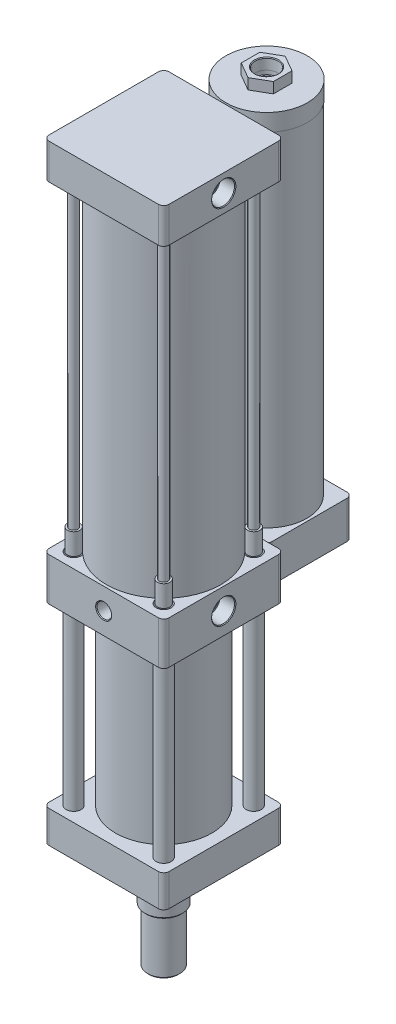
ISO-10303-21;
HEADER;
FILE_DESCRIPTION(('STEP AP214'),'2;1');
FILE_NAME('part.step','',(''),(''),'','','');
FILE_SCHEMA(('AUTOMOTIVE_DESIGN { 1 0 10303 214 1 1 1 1 }'));
ENDSEC;
DATA;
#1=APPLICATION_CONTEXT('core data for automotive mechanical design processes');
#2=APPLICATION_PROTOCOL_DEFINITION('international standard','automotive_design',2000,#1);
#3=PRODUCT_CONTEXT('',#1,'mechanical');
#4=PRODUCT('Part','Part','',(#3));
#5=PRODUCT_RELATED_PRODUCT_CATEGORY('part','',(#4));
#6=PRODUCT_DEFINITION_FORMATION('','',#4);
#7=PRODUCT_DEFINITION_CONTEXT('part definition',#1,'design');
#8=PRODUCT_DEFINITION('design','',#6,#7);
#9=PRODUCT_DEFINITION_SHAPE('','',#8);
#10=(LENGTH_UNIT() NAMED_UNIT(*) SI_UNIT(.MILLI.,.METRE.));
#11=(NAMED_UNIT(*) PLANE_ANGLE_UNIT() SI_UNIT($,.RADIAN.));
#12=(NAMED_UNIT(*) SI_UNIT($,.STERADIAN.) SOLID_ANGLE_UNIT());
#13=UNCERTAINTY_MEASURE_WITH_UNIT(LENGTH_MEASURE(1.E-05),#10,'distance_accuracy_value','');
#14=(GEOMETRIC_REPRESENTATION_CONTEXT(3) GLOBAL_UNCERTAINTY_ASSIGNED_CONTEXT((#13)) GLOBAL_UNIT_ASSIGNED_CONTEXT((#10,
#11,#12)) REPRESENTATION_CONTEXT('',''));
#15=CARTESIAN_POINT('',(0.,0.,0.));
#16=DIRECTION('',(0.,0.,1.));
#17=DIRECTION('',(1.,0.,0.));
#18=AXIS2_PLACEMENT_3D('',#15,#16,#17);
#19=CARTESIAN_POINT('',(15.,578.5,-104.660254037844));
#20=DIRECTION('',(-0.500000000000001,0.,0.866025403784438));
#21=DIRECTION('',(0.866025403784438,0.,0.500000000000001));
#22=AXIS2_PLACEMENT_3D('',#19,#20,#21);
#23=PLANE('',#22);
#24=DIRECTION('',(-0.866025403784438,0.,-0.500000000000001));
#25=VECTOR('',#24,1.);
#26=CARTESIAN_POINT('',(15.,568.5,-104.660254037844));
#27=LINE('',#26,#25);
#28=CARTESIAN_POINT('',(15.,568.5,-104.660254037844));
#29=VERTEX_POINT('',#28);
#30=CARTESIAN_POINT('',(0.,568.5,-113.320508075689));
#31=VERTEX_POINT('',#30);
#32=EDGE_CURVE('E130',#29,#31,#27,.T.);
#33=ORIENTED_EDGE('',*,*,#32,.T.);
#34=DIRECTION('',(0.,-1.,0.));
#35=VECTOR('',#34,1.);
#36=CARTESIAN_POINT('',(0.,578.5,-113.320508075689));
#37=LINE('',#36,#35);
#38=CARTESIAN_POINT('',(0.,578.5,-113.320508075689));
#39=VERTEX_POINT('',#38);
#40=EDGE_CURVE('E12',#39,#31,#37,.T.);
#41=ORIENTED_EDGE('',*,*,#40,.F.);
#42=DIRECTION('',(-0.866025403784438,0.,-0.500000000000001));
#43=VECTOR('',#42,1.);
#44=CARTESIAN_POINT('',(15.,578.5,-104.660254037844));
#45=LINE('',#44,#43);
#46=CARTESIAN_POINT('',(15.,578.5,-104.660254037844));
#47=VERTEX_POINT('',#46);
#48=EDGE_CURVE('E140',#47,#39,#45,.T.);
#49=ORIENTED_EDGE('',*,*,#48,.F.);
#50=DIRECTION('',(0.,-1.,0.));
#51=VECTOR('',#50,1.);
#52=CARTESIAN_POINT('',(15.,578.5,-104.660254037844));
#53=LINE('',#52,#51);
#54=EDGE_CURVE('E126',#47,#29,#53,.T.);
#55=ORIENTED_EDGE('',*,*,#54,.T.);
#56=EDGE_LOOP('',(#33,#41,#49,#55));
#57=FACE_BOUND('',#56,.T.);
#58=ADVANCED_FACE('F45',(#57),#23,.F.);
#59=CARTESIAN_POINT('',(0.,578.5,-113.320508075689));
#60=DIRECTION('',(0.5,0.,0.866025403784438));
#61=DIRECTION('',(0.866025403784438,0.,-0.5));
#62=AXIS2_PLACEMENT_3D('',#59,#60,#61);
#63=PLANE('',#62);
#64=DIRECTION('',(-0.866025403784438,0.,0.5));
#65=VECTOR('',#64,1.);
#66=CARTESIAN_POINT('',(0.,568.5,-113.320508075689));
#67=LINE('',#66,#65);
#68=CARTESIAN_POINT('',(-15.,568.5,-104.660254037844));
#69=VERTEX_POINT('',#68);
#70=EDGE_CURVE('E133',#31,#69,#67,.T.);
#71=ORIENTED_EDGE('',*,*,#70,.T.);
#72=DIRECTION('',(0.,-1.,0.));
#73=VECTOR('',#72,1.);
#74=CARTESIAN_POINT('',(-15.,578.5,-104.660254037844));
#75=LINE('',#74,#73);
#76=CARTESIAN_POINT('',(-15.,578.5,-104.660254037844));
#77=VERTEX_POINT('',#76);
#78=EDGE_CURVE('E54',#77,#69,#75,.T.);
#79=ORIENTED_EDGE('',*,*,#78,.F.);
#80=DIRECTION('',(-0.866025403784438,0.,0.5));
#81=VECTOR('',#80,1.);
#82=CARTESIAN_POINT('',(0.,578.5,-113.320508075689));
#83=LINE('',#82,#81);
#84=EDGE_CURVE('E99',#39,#77,#83,.T.);
#85=ORIENTED_EDGE('',*,*,#84,.F.);
#86=ORIENTED_EDGE('',*,*,#40,.T.);
#87=EDGE_LOOP('',(#71,#79,#85,#86));
#88=FACE_BOUND('',#87,.T.);
#89=ADVANCED_FACE('F167',(#88),#63,.F.);
#90=CARTESIAN_POINT('',(-15.,578.5,-104.660254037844));
#91=DIRECTION('',(1.,0.,0.));
#92=DIRECTION('',(0.,0.,-1.));
#93=AXIS2_PLACEMENT_3D('',#90,#91,#92);
#94=PLANE('',#93);
#95=DIRECTION('',(0.,0.,1.));
#96=VECTOR('',#95,1.);
#97=CARTESIAN_POINT('',(-15.,568.5,-104.660254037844));
#98=LINE('',#97,#96);
#99=CARTESIAN_POINT('',(-15.,568.5,-87.3397459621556));
#100=VERTEX_POINT('',#99);
#101=EDGE_CURVE('E135',#69,#100,#98,.T.);
#102=ORIENTED_EDGE('',*,*,#101,.T.);
#103=DIRECTION('',(0.,-1.,0.));
#104=VECTOR('',#103,1.);
#105=CARTESIAN_POINT('',(-15.,578.5,-87.3397459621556));
#106=LINE('',#105,#104);
#107=CARTESIAN_POINT('',(-15.,578.5,-87.3397459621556));
#108=VERTEX_POINT('',#107);
#109=EDGE_CURVE('E121',#108,#100,#106,.T.);
#110=ORIENTED_EDGE('',*,*,#109,.F.);
#111=DIRECTION('',(0.,0.,1.));
#112=VECTOR('',#111,1.);
#113=CARTESIAN_POINT('',(-15.,578.5,-104.660254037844));
#114=LINE('',#113,#112);
#115=EDGE_CURVE('E112',#77,#108,#114,.T.);
#116=ORIENTED_EDGE('',*,*,#115,.F.);
#117=ORIENTED_EDGE('',*,*,#78,.T.);
#118=EDGE_LOOP('',(#102,#110,#116,#117));
#119=FACE_BOUND('',#118,.T.);
#120=ADVANCED_FACE('F147',(#119),#94,.F.);
#121=CARTESIAN_POINT('',(-15.,578.5,-87.3397459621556));
#122=DIRECTION('',(0.5,0.,-0.866025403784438));
#123=DIRECTION('',(-0.866025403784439,0.,-0.5));
#124=AXIS2_PLACEMENT_3D('',#121,#122,#123);
#125=PLANE('',#124);
#126=DIRECTION('',(0.866025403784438,0.,0.5));
#127=VECTOR('',#126,1.);
#128=CARTESIAN_POINT('',(-15.,568.5,-87.3397459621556));
#129=LINE('',#128,#127);
#130=CARTESIAN_POINT('',(0.,568.5,-78.6794919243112));
#131=VERTEX_POINT('',#130);
#132=EDGE_CURVE('E120',#100,#131,#129,.T.);
#133=ORIENTED_EDGE('',*,*,#132,.T.);
#134=DIRECTION('',(0.,-1.,0.));
#135=VECTOR('',#134,1.);
#136=CARTESIAN_POINT('',(0.,578.5,-78.6794919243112));
#137=LINE('',#136,#135);
#138=CARTESIAN_POINT('',(0.,578.5,-78.6794919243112));
#139=VERTEX_POINT('',#138);
#140=EDGE_CURVE('E117',#139,#131,#137,.T.);
#141=ORIENTED_EDGE('',*,*,#140,.F.);
#142=DIRECTION('',(0.866025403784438,0.,0.5));
#143=VECTOR('',#142,1.);
#144=CARTESIAN_POINT('',(-15.,578.5,-87.3397459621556));
#145=LINE('',#144,#143);
#146=EDGE_CURVE('E106',#108,#139,#145,.T.);
#147=ORIENTED_EDGE('',*,*,#146,.F.);
#148=ORIENTED_EDGE('',*,*,#109,.T.);
#149=EDGE_LOOP('',(#133,#141,#147,#148));
#150=FACE_BOUND('',#149,.T.);
#151=ADVANCED_FACE('F118',(#150),#125,.F.);
#152=CARTESIAN_POINT('',(0.,578.5,-78.6794919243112));
#153=DIRECTION('',(-0.5,0.,-0.866025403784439));
#154=DIRECTION('',(-0.866025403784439,0.,0.5));
#155=AXIS2_PLACEMENT_3D('',#152,#153,#154);
#156=PLANE('',#155);
#157=DIRECTION('',(0.866025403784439,0.,-0.5));
#158=VECTOR('',#157,1.);
#159=CARTESIAN_POINT('',(0.,568.5,-78.6794919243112));
#160=LINE('',#159,#158);
#161=CARTESIAN_POINT('',(15.,568.5,-87.3397459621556));
#162=VERTEX_POINT('',#161);
#163=EDGE_CURVE('E85',#131,#162,#160,.T.);
#164=ORIENTED_EDGE('',*,*,#163,.T.);
#165=DIRECTION('',(0.,-1.,0.));
#166=VECTOR('',#165,1.);
#167=CARTESIAN_POINT('',(15.,578.5,-87.3397459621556));
#168=LINE('',#167,#166);
#169=CARTESIAN_POINT('',(15.,578.5,-87.3397459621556));
#170=VERTEX_POINT('',#169);
#171=EDGE_CURVE('E122',#170,#162,#168,.T.);
#172=ORIENTED_EDGE('',*,*,#171,.F.);
#173=DIRECTION('',(0.866025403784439,0.,-0.5));
#174=VECTOR('',#173,1.);
#175=CARTESIAN_POINT('',(0.,578.5,-78.6794919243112));
#176=LINE('',#175,#174);
#177=EDGE_CURVE('E110',#139,#170,#176,.T.);
#178=ORIENTED_EDGE('',*,*,#177,.F.);
#179=ORIENTED_EDGE('',*,*,#140,.T.);
#180=EDGE_LOOP('',(#164,#172,#178,#179));
#181=FACE_BOUND('',#180,.T.);
#182=ADVANCED_FACE('F124',(#181),#156,.F.);
#183=CARTESIAN_POINT('',(15.,578.5,-87.3397459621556));
#184=DIRECTION('',(-1.,0.,0.));
#185=DIRECTION('',(0.,0.,1.));
#186=AXIS2_PLACEMENT_3D('',#183,#184,#185);
#187=PLANE('',#186);
#188=DIRECTION('',(0.,0.,-1.));
#189=VECTOR('',#188,1.);
#190=CARTESIAN_POINT('',(15.,568.5,-87.3397459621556));
#191=LINE('',#190,#189);
#192=EDGE_CURVE('E91',#162,#29,#191,.T.);
#193=ORIENTED_EDGE('',*,*,#192,.T.);
#194=ORIENTED_EDGE('',*,*,#54,.F.);
#195=DIRECTION('',(0.,0.,-1.));
#196=VECTOR('',#195,1.);
#197=CARTESIAN_POINT('',(15.,578.5,-87.3397459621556));
#198=LINE('',#197,#196);
#199=EDGE_CURVE('E62',#170,#47,#198,.T.);
#200=ORIENTED_EDGE('',*,*,#199,.F.);
#201=ORIENTED_EDGE('',*,*,#171,.T.);
#202=EDGE_LOOP('',(#193,#194,#200,#201));
#203=FACE_BOUND('',#202,.T.);
#204=ADVANCED_FACE('F154',(#203),#187,.F.);
#205=CARTESIAN_POINT('',(0.,578.5,0.));
#206=DIRECTION('',(0.,1.,0.));
#207=DIRECTION('',(0.,0.,1.));
#208=AXIS2_PLACEMENT_3D('',#205,#206,#207);
#209=PLANE('',#208);
#210=CARTESIAN_POINT('',(0.,578.5,-96.));
#211=DIRECTION('',(0.,1.,0.));
#212=DIRECTION('',(0.,0.,1.));
#213=AXIS2_PLACEMENT_3D('',#210,#211,#212);
#214=CIRCLE('',#213,11.3029619);
#215=CARTESIAN_POINT('',(0.,578.5,-84.6970381));
#216=VERTEX_POINT('',#215);
#217=EDGE_CURVE('E228',#216,#216,#214,.T.);
#218=ORIENTED_EDGE('',*,*,#217,.F.);
#219=EDGE_LOOP('',(#218));
#220=FACE_BOUND('',#219,.T.);
#221=ORIENTED_EDGE('',*,*,#48,.T.);
#222=ORIENTED_EDGE('',*,*,#84,.T.);
#223=ORIENTED_EDGE('',*,*,#115,.T.);
#224=ORIENTED_EDGE('',*,*,#146,.T.);
#225=ORIENTED_EDGE('',*,*,#177,.T.);
#226=ORIENTED_EDGE('',*,*,#199,.T.);
#227=EDGE_LOOP('',(#221,#222,#223,#224,#225,#226));
#228=FACE_BOUND('',#227,.T.);
#229=ADVANCED_FACE('F108',(#220,#228),#209,.T.);
#230=CARTESIAN_POINT('',(0.,568.5,0.));
#231=DIRECTION('',(0.,1.,0.));
#232=DIRECTION('',(0.,0.,1.));
#233=AXIS2_PLACEMENT_3D('',#230,#231,#232);
#234=PLANE('',#233);
#235=CARTESIAN_POINT('',(0.,568.5,-96.));
#236=DIRECTION('',(0.,1.,0.));
#237=DIRECTION('',(0.,0.,1.));
#238=AXIS2_PLACEMENT_3D('',#235,#236,#237);
#239=CIRCLE('',#238,10.387561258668);
#240=CARTESIAN_POINT('',(0.,568.5,-85.6124387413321));
#241=VERTEX_POINT('',#240);
#242=EDGE_CURVE('E48',#241,#241,#239,.T.);
#243=ORIENTED_EDGE('',*,*,#242,.T.);
#244=EDGE_LOOP('',(#243));
#245=FACE_BOUND('',#244,.T.);
#246=ORIENTED_EDGE('',*,*,#32,.F.);
#247=ORIENTED_EDGE('',*,*,#192,.F.);
#248=ORIENTED_EDGE('',*,*,#163,.F.);
#249=ORIENTED_EDGE('',*,*,#132,.F.);
#250=ORIENTED_EDGE('',*,*,#101,.F.);
#251=ORIENTED_EDGE('',*,*,#70,.F.);
#252=EDGE_LOOP('',(#246,#247,#248,#249,#250,#251));
#253=FACE_BOUND('',#252,.T.);
#254=ADVANCED_FACE('F150',(#245,#253),#234,.F.);
#255=CARTESIAN_POINT('',(0.,577.865,-96.));
#256=DIRECTION('',(0.,1.,0.));
#257=DIRECTION('',(0.,0.,1.));
#258=AXIS2_PLACEMENT_3D('',#255,#256,#257);
#259=CONICAL_SURFACE('',#258,10.6679619,0.0299323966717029);
#260=CARTESIAN_POINT('',(0.,577.865,-96.));
#261=DIRECTION('',(0.,1.,0.));
#262=DIRECTION('',(0.,0.,1.));
#263=AXIS2_PLACEMENT_3D('',#260,#261,#262);
#264=CIRCLE('',#263,10.6679619);
#265=CARTESIAN_POINT('',(0.,577.865,-85.3320381));
#266=VERTEX_POINT('',#265);
#267=EDGE_CURVE('E225',#266,#266,#264,.T.);
#268=ORIENTED_EDGE('',*,*,#267,.T.);
#269=EDGE_LOOP('',(#268));
#270=FACE_BOUND('',#269,.T.);
#271=ORIENTED_EDGE('',*,*,#242,.F.);
#272=EDGE_LOOP('',(#271));
#273=FACE_BOUND('',#272,.T.);
#274=ADVANCED_FACE('F200',(#270,#273),#259,.F.);
#275=CARTESIAN_POINT('',(0.,578.5,-96.));
#276=DIRECTION('',(0.,1.,0.));
#277=DIRECTION('',(0.,0.,1.));
#278=AXIS2_PLACEMENT_3D('',#275,#276,#277);
#279=CONICAL_SURFACE('',#278,11.3029619,0.785398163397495);
#280=ORIENTED_EDGE('',*,*,#267,.F.);
#281=EDGE_LOOP('',(#280));
#282=FACE_BOUND('',#281,.T.);
#283=ORIENTED_EDGE('',*,*,#217,.T.);
#284=EDGE_LOOP('',(#283));
#285=FACE_BOUND('',#284,.T.);
#286=ADVANCED_FACE('F208',(#282,#285),#279,.F.);
#287=CLOSED_SHELL('',(#58,#89,#120,#151,#182,#204,#229,#254,#274,#286));
#288=MANIFOLD_SOLID_BREP('B2',#287);
#289=CARTESIAN_POINT('',(0.,568.5,-96.));
#290=DIRECTION('',(0.,-1.,0.));
#291=DIRECTION('',(0.,0.,-1.));
#292=AXIS2_PLACEMENT_3D('',#289,#290,#291);
#293=CYLINDRICAL_SURFACE('',#292,38.);
#294=CARTESIAN_POINT('',(0.,568.5,-96.));
#295=DIRECTION('',(0.,1.,0.));
#296=DIRECTION('',(0.,0.,1.));
#297=AXIS2_PLACEMENT_3D('',#294,#295,#296);
#298=CIRCLE('',#297,38.);
#299=CARTESIAN_POINT('',(0.,568.5,-58.));
#300=VERTEX_POINT('',#299);
#301=EDGE_CURVE('E44',#300,#300,#298,.T.);
#302=ORIENTED_EDGE('',*,*,#301,.F.);
#303=EDGE_LOOP('',(#302));
#304=FACE_BOUND('',#303,.T.);
#305=CARTESIAN_POINT('',(0.,552.5,-96.));
#306=DIRECTION('',(0.,1.,0.));
#307=DIRECTION('',(0.,0.,1.));
#308=AXIS2_PLACEMENT_3D('',#305,#306,#307);
#309=CIRCLE('',#308,38.);
#310=CARTESIAN_POINT('',(0.,552.5,-58.));
#311=VERTEX_POINT('',#310);
#312=EDGE_CURVE('E273',#311,#311,#309,.T.);
#313=ORIENTED_EDGE('',*,*,#312,.T.);
#314=EDGE_LOOP('',(#313));
#315=FACE_BOUND('',#314,.T.);
#316=ADVANCED_FACE('F266',(#304,#315),#293,.T.);
#317=CARTESIAN_POINT('',(0.,568.5,-96.));
#318=DIRECTION('',(0.,1.,0.));
#319=DIRECTION('',(0.,0.,1.));
#320=AXIS2_PLACEMENT_3D('',#317,#318,#319);
#321=PLANE('',#320);
#322=CARTESIAN_POINT('',(0.,568.5,-96.));
#323=DIRECTION('',(0.,1.,0.));
#324=DIRECTION('',(0.,0.,1.));
#325=AXIS2_PLACEMENT_3D('',#322,#323,#324);
#326=CIRCLE('',#325,10.387561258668);
#327=CARTESIAN_POINT('',(0.,568.5,-85.6124387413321));
#328=VERTEX_POINT('',#327);
#329=EDGE_CURVE('E269',#328,#328,#326,.T.);
#330=ORIENTED_EDGE('',*,*,#329,.F.);
#331=EDGE_LOOP('',(#330));
#332=FACE_BOUND('',#331,.T.);
#333=ORIENTED_EDGE('',*,*,#301,.T.);
#334=EDGE_LOOP('',(#333));
#335=FACE_BOUND('',#334,.T.);
#336=ADVANCED_FACE('F312',(#332,#335),#321,.T.);
#337=CARTESIAN_POINT('',(0.,552.5,-96.));
#338=DIRECTION('',(0.,1.,0.));
#339=DIRECTION('',(0.,0.,1.));
#340=AXIS2_PLACEMENT_3D('',#337,#338,#339);
#341=PLANE('',#340);
#342=CARTESIAN_POINT('',(0.,552.5,-96.));
#343=DIRECTION('',(0.,1.,0.));
#344=DIRECTION('',(0.,0.,1.));
#345=AXIS2_PLACEMENT_3D('',#342,#343,#344);
#346=CIRCLE('',#345,3.33612093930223);
#347=CARTESIAN_POINT('',(0.,552.5,-92.6638790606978));
#348=VERTEX_POINT('',#347);
#349=EDGE_CURVE('E282',#348,#348,#346,.T.);
#350=ORIENTED_EDGE('',*,*,#349,.T.);
#351=EDGE_LOOP('',(#350));
#352=FACE_BOUND('',#351,.T.);
#353=ORIENTED_EDGE('',*,*,#312,.F.);
#354=EDGE_LOOP('',(#353));
#355=FACE_BOUND('',#354,.T.);
#356=ADVANCED_FACE('F318',(#352,#355),#341,.F.);
#357=CARTESIAN_POINT('',(0.,555.86,-96.));
#358=DIRECTION('',(0.,1.,0.));
#359=DIRECTION('',(0.,0.,1.));
#360=AXIS2_PLACEMENT_3D('',#357,#358,#359);
#361=CONICAL_SURFACE('',#360,8.9281,1.02974425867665);
#362=CARTESIAN_POINT('',(0.,555.86,-96.));
#363=DIRECTION('',(0.,1.,0.));
#364=DIRECTION('',(0.,0.,1.));
#365=AXIS2_PLACEMENT_3D('',#362,#363,#364);
#366=CIRCLE('',#365,8.9281);
#367=CARTESIAN_POINT('',(0.,555.86,-87.0719));
#368=VERTEX_POINT('',#367);
#369=EDGE_CURVE('E280',#368,#368,#366,.T.);
#370=ORIENTED_EDGE('',*,*,#369,.T.);
#371=EDGE_LOOP('',(#370));
#372=FACE_BOUND('',#371,.T.);
#373=ORIENTED_EDGE('',*,*,#349,.F.);
#374=EDGE_LOOP('',(#373));
#375=FACE_BOUND('',#374,.T.);
#376=ADVANCED_FACE('F325',(#372,#375),#361,.F.);
#377=CARTESIAN_POINT('',(0.,578.5,-96.));
#378=DIRECTION('',(0.,1.,0.));
#379=DIRECTION('',(0.,0.,1.));
#380=AXIS2_PLACEMENT_3D('',#377,#378,#379);
#381=CYLINDRICAL_SURFACE('',#380,8.92810000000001);
#382=ORIENTED_EDGE('',*,*,#369,.F.);
#383=EDGE_LOOP('',(#382));
#384=FACE_BOUND('',#383,.T.);
#385=CARTESIAN_POINT('',(0.,564.93,-96.));
#386=DIRECTION('',(0.,1.,0.));
#387=DIRECTION('',(0.,0.,1.));
#388=AXIS2_PLACEMENT_3D('',#385,#386,#387);
#389=CIRCLE('',#388,8.92810000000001);
#390=CARTESIAN_POINT('',(0.,564.93,-87.0719));
#391=VERTEX_POINT('',#390);
#392=EDGE_CURVE('E288',#391,#391,#389,.T.);
#393=ORIENTED_EDGE('',*,*,#392,.T.);
#394=EDGE_LOOP('',(#393));
#395=FACE_BOUND('',#394,.T.);
#396=ADVANCED_FACE('F308',(#384,#395),#381,.F.);
#397=CARTESIAN_POINT('',(8.92809999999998,564.93,-96.));
#398=DIRECTION('',(0.,-1.,0.));
#399=DIRECTION('',(0.,0.,-1.));
#400=AXIS2_PLACEMENT_3D('',#397,#398,#399);
#401=PLANE('',#400);
#402=ORIENTED_EDGE('',*,*,#392,.F.);
#403=EDGE_LOOP('',(#402));
#404=FACE_BOUND('',#403,.T.);
#405=CARTESIAN_POINT('',(0.,564.93,-96.));
#406=DIRECTION('',(0.,1.,0.));
#407=DIRECTION('',(0.,0.,1.));
#408=AXIS2_PLACEMENT_3D('',#405,#406,#407);
#409=CIRCLE('',#408,10.2806706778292);
#410=CARTESIAN_POINT('',(0.,564.93,-85.7193293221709));
#411=VERTEX_POINT('',#410);
#412=EDGE_CURVE('E292',#411,#411,#409,.T.);
#413=ORIENTED_EDGE('',*,*,#412,.T.);
#414=EDGE_LOOP('',(#413));
#415=FACE_BOUND('',#414,.T.);
#416=ADVANCED_FACE('F299',(#404,#415),#401,.F.);
#417=CARTESIAN_POINT('',(0.,577.865,-96.));
#418=DIRECTION('',(0.,1.,0.));
#419=DIRECTION('',(0.,0.,1.));
#420=AXIS2_PLACEMENT_3D('',#417,#418,#419);
#421=CONICAL_SURFACE('',#420,10.6679619,0.0299323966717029);
#422=ORIENTED_EDGE('',*,*,#329,.T.);
#423=EDGE_LOOP('',(#422));
#424=FACE_BOUND('',#423,.T.);
#425=ORIENTED_EDGE('',*,*,#412,.F.);
#426=EDGE_LOOP('',(#425));
#427=FACE_BOUND('',#426,.T.);
#428=ADVANCED_FACE('F301',(#424,#427),#421,.F.);
#429=CLOSED_SHELL('',(#316,#336,#356,#376,#396,#416,#428));
#430=MANIFOLD_SOLID_BREP('B6',#429);
#431=CARTESIAN_POINT('',(0.,552.5,-96.));
#432=DIRECTION('',(0.,-1.,0.));
#433=DIRECTION('',(0.,0.,-1.));
#434=AXIS2_PLACEMENT_3D('',#431,#432,#433);
#435=CYLINDRICAL_SURFACE('',#434,37.5);
#436=CARTESIAN_POINT('',(0.,552.5,-96.));
#437=DIRECTION('',(0.,1.,0.));
#438=DIRECTION('',(0.,0.,1.));
#439=AXIS2_PLACEMENT_3D('',#436,#437,#438);
#440=CIRCLE('',#439,37.5);
#441=CARTESIAN_POINT('',(0.,552.5,-58.5));
#442=VERTEX_POINT('',#441);
#443=EDGE_CURVE('E264',#442,#442,#440,.T.);
#444=ORIENTED_EDGE('',*,*,#443,.F.);
#445=EDGE_LOOP('',(#444));
#446=FACE_BOUND('',#445,.T.);
#447=CARTESIAN_POINT('',(0.,232.5,-96.));
#448=DIRECTION('',(0.,1.,0.));
#449=DIRECTION('',(0.,0.,1.));
#450=AXIS2_PLACEMENT_3D('',#447,#448,#449);
#451=CIRCLE('',#450,37.5);
#452=CARTESIAN_POINT('',(0.,232.5,-58.5));
#453=VERTEX_POINT('',#452);
#454=EDGE_CURVE('E389',#453,#453,#451,.T.);
#455=ORIENTED_EDGE('',*,*,#454,.T.);
#456=EDGE_LOOP('',(#455));
#457=FACE_BOUND('',#456,.T.);
#458=ADVANCED_FACE('F382',(#446,#457),#435,.T.);
#459=CARTESIAN_POINT('',(0.,552.5,-96.));
#460=DIRECTION('',(0.,1.,0.));
#461=DIRECTION('',(0.,0.,1.));
#462=AXIS2_PLACEMENT_3D('',#459,#460,#461);
#463=PLANE('',#462);
#464=CARTESIAN_POINT('',(0.,552.5,-96.));
#465=DIRECTION('',(0.,1.,0.));
#466=DIRECTION('',(0.,0.,1.));
#467=AXIS2_PLACEMENT_3D('',#464,#465,#466);
#468=CIRCLE('',#467,3.33612093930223);
#469=CARTESIAN_POINT('',(0.,552.5,-92.6638790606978));
#470=VERTEX_POINT('',#469);
#471=EDGE_CURVE('E385',#470,#470,#468,.T.);
#472=ORIENTED_EDGE('',*,*,#471,.F.);
#473=EDGE_LOOP('',(#472));
#474=FACE_BOUND('',#473,.T.);
#475=ORIENTED_EDGE('',*,*,#443,.T.);
#476=EDGE_LOOP('',(#475));
#477=FACE_BOUND('',#476,.T.);
#478=ADVANCED_FACE('F401',(#474,#477),#463,.T.);
#479=CARTESIAN_POINT('',(0.,232.5,-96.));
#480=DIRECTION('',(0.,1.,0.));
#481=DIRECTION('',(0.,0.,1.));
#482=AXIS2_PLACEMENT_3D('',#479,#480,#481);
#483=PLANE('',#482);
#484=ORIENTED_EDGE('',*,*,#454,.F.);
#485=EDGE_LOOP('',(#484));
#486=FACE_BOUND('',#485,.T.);
#487=ADVANCED_FACE('F395',(#486),#483,.F.);
#488=CARTESIAN_POINT('',(0.,555.86,-96.));
#489=DIRECTION('',(0.,1.,0.));
#490=DIRECTION('',(0.,0.,1.));
#491=AXIS2_PLACEMENT_3D('',#488,#489,#490);
#492=CONICAL_SURFACE('',#491,8.9281,1.02974425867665);
#493=ORIENTED_EDGE('',*,*,#471,.T.);
#494=EDGE_LOOP('',(#493));
#495=FACE_BOUND('',#494,.T.);
#496=CARTESIAN_POINT('',(0.,550.49545630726,-96.));
#497=VERTEX_POINT('',#496);
#498=VERTEX_LOOP('',#497);
#499=FACE_BOUND('',#498,.T.);
#500=ADVANCED_FACE('F393',(#495,#499),#492,.F.);
#501=CLOSED_SHELL('',(#458,#478,#487,#500));
#502=MANIFOLD_SOLID_BREP('B39',#501);
#503=CARTESIAN_POINT('',(35.,232.5,-61.));
#504=DIRECTION('',(0.,-1.,0.));
#505=DIRECTION('',(0.,0.,-1.));
#506=AXIS2_PLACEMENT_3D('',#503,#504,#505);
#507=CYLINDRICAL_SURFACE('',#506,5.);
#508=CARTESIAN_POINT('',(35.,197.5,-61.));
#509=DIRECTION('',(0.,-1.,0.));
#510=DIRECTION('',(0.,0.,-1.));
#511=AXIS2_PLACEMENT_3D('',#508,#509,#510);
#512=CIRCLE('',#511,5.);
#513=CARTESIAN_POINT('',(40.,197.5,-61.));
#514=VERTEX_POINT('',#513);
#515=CARTESIAN_POINT('',(35.,197.5,-56.));
#516=VERTEX_POINT('',#515);
#517=EDGE_CURVE('E544',#514,#516,#512,.T.);
#518=ORIENTED_EDGE('',*,*,#517,.F.);
#519=DIRECTION('',(0.,-1.,0.));
#520=VECTOR('',#519,1.);
#521=CARTESIAN_POINT('',(40.,232.5,-61.));
#522=LINE('',#521,#520);
#523=CARTESIAN_POINT('',(40.,232.5,-61.));
#524=VERTEX_POINT('',#523);
#525=EDGE_CURVE('E380',#524,#514,#522,.T.);
#526=ORIENTED_EDGE('',*,*,#525,.F.);
#527=CARTESIAN_POINT('',(35.,232.5,-61.));
#528=DIRECTION('',(0.,-1.,0.));
#529=DIRECTION('',(0.,0.,-1.));
#530=AXIS2_PLACEMENT_3D('',#527,#528,#529);
#531=CIRCLE('',#530,5.);
#532=CARTESIAN_POINT('',(35.,232.5,-56.));
#533=VERTEX_POINT('',#532);
#534=EDGE_CURVE('E564',#524,#533,#531,.T.);
#535=ORIENTED_EDGE('',*,*,#534,.T.);
#536=DIRECTION('',(0.,-1.,0.));
#537=VECTOR('',#536,1.);
#538=CARTESIAN_POINT('',(35.,232.5,-56.));
#539=LINE('',#538,#537);
#540=EDGE_CURVE('E450',#533,#516,#539,.T.);
#541=ORIENTED_EDGE('',*,*,#540,.T.);
#542=EDGE_LOOP('',(#518,#526,#535,#541));
#543=FACE_BOUND('',#542,.T.);
#544=ADVANCED_FACE('F447',(#543),#507,.T.);
#545=CARTESIAN_POINT('',(40.,232.5,-131.));
#546=DIRECTION('',(1.,0.,0.));
#547=DIRECTION('',(0.,0.,-1.));
#548=AXIS2_PLACEMENT_3D('',#545,#546,#547);
#549=PLANE('',#548);
#550=DIRECTION('',(0.,0.,1.));
#551=VECTOR('',#550,1.);
#552=CARTESIAN_POINT('',(40.,197.5,-131.));
#553=LINE('',#552,#551);
#554=CARTESIAN_POINT('',(40.,197.5,-131.));
#555=VERTEX_POINT('',#554);
#556=EDGE_CURVE('E562',#555,#514,#553,.T.);
#557=ORIENTED_EDGE('',*,*,#556,.F.);
#558=DIRECTION('',(0.,-1.,0.));
#559=VECTOR('',#558,1.);
#560=CARTESIAN_POINT('',(40.,232.5,-131.));
#561=LINE('',#560,#559);
#562=CARTESIAN_POINT('',(40.,232.5,-131.));
#563=VERTEX_POINT('',#562);
#564=EDGE_CURVE('E456',#563,#555,#561,.T.);
#565=ORIENTED_EDGE('',*,*,#564,.F.);
#566=DIRECTION('',(0.,0.,1.));
#567=VECTOR('',#566,1.);
#568=CARTESIAN_POINT('',(40.,232.5,-131.));
#569=LINE('',#568,#567);
#570=EDGE_CURVE('E534',#563,#524,#569,.T.);
#571=ORIENTED_EDGE('',*,*,#570,.T.);
#572=ORIENTED_EDGE('',*,*,#525,.T.);
#573=EDGE_LOOP('',(#557,#565,#571,#572));
#574=FACE_BOUND('',#573,.T.);
#575=ADVANCED_FACE('F576',(#574),#549,.T.);
#576=CARTESIAN_POINT('',(35.,232.5,-131.));
#577=DIRECTION('',(0.,-1.,0.));
#578=DIRECTION('',(0.,0.,-1.));
#579=AXIS2_PLACEMENT_3D('',#576,#577,#578);
#580=CYLINDRICAL_SURFACE('',#579,5.);
#581=CARTESIAN_POINT('',(35.,197.5,-131.));
#582=DIRECTION('',(0.,-1.,0.));
#583=DIRECTION('',(0.,0.,-1.));
#584=AXIS2_PLACEMENT_3D('',#581,#582,#583);
#585=CIRCLE('',#584,5.);
#586=CARTESIAN_POINT('',(35.,197.5,-136.));
#587=VERTEX_POINT('',#586);
#588=EDGE_CURVE('E521',#587,#555,#585,.T.);
#589=ORIENTED_EDGE('',*,*,#588,.F.);
#590=DIRECTION('',(0.,-1.,0.));
#591=VECTOR('',#590,1.);
#592=CARTESIAN_POINT('',(35.,232.5,-136.));
#593=LINE('',#592,#591);
#594=CARTESIAN_POINT('',(35.,232.5,-136.));
#595=VERTEX_POINT('',#594);
#596=EDGE_CURVE('E516',#595,#587,#593,.T.);
#597=ORIENTED_EDGE('',*,*,#596,.F.);
#598=CARTESIAN_POINT('',(35.,232.5,-131.));
#599=DIRECTION('',(0.,-1.,0.));
#600=DIRECTION('',(0.,0.,-1.));
#601=AXIS2_PLACEMENT_3D('',#598,#599,#600);
#602=CIRCLE('',#601,5.);
#603=EDGE_CURVE('E519',#595,#563,#602,.T.);
#604=ORIENTED_EDGE('',*,*,#603,.T.);
#605=ORIENTED_EDGE('',*,*,#564,.T.);
#606=EDGE_LOOP('',(#589,#597,#604,#605));
#607=FACE_BOUND('',#606,.T.);
#608=ADVANCED_FACE('F518',(#607),#580,.T.);
#609=CARTESIAN_POINT('',(-35.,232.5,-136.));
#610=DIRECTION('',(0.,0.,-1.));
#611=DIRECTION('',(-1.,0.,0.));
#612=AXIS2_PLACEMENT_3D('',#609,#610,#611);
#613=PLANE('',#612);
#614=DIRECTION('',(1.,0.,0.));
#615=VECTOR('',#614,1.);
#616=CARTESIAN_POINT('',(-35.,197.5,-136.));
#617=LINE('',#616,#615);
#618=CARTESIAN_POINT('',(-35.,197.5,-136.));
#619=VERTEX_POINT('',#618);
#620=EDGE_CURVE('E559',#619,#587,#617,.T.);
#621=ORIENTED_EDGE('',*,*,#620,.F.);
#622=DIRECTION('',(0.,-1.,0.));
#623=VECTOR('',#622,1.);
#624=CARTESIAN_POINT('',(-35.,232.5,-136.));
#625=LINE('',#624,#623);
#626=CARTESIAN_POINT('',(-35.,232.5,-136.));
#627=VERTEX_POINT('',#626);
#628=EDGE_CURVE('E526',#627,#619,#625,.T.);
#629=ORIENTED_EDGE('',*,*,#628,.F.);
#630=DIRECTION('',(1.,0.,0.));
#631=VECTOR('',#630,1.);
#632=CARTESIAN_POINT('',(-35.,232.5,-136.));
#633=LINE('',#632,#631);
#634=EDGE_CURVE('E532',#627,#595,#633,.T.);
#635=ORIENTED_EDGE('',*,*,#634,.T.);
#636=ORIENTED_EDGE('',*,*,#596,.T.);
#637=EDGE_LOOP('',(#621,#629,#635,#636));
#638=FACE_BOUND('',#637,.T.);
#639=ADVANCED_FACE('F536',(#638),#613,.T.);
#640=CARTESIAN_POINT('',(-35.,232.5,-131.));
#641=DIRECTION('',(0.,-1.,0.));
#642=DIRECTION('',(0.,0.,-1.));
#643=AXIS2_PLACEMENT_3D('',#640,#641,#642);
#644=CYLINDRICAL_SURFACE('',#643,5.);
#645=CARTESIAN_POINT('',(-35.,197.5,-131.));
#646=DIRECTION('',(0.,-1.,0.));
#647=DIRECTION('',(0.,0.,1.));
#648=AXIS2_PLACEMENT_3D('',#645,#646,#647);
#649=CIRCLE('',#648,5.);
#650=CARTESIAN_POINT('',(-40.,197.5,-131.));
#651=VERTEX_POINT('',#650);
#652=EDGE_CURVE('E556',#651,#619,#649,.T.);
#653=ORIENTED_EDGE('',*,*,#652,.F.);
#654=DIRECTION('',(0.,-1.,0.));
#655=VECTOR('',#654,1.);
#656=CARTESIAN_POINT('',(-40.,232.5,-131.));
#657=LINE('',#656,#655);
#658=CARTESIAN_POINT('',(-40.,232.5,-131.));
#659=VERTEX_POINT('',#658);
#660=EDGE_CURVE('E568',#659,#651,#657,.T.);
#661=ORIENTED_EDGE('',*,*,#660,.F.);
#662=CARTESIAN_POINT('',(-35.,232.5,-131.));
#663=DIRECTION('',(0.,-1.,0.));
#664=DIRECTION('',(0.,0.,1.));
#665=AXIS2_PLACEMENT_3D('',#662,#663,#664);
#666=CIRCLE('',#665,5.);
#667=EDGE_CURVE('E537',#659,#627,#666,.T.);
#668=ORIENTED_EDGE('',*,*,#667,.T.);
#669=ORIENTED_EDGE('',*,*,#628,.T.);
#670=EDGE_LOOP('',(#653,#661,#668,#669));
#671=FACE_BOUND('',#670,.T.);
#672=ADVANCED_FACE('F589',(#671),#644,.T.);
#673=CARTESIAN_POINT('',(-40.,232.5,-131.));
#674=DIRECTION('',(-1.,0.,0.));
#675=DIRECTION('',(0.,0.,1.));
#676=AXIS2_PLACEMENT_3D('',#673,#674,#675);
#677=PLANE('',#676);
#678=DIRECTION('',(0.,0.,-1.));
#679=VECTOR('',#678,1.);
#680=CARTESIAN_POINT('',(-40.,197.5,-131.));
#681=LINE('',#680,#679);
#682=CARTESIAN_POINT('',(-40.,197.5,-61.));
#683=VERTEX_POINT('',#682);
#684=EDGE_CURVE('E553',#683,#651,#681,.T.);
#685=ORIENTED_EDGE('',*,*,#684,.F.);
#686=DIRECTION('',(0.,-1.,0.));
#687=VECTOR('',#686,1.);
#688=CARTESIAN_POINT('',(-40.,232.5,-61.));
#689=LINE('',#688,#687);
#690=CARTESIAN_POINT('',(-40.,232.5,-61.));
#691=VERTEX_POINT('',#690);
#692=EDGE_CURVE('E570',#691,#683,#689,.T.);
#693=ORIENTED_EDGE('',*,*,#692,.F.);
#694=DIRECTION('',(0.,0.,-1.));
#695=VECTOR('',#694,1.);
#696=CARTESIAN_POINT('',(-40.,232.5,-131.));
#697=LINE('',#696,#695);
#698=EDGE_CURVE('E539',#691,#659,#697,.T.);
#699=ORIENTED_EDGE('',*,*,#698,.T.);
#700=ORIENTED_EDGE('',*,*,#660,.T.);
#701=EDGE_LOOP('',(#685,#693,#699,#700));
#702=FACE_BOUND('',#701,.T.);
#703=ADVANCED_FACE('F592',(#702),#677,.T.);
#704=CARTESIAN_POINT('',(-35.,232.5,-61.));
#705=DIRECTION('',(0.,-1.,0.));
#706=DIRECTION('',(0.,0.,-1.));
#707=AXIS2_PLACEMENT_3D('',#704,#705,#706);
#708=CYLINDRICAL_SURFACE('',#707,5.);
#709=CARTESIAN_POINT('',(-35.,197.5,-61.));
#710=DIRECTION('',(0.,-1.,0.));
#711=DIRECTION('',(0.,0.,-1.));
#712=AXIS2_PLACEMENT_3D('',#709,#710,#711);
#713=CIRCLE('',#712,5.);
#714=CARTESIAN_POINT('',(-35.,197.5,-56.));
#715=VERTEX_POINT('',#714);
#716=EDGE_CURVE('E550',#715,#683,#713,.T.);
#717=ORIENTED_EDGE('',*,*,#716,.F.);
#718=DIRECTION('',(0.,-1.,0.));
#719=VECTOR('',#718,1.);
#720=CARTESIAN_POINT('',(-35.,232.5,-56.));
#721=LINE('',#720,#719);
#722=CARTESIAN_POINT('',(-35.,232.5,-56.));
#723=VERTEX_POINT('',#722);
#724=EDGE_CURVE('E571',#723,#715,#721,.T.);
#725=ORIENTED_EDGE('',*,*,#724,.F.);
#726=CARTESIAN_POINT('',(-35.,232.5,-61.));
#727=DIRECTION('',(0.,-1.,0.));
#728=DIRECTION('',(0.,0.,-1.));
#729=AXIS2_PLACEMENT_3D('',#726,#727,#728);
#730=CIRCLE('',#729,5.);
#731=EDGE_CURVE('E667',#723,#691,#730,.T.);
#732=ORIENTED_EDGE('',*,*,#731,.T.);
#733=ORIENTED_EDGE('',*,*,#692,.T.);
#734=EDGE_LOOP('',(#717,#725,#732,#733));
#735=FACE_BOUND('',#734,.T.);
#736=ADVANCED_FACE('F596',(#735),#708,.T.);
#737=CARTESIAN_POINT('',(-35.,232.5,-56.));
#738=DIRECTION('',(0.,0.,1.));
#739=DIRECTION('',(1.,0.,0.));
#740=AXIS2_PLACEMENT_3D('',#737,#738,#739);
#741=PLANE('',#740);
#742=DIRECTION('',(-1.,0.,0.));
#743=VECTOR('',#742,1.);
#744=CARTESIAN_POINT('',(-35.,197.5,-56.));
#745=LINE('',#744,#743);
#746=EDGE_CURVE('E547',#516,#715,#745,.T.);
#747=ORIENTED_EDGE('',*,*,#746,.F.);
#748=ORIENTED_EDGE('',*,*,#540,.F.);
#749=DIRECTION('',(-1.,0.,0.));
#750=VECTOR('',#749,1.);
#751=CARTESIAN_POINT('',(-35.,232.5,-56.));
#752=LINE('',#751,#750);
#753=EDGE_CURVE('E668',#533,#723,#752,.T.);
#754=ORIENTED_EDGE('',*,*,#753,.T.);
#755=ORIENTED_EDGE('',*,*,#724,.T.);
#756=EDGE_LOOP('',(#747,#748,#754,#755));
#757=FACE_BOUND('',#756,.T.);
#758=ADVANCED_FACE('F573',(#757),#741,.T.);
#759=CARTESIAN_POINT('',(35.,232.5,-61.));
#760=DIRECTION('',(0.,-1.,0.));
#761=DIRECTION('',(0.,0.,-1.));
#762=AXIS2_PLACEMENT_3D('',#759,#760,#761);
#763=PLANE('',#762);
#764=ORIENTED_EDGE('',*,*,#534,.F.);
#765=ORIENTED_EDGE('',*,*,#570,.F.);
#766=ORIENTED_EDGE('',*,*,#603,.F.);
#767=ORIENTED_EDGE('',*,*,#634,.F.);
#768=ORIENTED_EDGE('',*,*,#667,.F.);
#769=ORIENTED_EDGE('',*,*,#698,.F.);
#770=ORIENTED_EDGE('',*,*,#731,.F.);
#771=ORIENTED_EDGE('',*,*,#753,.F.);
#772=EDGE_LOOP('',(#764,#765,#766,#767,#768,#769,#770,#771));
#773=FACE_BOUND('',#772,.T.);
#774=ADVANCED_FACE('F530',(#773),#763,.F.);
#775=CARTESIAN_POINT('',(35.,197.5,-61.));
#776=DIRECTION('',(0.,-1.,0.));
#777=DIRECTION('',(0.,0.,-1.));
#778=AXIS2_PLACEMENT_3D('',#775,#776,#777);
#779=PLANE('',#778);
#780=ORIENTED_EDGE('',*,*,#517,.T.);
#781=ORIENTED_EDGE('',*,*,#746,.T.);
#782=ORIENTED_EDGE('',*,*,#716,.T.);
#783=ORIENTED_EDGE('',*,*,#684,.T.);
#784=ORIENTED_EDGE('',*,*,#652,.T.);
#785=ORIENTED_EDGE('',*,*,#620,.T.);
#786=ORIENTED_EDGE('',*,*,#588,.T.);
#787=ORIENTED_EDGE('',*,*,#556,.T.);
#788=EDGE_LOOP('',(#780,#781,#782,#783,#784,#785,#786,#787));
#789=FACE_BOUND('',#788,.T.);
#790=ADVANCED_FACE('F575',(#789),#779,.T.);
#791=CLOSED_SHELL('',(#544,#575,#608,#639,#672,#703,#736,#758,#774,#790));
#792=MANIFOLD_SOLID_BREP('B258',#791);
#793=CARTESIAN_POINT('',(51.,195.,51.));
#794=DIRECTION('',(0.,1.,0.));
#795=DIRECTION('',(0.,0.,1.));
#796=AXIS2_PLACEMENT_3D('',#793,#794,#795);
#797=PLANE('',#796);
#798=CARTESIAN_POINT('',(42.0000000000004,195.,-41.9999999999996));
#799=DIRECTION('',(0.,1.,0.));
#800=DIRECTION('',(0.,0.,1.));
#801=AXIS2_PLACEMENT_3D('',#798,#799,#800);
#802=CIRCLE('',#801,7.);
#803=CARTESIAN_POINT('',(42.0000000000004,195.,-34.9999999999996));
#804=VERTEX_POINT('',#803);
#805=EDGE_CURVE('E446',#804,#804,#802,.F.);
#806=ORIENTED_EDGE('',*,*,#805,.F.);
#807=EDGE_LOOP('',(#806));
#808=FACE_BOUND('',#807,.T.);
#809=ADVANCED_FACE('F682',(#808),#797,.T.);
#810=CARTESIAN_POINT('',(42.0000000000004,0.,-41.9999999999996));
#811=DIRECTION('',(0.,-1.,0.));
#812=DIRECTION('',(0.,0.,-1.));
#813=AXIS2_PLACEMENT_3D('',#810,#811,#812);
#814=PLANE('',#813);
#815=CARTESIAN_POINT('',(42.0000000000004,0.,-41.9999999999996));
#816=DIRECTION('',(0.,-1.,0.));
#817=DIRECTION('',(0.,0.,-1.));
#818=AXIS2_PLACEMENT_3D('',#815,#816,#817);
#819=CIRCLE('',#818,7.);
#820=CARTESIAN_POINT('',(42.0000000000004,0.,-48.9999999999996));
#821=VERTEX_POINT('',#820);
#822=EDGE_CURVE('E688',#821,#821,#819,.T.);
#823=ORIENTED_EDGE('',*,*,#822,.T.);
#824=EDGE_LOOP('',(#823));
#825=FACE_BOUND('',#824,.T.);
#826=ADVANCED_FACE('F694',(#825),#814,.T.);
#827=CARTESIAN_POINT('',(42.0000000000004,214.798989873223,-41.9999999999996));
#828=DIRECTION('',(0.,-1.,0.));
#829=DIRECTION('',(0.,0.,-1.));
#830=AXIS2_PLACEMENT_3D('',#827,#828,#829);
#831=CYLINDRICAL_SURFACE('',#830,7.);
#832=ORIENTED_EDGE('',*,*,#822,.F.);
#833=EDGE_LOOP('',(#832));
#834=FACE_BOUND('',#833,.T.);
#835=ORIENTED_EDGE('',*,*,#805,.T.);
#836=EDGE_LOOP('',(#835));
#837=FACE_BOUND('',#836,.T.);
#838=ADVANCED_FACE('F696',(#834,#837),#831,.T.);
#839=CLOSED_SHELL('',(#809,#826,#838));
#840=MANIFOLD_SOLID_BREP('B374',#839);
#841=CARTESIAN_POINT('',(51.,195.,51.));
#842=DIRECTION('',(0.,1.,0.));
#843=DIRECTION('',(0.,0.,1.));
#844=AXIS2_PLACEMENT_3D('',#841,#842,#843);
#845=PLANE('',#844);
#846=CARTESIAN_POINT('',(-41.9999999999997,195.,-42.0000000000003));
#847=DIRECTION('',(0.,1.,0.));
#848=DIRECTION('',(0.,0.,1.));
#849=AXIS2_PLACEMENT_3D('',#846,#847,#848);
#850=CIRCLE('',#849,7.);
#851=CARTESIAN_POINT('',(-41.9999999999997,195.,-35.0000000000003));
#852=VERTEX_POINT('',#851);
#853=EDGE_CURVE('E681',#852,#852,#850,.F.);
#854=ORIENTED_EDGE('',*,*,#853,.F.);
#855=EDGE_LOOP('',(#854));
#856=FACE_BOUND('',#855,.T.);
#857=ADVANCED_FACE('F730',(#856),#845,.T.);
#858=CARTESIAN_POINT('',(-41.9999999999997,0.,-42.0000000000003));
#859=DIRECTION('',(0.,-1.,0.));
#860=DIRECTION('',(0.,0.,-1.));
#861=AXIS2_PLACEMENT_3D('',#858,#859,#860);
#862=PLANE('',#861);
#863=CARTESIAN_POINT('',(-41.9999999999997,0.,-42.0000000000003));
#864=DIRECTION('',(0.,-1.,0.));
#865=DIRECTION('',(0.,0.,-1.));
#866=AXIS2_PLACEMENT_3D('',#863,#864,#865);
#867=CIRCLE('',#866,7.);
#868=CARTESIAN_POINT('',(-41.9999999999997,0.,-49.0000000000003));
#869=VERTEX_POINT('',#868);
#870=EDGE_CURVE('E736',#869,#869,#867,.T.);
#871=ORIENTED_EDGE('',*,*,#870,.T.);
#872=EDGE_LOOP('',(#871));
#873=FACE_BOUND('',#872,.T.);
#874=ADVANCED_FACE('F742',(#873),#862,.T.);
#875=CARTESIAN_POINT('',(-41.9999999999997,214.798989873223,-42.0000000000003));
#876=DIRECTION('',(0.,-1.,0.));
#877=DIRECTION('',(0.,0.,-1.));
#878=AXIS2_PLACEMENT_3D('',#875,#876,#877);
#879=CYLINDRICAL_SURFACE('',#878,7.);
#880=ORIENTED_EDGE('',*,*,#870,.F.);
#881=EDGE_LOOP('',(#880));
#882=FACE_BOUND('',#881,.T.);
#883=ORIENTED_EDGE('',*,*,#853,.T.);
#884=EDGE_LOOP('',(#883));
#885=FACE_BOUND('',#884,.T.);
#886=ADVANCED_FACE('F744',(#882,#885),#879,.T.);
#887=CLOSED_SHELL('',(#857,#874,#886));
#888=MANIFOLD_SOLID_BREP('B441',#887);
#889=CARTESIAN_POINT('',(51.,195.,51.));
#890=DIRECTION('',(0.,1.,0.));
#891=DIRECTION('',(0.,0.,1.));
#892=AXIS2_PLACEMENT_3D('',#889,#890,#891);
#893=PLANE('',#892);
#894=CARTESIAN_POINT('',(-42.0000000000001,195.,41.9999999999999));
#895=DIRECTION('',(0.,1.,0.));
#896=DIRECTION('',(0.,0.,1.));
#897=AXIS2_PLACEMENT_3D('',#894,#895,#896);
#898=CIRCLE('',#897,7.);
#899=CARTESIAN_POINT('',(-42.0000000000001,195.,48.9999999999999));
#900=VERTEX_POINT('',#899);
#901=EDGE_CURVE('E729',#900,#900,#898,.F.);
#902=ORIENTED_EDGE('',*,*,#901,.F.);
#903=EDGE_LOOP('',(#902));
#904=FACE_BOUND('',#903,.T.);
#905=ADVANCED_FACE('F778',(#904),#893,.T.);
#906=CARTESIAN_POINT('',(-42.0000000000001,0.,41.9999999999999));
#907=DIRECTION('',(0.,-1.,0.));
#908=DIRECTION('',(0.,0.,-1.));
#909=AXIS2_PLACEMENT_3D('',#906,#907,#908);
#910=PLANE('',#909);
#911=CARTESIAN_POINT('',(-42.0000000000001,0.,41.9999999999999));
#912=DIRECTION('',(0.,-1.,0.));
#913=DIRECTION('',(0.,0.,-1.));
#914=AXIS2_PLACEMENT_3D('',#911,#912,#913);
#915=CIRCLE('',#914,7.);
#916=CARTESIAN_POINT('',(-42.0000000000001,0.,34.9999999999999));
#917=VERTEX_POINT('',#916);
#918=EDGE_CURVE('E784',#917,#917,#915,.T.);
#919=ORIENTED_EDGE('',*,*,#918,.T.);
#920=EDGE_LOOP('',(#919));
#921=FACE_BOUND('',#920,.T.);
#922=ADVANCED_FACE('F790',(#921),#910,.T.);
#923=CARTESIAN_POINT('',(-42.0000000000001,214.798989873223,41.9999999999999));
#924=DIRECTION('',(0.,-1.,0.));
#925=DIRECTION('',(0.,0.,-1.));
#926=AXIS2_PLACEMENT_3D('',#923,#924,#925);
#927=CYLINDRICAL_SURFACE('',#926,7.);
#928=ORIENTED_EDGE('',*,*,#918,.F.);
#929=EDGE_LOOP('',(#928));
#930=FACE_BOUND('',#929,.T.);
#931=ORIENTED_EDGE('',*,*,#901,.T.);
#932=EDGE_LOOP('',(#931));
#933=FACE_BOUND('',#932,.T.);
#934=ADVANCED_FACE('F792',(#930,#933),#927,.T.);
#935=CLOSED_SHELL('',(#905,#922,#934));
#936=MANIFOLD_SOLID_BREP('B676',#935);
#937=CARTESIAN_POINT('',(51.,195.,51.));
#938=DIRECTION('',(0.,1.,0.));
#939=DIRECTION('',(0.,0.,1.));
#940=AXIS2_PLACEMENT_3D('',#937,#938,#939);
#941=PLANE('',#940);
#942=CARTESIAN_POINT('',(42.,195.,42.));
#943=DIRECTION('',(0.,1.,0.));
#944=DIRECTION('',(0.,0.,1.));
#945=AXIS2_PLACEMENT_3D('',#942,#943,#944);
#946=CIRCLE('',#945,7.);
#947=CARTESIAN_POINT('',(42.,195.,49.));
#948=VERTEX_POINT('',#947);
#949=EDGE_CURVE('E777',#948,#948,#946,.F.);
#950=ORIENTED_EDGE('',*,*,#949,.F.);
#951=EDGE_LOOP('',(#950));
#952=FACE_BOUND('',#951,.T.);
#953=ADVANCED_FACE('F827',(#952),#941,.T.);
#954=CARTESIAN_POINT('',(42.,0.,42.));
#955=DIRECTION('',(0.,-1.,0.));
#956=DIRECTION('',(0.,0.,-1.));
#957=AXIS2_PLACEMENT_3D('',#954,#955,#956);
#958=PLANE('',#957);
#959=CARTESIAN_POINT('',(42.,0.,42.));
#960=DIRECTION('',(0.,-1.,0.));
#961=DIRECTION('',(0.,0.,-1.));
#962=AXIS2_PLACEMENT_3D('',#959,#960,#961);
#963=CIRCLE('',#962,7.);
#964=CARTESIAN_POINT('',(42.,0.,35.));
#965=VERTEX_POINT('',#964);
#966=EDGE_CURVE('E833',#965,#965,#963,.T.);
#967=ORIENTED_EDGE('',*,*,#966,.T.);
#968=EDGE_LOOP('',(#967));
#969=FACE_BOUND('',#968,.T.);
#970=ADVANCED_FACE('F839',(#969),#958,.T.);
#971=CARTESIAN_POINT('',(42.,214.798989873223,42.));
#972=DIRECTION('',(0.,-1.,0.));
#973=DIRECTION('',(0.,0.,-1.));
#974=AXIS2_PLACEMENT_3D('',#971,#972,#973);
#975=CYLINDRICAL_SURFACE('',#974,7.);
#976=ORIENTED_EDGE('',*,*,#966,.F.);
#977=EDGE_LOOP('',(#976));
#978=FACE_BOUND('',#977,.T.);
#979=ORIENTED_EDGE('',*,*,#949,.T.);
#980=EDGE_LOOP('',(#979));
#981=FACE_BOUND('',#980,.T.);
#982=ADVANCED_FACE('F841',(#978,#981),#975,.T.);
#983=CLOSED_SHELL('',(#953,#970,#982));
#984=MANIFOLD_SOLID_BREP('B724',#983);
#985=CARTESIAN_POINT('',(-41.9999999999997,255.,-42.0000000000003));
#986=DIRECTION('',(0.,-1.,0.));
#987=DIRECTION('',(0.,0.,-1.));
#988=AXIS2_PLACEMENT_3D('',#985,#986,#987);
#989=CYLINDRICAL_SURFACE('',#988,5.74999999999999);
#990=CARTESIAN_POINT('',(-41.9999999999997,255.,-42.0000000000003));
#991=DIRECTION('',(0.,1.,0.));
#992=DIRECTION('',(0.,0.,1.));
#993=AXIS2_PLACEMENT_3D('',#990,#991,#992);
#994=CIRCLE('',#993,5.74999999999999);
#995=CARTESIAN_POINT('',(-41.9999999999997,255.,-36.2500000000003));
#996=VERTEX_POINT('',#995);
#997=EDGE_CURVE('E1423',#996,#996,#994,.T.);
#998=ORIENTED_EDGE('',*,*,#997,.F.);
#999=EDGE_LOOP('',(#998));
#1000=FACE_BOUND('',#999,.T.);
#1001=CARTESIAN_POINT('',(-41.9999999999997,235.,-42.0000000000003));
#1002=DIRECTION('',(0.,1.,0.));
#1003=DIRECTION('',(0.,0.,1.));
#1004=AXIS2_PLACEMENT_3D('',#1001,#1002,#1003);
#1005=CIRCLE('',#1004,5.74999999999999);
#1006=CARTESIAN_POINT('',(-41.9999999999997,235.,-36.2500000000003));
#1007=VERTEX_POINT('',#1006);
#1008=EDGE_CURVE('E1422',#1007,#1007,#1005,.T.);
#1009=ORIENTED_EDGE('',*,*,#1008,.T.);
#1010=EDGE_LOOP('',(#1009));
#1011=FACE_BOUND('',#1010,.T.);
#1012=ADVANCED_FACE('F868',(#1000,#1011),#989,.T.);
#1013=CARTESIAN_POINT('',(-41.9999999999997,255.,-42.0000000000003));
#1014=DIRECTION('',(0.,1.,0.));
#1015=DIRECTION('',(0.,0.,1.));
#1016=AXIS2_PLACEMENT_3D('',#1013,#1014,#1015);
#1017=PLANE('',#1016);
#1018=CARTESIAN_POINT('',(-41.9999999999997,255.,-42.0000000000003));
#1019=DIRECTION('',(0.,1.,0.));
#1020=DIRECTION('',(0.,0.,1.));
#1021=AXIS2_PLACEMENT_3D('',#1018,#1019,#1020);
#1022=CIRCLE('',#1021,4.00000000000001);
#1023=CARTESIAN_POINT('',(-41.9999999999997,255.,-38.0000000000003));
#1024=VERTEX_POINT('',#1023);
#1025=EDGE_CURVE('E1415',#1024,#1024,#1022,.T.);
#1026=ORIENTED_EDGE('',*,*,#1025,.F.);
#1027=EDGE_LOOP('',(#1026));
#1028=FACE_BOUND('',#1027,.T.);
#1029=ORIENTED_EDGE('',*,*,#997,.T.);
#1030=EDGE_LOOP('',(#1029));
#1031=FACE_BOUND('',#1030,.T.);
#1032=ADVANCED_FACE('F1466',(#1028,#1031),#1017,.T.);
#1033=CARTESIAN_POINT('',(-41.9999999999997,235.,-42.0000000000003));
#1034=DIRECTION('',(0.,1.,0.));
#1035=DIRECTION('',(0.,0.,1.));
#1036=AXIS2_PLACEMENT_3D('',#1033,#1034,#1035);
#1037=PLANE('',#1036);
#1038=ORIENTED_EDGE('',*,*,#1008,.F.);
#1039=EDGE_LOOP('',(#1038));
#1040=FACE_BOUND('',#1039,.T.);
#1041=ADVANCED_FACE('F1473',(#1040),#1037,.F.);
#1042=CARTESIAN_POINT('',(-41.9999999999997,547.313708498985,-42.0000000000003));
#1043=DIRECTION('',(0.,-1.,0.));
#1044=DIRECTION('',(0.,0.,-1.));
#1045=AXIS2_PLACEMENT_3D('',#1042,#1043,#1044);
#1046=CYLINDRICAL_SURFACE('',#1045,4.00000000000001);
#1047=ORIENTED_EDGE('',*,*,#1025,.T.);
#1048=EDGE_LOOP('',(#1047));
#1049=FACE_BOUND('',#1048,.T.);
#1050=CARTESIAN_POINT('',(-41.9999999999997,536.,-42.0000000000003));
#1051=DIRECTION('',(0.,1.,0.));
#1052=DIRECTION('',(0.,0.,1.));
#1053=AXIS2_PLACEMENT_3D('',#1050,#1051,#1052);
#1054=CIRCLE('',#1053,4.00000000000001);
#1055=CARTESIAN_POINT('',(-41.9999999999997,536.,-38.0000000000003));
#1056=VERTEX_POINT('',#1055);
#1057=EDGE_CURVE('E1418',#1056,#1056,#1054,.T.);
#1058=ORIENTED_EDGE('',*,*,#1057,.F.);
#1059=EDGE_LOOP('',(#1058));
#1060=FACE_BOUND('',#1059,.T.);
#1061=ADVANCED_FACE('F1480',(#1049,#1060),#1046,.T.);
#1062=CARTESIAN_POINT('',(-51.,30.,51.));
#1063=DIRECTION('',(0.,1.,0.));
#1064=DIRECTION('',(0.,0.,1.));
#1065=AXIS2_PLACEMENT_3D('',#1062,#1063,#1064);
#1066=PLANE('',#1065);
#1067=CARTESIAN_POINT('',(0.,30.,0.));
#1068=DIRECTION('',(0.,1.,0.));
#1069=DIRECTION('',(0.,0.,1.));
#1070=AXIS2_PLACEMENT_3D('',#1067,#1068,#1069);
#1071=CIRCLE('',#1070,45.);
#1072=CARTESIAN_POINT('',(0.,30.,45.));
#1073=VERTEX_POINT('',#1072);
#1074=EDGE_CURVE('E1327',#1073,#1073,#1071,.T.);
#1075=ORIENTED_EDGE('',*,*,#1074,.F.);
#1076=EDGE_LOOP('',(#1075));
#1077=FACE_BOUND('',#1076,.T.);
#1078=CARTESIAN_POINT('',(-41.9999999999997,30.,-42.0000000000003));
#1079=DIRECTION('',(0.,1.,0.));
#1080=DIRECTION('',(0.,0.,1.));
#1081=AXIS2_PLACEMENT_3D('',#1078,#1079,#1080);
#1082=CIRCLE('',#1081,7.);
#1083=CARTESIAN_POINT('',(-41.9999999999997,30.,-35.0000000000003));
#1084=VERTEX_POINT('',#1083);
#1085=EDGE_CURVE('E1340',#1084,#1084,#1082,.T.);
#1086=ORIENTED_EDGE('',*,*,#1085,.F.);
#1087=EDGE_LOOP('',(#1086));
#1088=FACE_BOUND('',#1087,.T.);
#1089=CARTESIAN_POINT('',(42.,30.,42.));
#1090=DIRECTION('',(0.,1.,0.));
#1091=DIRECTION('',(0.,0.,1.));
#1092=AXIS2_PLACEMENT_3D('',#1089,#1090,#1091);
#1093=CIRCLE('',#1092,7.);
#1094=CARTESIAN_POINT('',(42.,30.,49.));
#1095=VERTEX_POINT('',#1094);
#1096=EDGE_CURVE('E1352',#1095,#1095,#1093,.T.);
#1097=ORIENTED_EDGE('',*,*,#1096,.F.);
#1098=EDGE_LOOP('',(#1097));
#1099=FACE_BOUND('',#1098,.T.);
#1100=CARTESIAN_POINT('',(-51.,30.,51.));
#1101=DIRECTION('',(0.,1.,0.));
#1102=DIRECTION('',(0.,0.,1.));
#1103=AXIS2_PLACEMENT_3D('',#1100,#1101,#1102);
#1104=CIRCLE('',#1103,5.);
#1105=CARTESIAN_POINT('',(-56.,30.,51.));
#1106=VERTEX_POINT('',#1105);
#1107=CARTESIAN_POINT('',(-51.,30.,56.));
#1108=VERTEX_POINT('',#1107);
#1109=EDGE_CURVE('E1358',#1106,#1108,#1104,.T.);
#1110=ORIENTED_EDGE('',*,*,#1109,.T.);
#1111=DIRECTION('',(1.,0.,0.));
#1112=VECTOR('',#1111,1.);
#1113=CARTESIAN_POINT('',(51.,30.,56.));
#1114=LINE('',#1113,#1112);
#1115=CARTESIAN_POINT('',(51.,30.,56.));
#1116=VERTEX_POINT('',#1115);
#1117=EDGE_CURVE('E1361',#1108,#1116,#1114,.T.);
#1118=ORIENTED_EDGE('',*,*,#1117,.T.);
#1119=CARTESIAN_POINT('',(51.,30.,51.));
#1120=DIRECTION('',(0.,1.,0.));
#1121=DIRECTION('',(0.,0.,-1.));
#1122=AXIS2_PLACEMENT_3D('',#1119,#1120,#1121);
#1123=CIRCLE('',#1122,5.);
#1124=CARTESIAN_POINT('',(56.,30.,51.));
#1125=VERTEX_POINT('',#1124);
#1126=EDGE_CURVE('E1364',#1116,#1125,#1123,.T.);
#1127=ORIENTED_EDGE('',*,*,#1126,.T.);
#1128=DIRECTION('',(0.,0.,-1.));
#1129=VECTOR('',#1128,1.);
#1130=CARTESIAN_POINT('',(56.,30.,-51.));
#1131=LINE('',#1130,#1129);
#1132=CARTESIAN_POINT('',(56.,30.,-51.));
#1133=VERTEX_POINT('',#1132);
#1134=EDGE_CURVE('E1366',#1125,#1133,#1131,.T.);
#1135=ORIENTED_EDGE('',*,*,#1134,.T.);
#1136=CARTESIAN_POINT('',(51.,30.,-51.));
#1137=DIRECTION('',(0.,1.,0.));
#1138=DIRECTION('',(0.,0.,-1.));
#1139=AXIS2_PLACEMENT_3D('',#1136,#1137,#1138);
#1140=CIRCLE('',#1139,5.);
#1141=CARTESIAN_POINT('',(51.,30.,-56.));
#1142=VERTEX_POINT('',#1141);
#1143=EDGE_CURVE('E1368',#1133,#1142,#1140,.T.);
#1144=ORIENTED_EDGE('',*,*,#1143,.T.);
#1145=DIRECTION('',(-1.,0.,0.));
#1146=VECTOR('',#1145,1.);
#1147=CARTESIAN_POINT('',(51.,30.,-56.));
#1148=LINE('',#1147,#1146);
#1149=CARTESIAN_POINT('',(-51.,30.,-56.));
#1150=VERTEX_POINT('',#1149);
#1151=EDGE_CURVE('E1370',#1142,#1150,#1148,.T.);
#1152=ORIENTED_EDGE('',*,*,#1151,.T.);
#1153=CARTESIAN_POINT('',(-51.,30.,-51.));
#1154=DIRECTION('',(0.,1.,0.));
#1155=DIRECTION('',(0.,0.,-1.));
#1156=AXIS2_PLACEMENT_3D('',#1153,#1154,#1155);
#1157=CIRCLE('',#1156,5.);
#1158=CARTESIAN_POINT('',(-56.,30.,-51.));
#1159=VERTEX_POINT('',#1158);
#1160=EDGE_CURVE('E1372',#1150,#1159,#1157,.T.);
#1161=ORIENTED_EDGE('',*,*,#1160,.T.);
#1162=DIRECTION('',(0.,0.,1.));
#1163=VECTOR('',#1162,1.);
#1164=CARTESIAN_POINT('',(-56.,30.,-51.));
#1165=LINE('',#1164,#1163);
#1166=EDGE_CURVE('E1374',#1159,#1106,#1165,.T.);
#1167=ORIENTED_EDGE('',*,*,#1166,.T.);
#1168=EDGE_LOOP('',(#1110,#1118,#1127,#1135,#1144,#1152,#1161,#1167));
#1169=FACE_BOUND('',#1168,.T.);
#1170=CARTESIAN_POINT('',(-42.0000000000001,30.,41.9999999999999));
#1171=DIRECTION('',(0.,1.,0.));
#1172=DIRECTION('',(0.,0.,1.));
#1173=AXIS2_PLACEMENT_3D('',#1170,#1171,#1172);
#1174=CIRCLE('',#1173,7.);
#1175=CARTESIAN_POINT('',(-42.0000000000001,30.,48.9999999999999));
#1176=VERTEX_POINT('',#1175);
#1177=EDGE_CURVE('E1346',#1176,#1176,#1174,.T.);
#1178=ORIENTED_EDGE('',*,*,#1177,.F.);
#1179=EDGE_LOOP('',(#1178));
#1180=FACE_BOUND('',#1179,.T.);
#1181=CARTESIAN_POINT('',(42.0000000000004,30.,-41.9999999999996));
#1182=DIRECTION('',(0.,1.,0.));
#1183=DIRECTION('',(0.,0.,1.));
#1184=AXIS2_PLACEMENT_3D('',#1181,#1182,#1183);
#1185=CIRCLE('',#1184,7.);
#1186=CARTESIAN_POINT('',(42.0000000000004,30.,-34.9999999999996));
#1187=VERTEX_POINT('',#1186);
#1188=EDGE_CURVE('E1334',#1187,#1187,#1185,.T.);
#1189=ORIENTED_EDGE('',*,*,#1188,.F.);
#1190=EDGE_LOOP('',(#1189));
#1191=FACE_BOUND('',#1190,.T.);
#1192=ADVANCED_FACE('F1485',(#1077,#1088,#1099,#1169,#1180,#1191),#1066,.T.);
#1193=CARTESIAN_POINT('',(-51.,0.,51.));
#1194=DIRECTION('',(0.,1.,0.));
#1195=DIRECTION('',(0.,0.,1.));
#1196=AXIS2_PLACEMENT_3D('',#1193,#1194,#1195);
#1197=PLANE('',#1196);
#1198=CARTESIAN_POINT('',(0.,0.,0.));
#1199=DIRECTION('',(0.,1.,0.));
#1200=DIRECTION('',(0.,0.,1.));
#1201=AXIS2_PLACEMENT_3D('',#1198,#1199,#1200);
#1202=CIRCLE('',#1201,27.5);
#1203=CARTESIAN_POINT('',(0.,0.,27.5));
#1204=VERTEX_POINT('',#1203);
#1205=EDGE_CURVE('E1437',#1204,#1204,#1202,.F.);
#1206=ORIENTED_EDGE('',*,*,#1205,.F.);
#1207=EDGE_LOOP('',(#1206));
#1208=FACE_BOUND('',#1207,.T.);
#1209=CARTESIAN_POINT('',(-51.,0.,51.));
#1210=DIRECTION('',(0.,1.,0.));
#1211=DIRECTION('',(0.,0.,1.));
#1212=AXIS2_PLACEMENT_3D('',#1209,#1210,#1211);
#1213=CIRCLE('',#1212,5.);
#1214=CARTESIAN_POINT('',(-56.,0.,51.));
#1215=VERTEX_POINT('',#1214);
#1216=CARTESIAN_POINT('',(-51.,0.,56.));
#1217=VERTEX_POINT('',#1216);
#1218=EDGE_CURVE('E1355',#1215,#1217,#1213,.T.);
#1219=ORIENTED_EDGE('',*,*,#1218,.F.);
#1220=DIRECTION('',(0.,0.,1.));
#1221=VECTOR('',#1220,1.);
#1222=CARTESIAN_POINT('',(-56.,0.,-51.));
#1223=LINE('',#1222,#1221);
#1224=CARTESIAN_POINT('',(-56.,0.,-51.));
#1225=VERTEX_POINT('',#1224);
#1226=EDGE_CURVE('E1362',#1225,#1215,#1223,.T.);
#1227=ORIENTED_EDGE('',*,*,#1226,.F.);
#1228=CARTESIAN_POINT('',(-51.,0.,-51.));
#1229=DIRECTION('',(0.,1.,0.));
#1230=DIRECTION('',(0.,0.,-1.));
#1231=AXIS2_PLACEMENT_3D('',#1228,#1229,#1230);
#1232=CIRCLE('',#1231,5.);
#1233=CARTESIAN_POINT('',(-51.,0.,-56.));
#1234=VERTEX_POINT('',#1233);
#1235=EDGE_CURVE('E1389',#1234,#1225,#1232,.T.);
#1236=ORIENTED_EDGE('',*,*,#1235,.F.);
#1237=DIRECTION('',(-1.,0.,0.));
#1238=VECTOR('',#1237,1.);
#1239=CARTESIAN_POINT('',(51.,0.,-56.));
#1240=LINE('',#1239,#1238);
#1241=CARTESIAN_POINT('',(51.,0.,-56.));
#1242=VERTEX_POINT('',#1241);
#1243=EDGE_CURVE('E1387',#1242,#1234,#1240,.T.);
#1244=ORIENTED_EDGE('',*,*,#1243,.F.);
#1245=CARTESIAN_POINT('',(51.,0.,-51.));
#1246=DIRECTION('',(0.,1.,0.));
#1247=DIRECTION('',(0.,0.,-1.));
#1248=AXIS2_PLACEMENT_3D('',#1245,#1246,#1247);
#1249=CIRCLE('',#1248,5.);
#1250=CARTESIAN_POINT('',(56.,0.,-51.));
#1251=VERTEX_POINT('',#1250);
#1252=EDGE_CURVE('E1385',#1251,#1242,#1249,.T.);
#1253=ORIENTED_EDGE('',*,*,#1252,.F.);
#1254=DIRECTION('',(0.,0.,-1.));
#1255=VECTOR('',#1254,1.);
#1256=CARTESIAN_POINT('',(56.,0.,-51.));
#1257=LINE('',#1256,#1255);
#1258=CARTESIAN_POINT('',(56.,0.,51.));
#1259=VERTEX_POINT('',#1258);
#1260=EDGE_CURVE('E1383',#1259,#1251,#1257,.T.);
#1261=ORIENTED_EDGE('',*,*,#1260,.F.);
#1262=CARTESIAN_POINT('',(51.,0.,51.));
#1263=DIRECTION('',(0.,1.,0.));
#1264=DIRECTION('',(0.,0.,-1.));
#1265=AXIS2_PLACEMENT_3D('',#1262,#1263,#1264);
#1266=CIRCLE('',#1265,5.);
#1267=CARTESIAN_POINT('',(51.,0.,56.));
#1268=VERTEX_POINT('',#1267);
#1269=EDGE_CURVE('E1381',#1268,#1259,#1266,.T.);
#1270=ORIENTED_EDGE('',*,*,#1269,.F.);
#1271=DIRECTION('',(1.,0.,0.));
#1272=VECTOR('',#1271,1.);
#1273=CARTESIAN_POINT('',(51.,0.,56.));
#1274=LINE('',#1273,#1272);
#1275=EDGE_CURVE('E1379',#1217,#1268,#1274,.T.);
#1276=ORIENTED_EDGE('',*,*,#1275,.F.);
#1277=EDGE_LOOP('',(#1219,#1227,#1236,#1244,#1253,#1261,#1270,#1276));
#1278=FACE_BOUND('',#1277,.T.);
#1279=CARTESIAN_POINT('',(42.,0.,42.));
#1280=DIRECTION('',(0.,1.,0.));
#1281=DIRECTION('',(0.,0.,1.));
#1282=AXIS2_PLACEMENT_3D('',#1279,#1280,#1281);
#1283=CIRCLE('',#1282,7.);
#1284=CARTESIAN_POINT('',(42.,0.,49.));
#1285=VERTEX_POINT('',#1284);
#1286=EDGE_CURVE('E1349',#1285,#1285,#1283,.T.);
#1287=ORIENTED_EDGE('',*,*,#1286,.T.);
#1288=EDGE_LOOP('',(#1287));
#1289=FACE_BOUND('',#1288,.T.);
#1290=CARTESIAN_POINT('',(-42.0000000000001,0.,41.9999999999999));
#1291=DIRECTION('',(0.,1.,0.));
#1292=DIRECTION('',(0.,0.,1.));
#1293=AXIS2_PLACEMENT_3D('',#1290,#1291,#1292);
#1294=CIRCLE('',#1293,7.);
#1295=CARTESIAN_POINT('',(-42.0000000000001,0.,48.9999999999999));
#1296=VERTEX_POINT('',#1295);
#1297=EDGE_CURVE('E1343',#1296,#1296,#1294,.T.);
#1298=ORIENTED_EDGE('',*,*,#1297,.T.);
#1299=EDGE_LOOP('',(#1298));
#1300=FACE_BOUND('',#1299,.T.);
#1301=CARTESIAN_POINT('',(-41.9999999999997,0.,-42.0000000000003));
#1302=DIRECTION('',(0.,1.,0.));
#1303=DIRECTION('',(0.,0.,1.));
#1304=AXIS2_PLACEMENT_3D('',#1301,#1302,#1303);
#1305=CIRCLE('',#1304,7.);
#1306=CARTESIAN_POINT('',(-41.9999999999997,0.,-35.0000000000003));
#1307=VERTEX_POINT('',#1306);
#1308=EDGE_CURVE('E1337',#1307,#1307,#1305,.T.);
#1309=ORIENTED_EDGE('',*,*,#1308,.T.);
#1310=EDGE_LOOP('',(#1309));
#1311=FACE_BOUND('',#1310,.T.);
#1312=CARTESIAN_POINT('',(42.0000000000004,0.,-41.9999999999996));
#1313=DIRECTION('',(0.,1.,0.));
#1314=DIRECTION('',(0.,0.,1.));
#1315=AXIS2_PLACEMENT_3D('',#1312,#1313,#1314);
#1316=CIRCLE('',#1315,7.);
#1317=CARTESIAN_POINT('',(42.0000000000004,0.,-34.9999999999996));
#1318=VERTEX_POINT('',#1317);
#1319=EDGE_CURVE('E1331',#1318,#1318,#1316,.T.);
#1320=ORIENTED_EDGE('',*,*,#1319,.T.);
#1321=EDGE_LOOP('',(#1320));
#1322=FACE_BOUND('',#1321,.T.);
#1323=ADVANCED_FACE('F1491',(#1208,#1278,#1289,#1300,#1311,#1322),#1197,.F.);
#1324=CARTESIAN_POINT('',(-51.,30.,51.));
#1325=DIRECTION('',(0.,-1.,0.));
#1326=DIRECTION('',(0.,0.,-1.));
#1327=AXIS2_PLACEMENT_3D('',#1324,#1325,#1326);
#1328=CYLINDRICAL_SURFACE('',#1327,5.);
#1329=ORIENTED_EDGE('',*,*,#1218,.T.);
#1330=DIRECTION('',(0.,-1.,0.));
#1331=VECTOR('',#1330,1.);
#1332=CARTESIAN_POINT('',(-51.,30.,56.));
#1333=LINE('',#1332,#1331);
#1334=EDGE_CURVE('E1412',#1108,#1217,#1333,.T.);
#1335=ORIENTED_EDGE('',*,*,#1334,.F.);
#1336=ORIENTED_EDGE('',*,*,#1109,.F.);
#1337=DIRECTION('',(0.,-1.,0.));
#1338=VECTOR('',#1337,1.);
#1339=CARTESIAN_POINT('',(-56.,30.,51.));
#1340=LINE('',#1339,#1338);
#1341=EDGE_CURVE('E1376',#1106,#1215,#1340,.T.);
#1342=ORIENTED_EDGE('',*,*,#1341,.T.);
#1343=EDGE_LOOP('',(#1329,#1335,#1336,#1342));
#1344=FACE_BOUND('',#1343,.T.);
#1345=ADVANCED_FACE('F1487',(#1344),#1328,.T.);
#1346=CARTESIAN_POINT('',(51.,30.,56.));
#1347=DIRECTION('',(0.,0.,-1.));
#1348=DIRECTION('',(-1.,0.,0.));
#1349=AXIS2_PLACEMENT_3D('',#1346,#1347,#1348);
#1350=PLANE('',#1349);
#1351=ORIENTED_EDGE('',*,*,#1275,.T.);
#1352=DIRECTION('',(0.,-1.,0.));
#1353=VECTOR('',#1352,1.);
#1354=CARTESIAN_POINT('',(51.,30.,56.));
#1355=LINE('',#1354,#1353);
#1356=EDGE_CURVE('E1409',#1116,#1268,#1355,.T.);
#1357=ORIENTED_EDGE('',*,*,#1356,.F.);
#1358=ORIENTED_EDGE('',*,*,#1117,.F.);
#1359=ORIENTED_EDGE('',*,*,#1334,.T.);
#1360=EDGE_LOOP('',(#1351,#1357,#1358,#1359));
#1361=FACE_BOUND('',#1360,.T.);
#1362=ADVANCED_FACE('F1490',(#1361),#1350,.F.);
#1363=CARTESIAN_POINT('',(51.,30.,51.));
#1364=DIRECTION('',(0.,-1.,0.));
#1365=DIRECTION('',(0.,0.,-1.));
#1366=AXIS2_PLACEMENT_3D('',#1363,#1364,#1365);
#1367=CYLINDRICAL_SURFACE('',#1366,5.);
#1368=ORIENTED_EDGE('',*,*,#1269,.T.);
#1369=DIRECTION('',(0.,-1.,0.));
#1370=VECTOR('',#1369,1.);
#1371=CARTESIAN_POINT('',(56.,30.,51.));
#1372=LINE('',#1371,#1370);
#1373=EDGE_CURVE('E1406',#1125,#1259,#1372,.T.);
#1374=ORIENTED_EDGE('',*,*,#1373,.F.);
#1375=ORIENTED_EDGE('',*,*,#1126,.F.);
#1376=ORIENTED_EDGE('',*,*,#1356,.T.);
#1377=EDGE_LOOP('',(#1368,#1374,#1375,#1376));
#1378=FACE_BOUND('',#1377,.T.);
#1379=ADVANCED_FACE('F1495',(#1378),#1367,.T.);
#1380=CARTESIAN_POINT('',(56.,30.,-51.));
#1381=DIRECTION('',(-1.,0.,0.));
#1382=DIRECTION('',(0.,0.,1.));
#1383=AXIS2_PLACEMENT_3D('',#1380,#1381,#1382);
#1384=PLANE('',#1383);
#1385=ORIENTED_EDGE('',*,*,#1260,.T.);
#1386=DIRECTION('',(0.,-1.,0.));
#1387=VECTOR('',#1386,1.);
#1388=CARTESIAN_POINT('',(56.,30.,-51.));
#1389=LINE('',#1388,#1387);
#1390=EDGE_CURVE('E1403',#1133,#1251,#1389,.T.);
#1391=ORIENTED_EDGE('',*,*,#1390,.F.);
#1392=ORIENTED_EDGE('',*,*,#1134,.F.);
#1393=ORIENTED_EDGE('',*,*,#1373,.T.);
#1394=EDGE_LOOP('',(#1385,#1391,#1392,#1393));
#1395=FACE_BOUND('',#1394,.T.);
#1396=ADVANCED_FACE('F1499',(#1395),#1384,.F.);
#1397=CARTESIAN_POINT('',(51.,30.,-51.));
#1398=DIRECTION('',(0.,-1.,0.));
#1399=DIRECTION('',(0.,0.,-1.));
#1400=AXIS2_PLACEMENT_3D('',#1397,#1398,#1399);
#1401=CYLINDRICAL_SURFACE('',#1400,5.);
#1402=ORIENTED_EDGE('',*,*,#1252,.T.);
#1403=DIRECTION('',(0.,-1.,0.));
#1404=VECTOR('',#1403,1.);
#1405=CARTESIAN_POINT('',(51.,30.,-56.));
#1406=LINE('',#1405,#1404);
#1407=EDGE_CURVE('E1400',#1142,#1242,#1406,.T.);
#1408=ORIENTED_EDGE('',*,*,#1407,.F.);
#1409=ORIENTED_EDGE('',*,*,#1143,.F.);
#1410=ORIENTED_EDGE('',*,*,#1390,.T.);
#1411=EDGE_LOOP('',(#1402,#1408,#1409,#1410));
#1412=FACE_BOUND('',#1411,.T.);
#1413=ADVANCED_FACE('F1503',(#1412),#1401,.T.);
#1414=CARTESIAN_POINT('',(51.,30.,-56.));
#1415=DIRECTION('',(0.,0.,1.));
#1416=DIRECTION('',(1.,0.,0.));
#1417=AXIS2_PLACEMENT_3D('',#1414,#1415,#1416);
#1418=PLANE('',#1417);
#1419=CARTESIAN_POINT('',(6.68545355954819,15.,-56.));
#1420=DIRECTION('',(0.,0.,-1.));
#1421=DIRECTION('',(-1.,0.,0.));
#1422=AXIS2_PLACEMENT_3D('',#1419,#1420,#1421);
#1423=CIRCLE('',#1422,11.3029619);
#1424=CARTESIAN_POINT('',(-4.61750834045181,15.,-56.));
#1425=VERTEX_POINT('',#1424);
#1426=EDGE_CURVE('E1096',#1425,#1425,#1423,.T.);
#1427=ORIENTED_EDGE('',*,*,#1426,.F.);
#1428=EDGE_LOOP('',(#1427));
#1429=FACE_BOUND('',#1428,.T.);
#1430=ORIENTED_EDGE('',*,*,#1243,.T.);
#1431=DIRECTION('',(0.,-1.,0.));
#1432=VECTOR('',#1431,1.);
#1433=CARTESIAN_POINT('',(-51.,30.,-56.));
#1434=LINE('',#1433,#1432);
#1435=EDGE_CURVE('E1397',#1150,#1234,#1434,.T.);
#1436=ORIENTED_EDGE('',*,*,#1435,.F.);
#1437=ORIENTED_EDGE('',*,*,#1151,.F.);
#1438=ORIENTED_EDGE('',*,*,#1407,.T.);
#1439=EDGE_LOOP('',(#1430,#1436,#1437,#1438));
#1440=FACE_BOUND('',#1439,.T.);
#1441=ADVANCED_FACE('F1507',(#1429,#1440),#1418,.F.);
#1442=CARTESIAN_POINT('',(-51.,30.,-51.));
#1443=DIRECTION('',(0.,-1.,0.));
#1444=DIRECTION('',(0.,0.,-1.));
#1445=AXIS2_PLACEMENT_3D('',#1442,#1443,#1444);
#1446=CYLINDRICAL_SURFACE('',#1445,5.);
#1447=ORIENTED_EDGE('',*,*,#1235,.T.);
#1448=DIRECTION('',(0.,-1.,0.));
#1449=VECTOR('',#1448,1.);
#1450=CARTESIAN_POINT('',(-56.,30.,-51.));
#1451=LINE('',#1450,#1449);
#1452=EDGE_CURVE('E1394',#1159,#1225,#1451,.T.);
#1453=ORIENTED_EDGE('',*,*,#1452,.F.);
#1454=ORIENTED_EDGE('',*,*,#1160,.F.);
#1455=ORIENTED_EDGE('',*,*,#1435,.T.);
#1456=EDGE_LOOP('',(#1447,#1453,#1454,#1455));
#1457=FACE_BOUND('',#1456,.T.);
#1458=ADVANCED_FACE('F1511',(#1457),#1446,.T.);
#1459=CARTESIAN_POINT('',(-56.,30.,-51.));
#1460=DIRECTION('',(1.,0.,0.));
#1461=DIRECTION('',(0.,0.,-1.));
#1462=AXIS2_PLACEMENT_3D('',#1459,#1460,#1461);
#1463=PLANE('',#1462);
#1464=ORIENTED_EDGE('',*,*,#1226,.T.);
#1465=ORIENTED_EDGE('',*,*,#1341,.F.);
#1466=ORIENTED_EDGE('',*,*,#1166,.F.);
#1467=ORIENTED_EDGE('',*,*,#1452,.T.);
#1468=EDGE_LOOP('',(#1464,#1465,#1466,#1467));
#1469=FACE_BOUND('',#1468,.T.);
#1470=ADVANCED_FACE('F1515',(#1469),#1463,.F.);
#1471=CARTESIAN_POINT('',(42.,30.,42.));
#1472=DIRECTION('',(0.,-1.,0.));
#1473=DIRECTION('',(0.,0.,-1.));
#1474=AXIS2_PLACEMENT_3D('',#1471,#1472,#1473);
#1475=CYLINDRICAL_SURFACE('',#1474,7.);
#1476=ORIENTED_EDGE('',*,*,#1096,.T.);
#1477=EDGE_LOOP('',(#1476));
#1478=FACE_BOUND('',#1477,.T.);
#1479=ORIENTED_EDGE('',*,*,#1286,.F.);
#1480=EDGE_LOOP('',(#1479));
#1481=FACE_BOUND('',#1480,.T.);
#1482=ADVANCED_FACE('F1519',(#1478,#1481),#1475,.F.);
#1483=CARTESIAN_POINT('',(-42.0000000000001,30.,41.9999999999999));
#1484=DIRECTION('',(0.,-1.,0.));
#1485=DIRECTION('',(0.,0.,-1.));
#1486=AXIS2_PLACEMENT_3D('',#1483,#1484,#1485);
#1487=CYLINDRICAL_SURFACE('',#1486,7.);
#1488=ORIENTED_EDGE('',*,*,#1177,.T.);
#1489=EDGE_LOOP('',(#1488));
#1490=FACE_BOUND('',#1489,.T.);
#1491=ORIENTED_EDGE('',*,*,#1297,.F.);
#1492=EDGE_LOOP('',(#1491));
#1493=FACE_BOUND('',#1492,.T.);
#1494=ADVANCED_FACE('F1529',(#1490,#1493),#1487,.F.);
#1495=CARTESIAN_POINT('',(-41.9999999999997,30.,-42.0000000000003));
#1496=DIRECTION('',(0.,-1.,0.));
#1497=DIRECTION('',(0.,0.,-1.));
#1498=AXIS2_PLACEMENT_3D('',#1495,#1496,#1497);
#1499=CYLINDRICAL_SURFACE('',#1498,7.);
#1500=ORIENTED_EDGE('',*,*,#1085,.T.);
#1501=EDGE_LOOP('',(#1500));
#1502=FACE_BOUND('',#1501,.T.);
#1503=ORIENTED_EDGE('',*,*,#1308,.F.);
#1504=EDGE_LOOP('',(#1503));
#1505=FACE_BOUND('',#1504,.T.);
#1506=ADVANCED_FACE('F1533',(#1502,#1505),#1499,.F.);
#1507=CARTESIAN_POINT('',(42.0000000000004,30.,-41.9999999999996));
#1508=DIRECTION('',(0.,-1.,0.));
#1509=DIRECTION('',(0.,0.,-1.));
#1510=AXIS2_PLACEMENT_3D('',#1507,#1508,#1509);
#1511=CYLINDRICAL_SURFACE('',#1510,7.);
#1512=ORIENTED_EDGE('',*,*,#1188,.T.);
#1513=EDGE_LOOP('',(#1512));
#1514=FACE_BOUND('',#1513,.T.);
#1515=ORIENTED_EDGE('',*,*,#1319,.F.);
#1516=EDGE_LOOP('',(#1515));
#1517=FACE_BOUND('',#1516,.T.);
#1518=ADVANCED_FACE('F1537',(#1514,#1517),#1511,.F.);
#1519=CARTESIAN_POINT('',(0.,195.,0.));
#1520=DIRECTION('',(0.,-1.,0.));
#1521=DIRECTION('',(0.,0.,-1.));
#1522=AXIS2_PLACEMENT_3D('',#1519,#1520,#1521);
#1523=CYLINDRICAL_SURFACE('',#1522,45.);
#1524=CARTESIAN_POINT('',(0.,195.,0.));
#1525=DIRECTION('',(0.,1.,0.));
#1526=DIRECTION('',(0.,0.,1.));
#1527=AXIS2_PLACEMENT_3D('',#1524,#1525,#1526);
#1528=CIRCLE('',#1527,45.);
#1529=CARTESIAN_POINT('',(0.,195.,45.));
#1530=VERTEX_POINT('',#1529);
#1531=EDGE_CURVE('E1328',#1530,#1530,#1528,.T.);
#1532=ORIENTED_EDGE('',*,*,#1531,.F.);
#1533=EDGE_LOOP('',(#1532));
#1534=FACE_BOUND('',#1533,.T.);
#1535=ORIENTED_EDGE('',*,*,#1074,.T.);
#1536=EDGE_LOOP('',(#1535));
#1537=FACE_BOUND('',#1536,.T.);
#1538=ADVANCED_FACE('F1541',(#1534,#1537),#1523,.T.);
#1539=CARTESIAN_POINT('',(51.,235.,51.));
#1540=DIRECTION('',(0.,1.,0.));
#1541=DIRECTION('',(0.,0.,1.));
#1542=AXIS2_PLACEMENT_3D('',#1539,#1540,#1541);
#1543=PLANE('',#1542);
#1544=CARTESIAN_POINT('',(0.,235.,0.));
#1545=DIRECTION('',(0.,1.,0.));
#1546=DIRECTION('',(0.,0.,1.));
#1547=AXIS2_PLACEMENT_3D('',#1544,#1545,#1546);
#1548=CIRCLE('',#1547,53.5);
#1549=CARTESIAN_POINT('',(40.2752656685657,235.,35.2158057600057));
#1550=VERTEX_POINT('',#1549);
#1551=CARTESIAN_POINT('',(40.2752656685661,235.,-35.2158057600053));
#1552=VERTEX_POINT('',#1551);
#1553=EDGE_CURVE('E1419',#1550,#1552,#1548,.T.);
#1554=ORIENTED_EDGE('',*,*,#1553,.F.);
#1555=CARTESIAN_POINT('',(42.,235.,42.));
#1556=DIRECTION('',(0.,1.,0.));
#1557=DIRECTION('',(0.,0.,1.));
#1558=AXIS2_PLACEMENT_3D('',#1555,#1556,#1557);
#1559=CIRCLE('',#1558,7.);
#1560=CARTESIAN_POINT('',(35.2158057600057,235.,40.2752656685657));
#1561=VERTEX_POINT('',#1560);
#1562=EDGE_CURVE('E1253',#1561,#1550,#1559,.T.);
#1563=ORIENTED_EDGE('',*,*,#1562,.F.);
#1564=CARTESIAN_POINT('',(-35.2158057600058,235.,40.2752656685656));
#1565=VERTEX_POINT('',#1564);
#1566=EDGE_CURVE('E1244',#1565,#1561,#1548,.T.);
#1567=ORIENTED_EDGE('',*,*,#1566,.F.);
#1568=CARTESIAN_POINT('',(-42.0000000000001,235.,41.9999999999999));
#1569=DIRECTION('',(0.,1.,0.));
#1570=DIRECTION('',(0.,0.,1.));
#1571=AXIS2_PLACEMENT_3D('',#1568,#1569,#1570);
#1572=CIRCLE('',#1571,7.);
#1573=CARTESIAN_POINT('',(-40.2752656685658,235.,35.2158057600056));
#1574=VERTEX_POINT('',#1573);
#1575=EDGE_CURVE('E1267',#1574,#1565,#1572,.T.);
#1576=ORIENTED_EDGE('',*,*,#1575,.F.);
#1577=CARTESIAN_POINT('',(-40.2752656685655,235.,-35.215805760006));
#1578=VERTEX_POINT('',#1577);
#1579=EDGE_CURVE('E2377',#1578,#1574,#1548,.T.);
#1580=ORIENTED_EDGE('',*,*,#1579,.F.);
#1581=CARTESIAN_POINT('',(-41.9999999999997,235.,-42.0000000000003));
#1582=DIRECTION('',(0.,1.,0.));
#1583=DIRECTION('',(0.,0.,1.));
#1584=AXIS2_PLACEMENT_3D('',#1581,#1582,#1583);
#1585=CIRCLE('',#1584,7.);
#1586=CARTESIAN_POINT('',(-35.2158057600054,235.,-40.275265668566));
#1587=VERTEX_POINT('',#1586);
#1588=EDGE_CURVE('E1260',#1587,#1578,#1585,.T.);
#1589=ORIENTED_EDGE('',*,*,#1588,.F.);
#1590=CARTESIAN_POINT('',(35.2158057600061,235.,-40.2752656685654));
#1591=VERTEX_POINT('',#1590);
#1592=EDGE_CURVE('E888',#1591,#1587,#1548,.T.);
#1593=ORIENTED_EDGE('',*,*,#1592,.F.);
#1594=CARTESIAN_POINT('',(42.0000000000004,235.,-41.9999999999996));
#1595=DIRECTION('',(0.,1.,0.));
#1596=DIRECTION('',(0.,0.,1.));
#1597=AXIS2_PLACEMENT_3D('',#1594,#1595,#1596);
#1598=CIRCLE('',#1597,7.);
#1599=EDGE_CURVE('E883',#1552,#1591,#1598,.T.);
#1600=ORIENTED_EDGE('',*,*,#1599,.F.);
#1601=EDGE_LOOP('',(#1554,#1563,#1567,#1576,#1580,#1589,#1593,#1600));
#1602=FACE_BOUND('',#1601,.T.);
#1603=CARTESIAN_POINT('',(51.,235.,51.));
#1604=DIRECTION('',(0.,1.,0.));
#1605=DIRECTION('',(0.,0.,1.));
#1606=AXIS2_PLACEMENT_3D('',#1603,#1604,#1605);
#1607=CIRCLE('',#1606,5.);
#1608=CARTESIAN_POINT('',(51.,235.,56.));
#1609=VERTEX_POINT('',#1608);
#1610=CARTESIAN_POINT('',(56.,235.,51.));
#1611=VERTEX_POINT('',#1610);
#1612=EDGE_CURVE('E1270',#1609,#1611,#1607,.T.);
#1613=ORIENTED_EDGE('',*,*,#1612,.T.);
#1614=DIRECTION('',(0.,0.,-1.));
#1615=VECTOR('',#1614,1.);
#1616=CARTESIAN_POINT('',(56.,235.,51.));
#1617=LINE('',#1616,#1615);
#1618=CARTESIAN_POINT('',(56.,235.,-51.));
#1619=VERTEX_POINT('',#1618);
#1620=EDGE_CURVE('E1273',#1611,#1619,#1617,.T.);
#1621=ORIENTED_EDGE('',*,*,#1620,.T.);
#1622=CARTESIAN_POINT('',(51.,235.,-51.));
#1623=DIRECTION('',(0.,1.,0.));
#1624=DIRECTION('',(0.,0.,1.));
#1625=AXIS2_PLACEMENT_3D('',#1622,#1623,#1624);
#1626=CIRCLE('',#1625,5.);
#1627=CARTESIAN_POINT('',(51.,235.,-56.));
#1628=VERTEX_POINT('',#1627);
#1629=EDGE_CURVE('E1276',#1619,#1628,#1626,.T.);
#1630=ORIENTED_EDGE('',*,*,#1629,.T.);
#1631=DIRECTION('',(-1.,0.,0.));
#1632=VECTOR('',#1631,1.);
#1633=CARTESIAN_POINT('',(51.,235.,-56.));
#1634=LINE('',#1633,#1632);
#1635=CARTESIAN_POINT('',(-51.,235.,-56.));
#1636=VERTEX_POINT('',#1635);
#1637=EDGE_CURVE('E1278',#1628,#1636,#1634,.T.);
#1638=ORIENTED_EDGE('',*,*,#1637,.T.);
#1639=CARTESIAN_POINT('',(-51.,235.,-51.));
#1640=DIRECTION('',(0.,1.,0.));
#1641=DIRECTION('',(0.,0.,1.));
#1642=AXIS2_PLACEMENT_3D('',#1639,#1640,#1641);
#1643=CIRCLE('',#1642,5.);
#1644=CARTESIAN_POINT('',(-56.,235.,-51.));
#1645=VERTEX_POINT('',#1644);
#1646=EDGE_CURVE('E1280',#1636,#1645,#1643,.T.);
#1647=ORIENTED_EDGE('',*,*,#1646,.T.);
#1648=DIRECTION('',(0.,0.,1.));
#1649=VECTOR('',#1648,1.);
#1650=CARTESIAN_POINT('',(-56.,235.,-51.));
#1651=LINE('',#1650,#1649);
#1652=CARTESIAN_POINT('',(-56.,235.,51.));
#1653=VERTEX_POINT('',#1652);
#1654=EDGE_CURVE('E1282',#1645,#1653,#1651,.T.);
#1655=ORIENTED_EDGE('',*,*,#1654,.T.);
#1656=CARTESIAN_POINT('',(-51.,235.,51.));
#1657=DIRECTION('',(0.,1.,0.));
#1658=DIRECTION('',(0.,0.,1.));
#1659=AXIS2_PLACEMENT_3D('',#1656,#1657,#1658);
#1660=CIRCLE('',#1659,5.);
#1661=CARTESIAN_POINT('',(-51.,235.,56.));
#1662=VERTEX_POINT('',#1661);
#1663=EDGE_CURVE('E1284',#1653,#1662,#1660,.T.);
#1664=ORIENTED_EDGE('',*,*,#1663,.T.);
#1665=DIRECTION('',(1.,0.,0.));
#1666=VECTOR('',#1665,1.);
#1667=CARTESIAN_POINT('',(-51.,235.,56.));
#1668=LINE('',#1667,#1666);
#1669=EDGE_CURVE('E1286',#1662,#1609,#1668,.T.);
#1670=ORIENTED_EDGE('',*,*,#1669,.T.);
#1671=EDGE_LOOP('',(#1613,#1621,#1630,#1638,#1647,#1655,#1664,#1670));
#1672=FACE_BOUND('',#1671,.T.);
#1673=ADVANCED_FACE('F1545',(#1602,#1672),#1543,.T.);
#1674=CARTESIAN_POINT('',(51.,195.,51.));
#1675=DIRECTION('',(0.,1.,0.));
#1676=DIRECTION('',(0.,0.,1.));
#1677=AXIS2_PLACEMENT_3D('',#1674,#1675,#1676);
#1678=PLANE('',#1677);
#1679=ORIENTED_EDGE('',*,*,#1531,.T.);
#1680=EDGE_LOOP('',(#1679));
#1681=FACE_BOUND('',#1680,.T.);
#1682=CARTESIAN_POINT('',(51.,195.,51.));
#1683=DIRECTION('',(0.,1.,0.));
#1684=DIRECTION('',(0.,0.,1.));
#1685=AXIS2_PLACEMENT_3D('',#1682,#1683,#1684);
#1686=CIRCLE('',#1685,5.);
#1687=CARTESIAN_POINT('',(51.,195.,56.));
#1688=VERTEX_POINT('',#1687);
#1689=CARTESIAN_POINT('',(56.,195.,51.));
#1690=VERTEX_POINT('',#1689);
#1691=EDGE_CURVE('E1266',#1688,#1690,#1686,.T.);
#1692=ORIENTED_EDGE('',*,*,#1691,.F.);
#1693=DIRECTION('',(1.,0.,0.));
#1694=VECTOR('',#1693,1.);
#1695=CARTESIAN_POINT('',(-51.,195.,56.));
#1696=LINE('',#1695,#1694);
#1697=CARTESIAN_POINT('',(-51.,195.,56.));
#1698=VERTEX_POINT('',#1697);
#1699=EDGE_CURVE('E1274',#1698,#1688,#1696,.T.);
#1700=ORIENTED_EDGE('',*,*,#1699,.F.);
#1701=CARTESIAN_POINT('',(-51.,195.,51.));
#1702=DIRECTION('',(0.,1.,0.));
#1703=DIRECTION('',(0.,0.,1.));
#1704=AXIS2_PLACEMENT_3D('',#1701,#1702,#1703);
#1705=CIRCLE('',#1704,5.);
#1706=CARTESIAN_POINT('',(-56.,195.,51.));
#1707=VERTEX_POINT('',#1706);
#1708=EDGE_CURVE('E1301',#1707,#1698,#1705,.T.);
#1709=ORIENTED_EDGE('',*,*,#1708,.F.);
#1710=DIRECTION('',(0.,0.,1.));
#1711=VECTOR('',#1710,1.);
#1712=CARTESIAN_POINT('',(-56.,195.,-51.));
#1713=LINE('',#1712,#1711);
#1714=CARTESIAN_POINT('',(-56.,195.,-51.));
#1715=VERTEX_POINT('',#1714);
#1716=EDGE_CURVE('E1299',#1715,#1707,#1713,.T.);
#1717=ORIENTED_EDGE('',*,*,#1716,.F.);
#1718=CARTESIAN_POINT('',(-51.,195.,-51.));
#1719=DIRECTION('',(0.,1.,0.));
#1720=DIRECTION('',(0.,0.,1.));
#1721=AXIS2_PLACEMENT_3D('',#1718,#1719,#1720);
#1722=CIRCLE('',#1721,5.);
#1723=CARTESIAN_POINT('',(-51.,195.,-56.));
#1724=VERTEX_POINT('',#1723);
#1725=EDGE_CURVE('E1297',#1724,#1715,#1722,.T.);
#1726=ORIENTED_EDGE('',*,*,#1725,.F.);
#1727=DIRECTION('',(-1.,0.,0.));
#1728=VECTOR('',#1727,1.);
#1729=CARTESIAN_POINT('',(51.,195.,-56.));
#1730=LINE('',#1729,#1728);
#1731=CARTESIAN_POINT('',(51.,195.,-56.));
#1732=VERTEX_POINT('',#1731);
#1733=EDGE_CURVE('E1295',#1732,#1724,#1730,.T.);
#1734=ORIENTED_EDGE('',*,*,#1733,.F.);
#1735=CARTESIAN_POINT('',(51.,195.,-51.));
#1736=DIRECTION('',(0.,1.,0.));
#1737=DIRECTION('',(0.,0.,1.));
#1738=AXIS2_PLACEMENT_3D('',#1735,#1736,#1737);
#1739=CIRCLE('',#1738,5.);
#1740=CARTESIAN_POINT('',(56.,195.,-51.));
#1741=VERTEX_POINT('',#1740);
#1742=EDGE_CURVE('E1293',#1741,#1732,#1739,.T.);
#1743=ORIENTED_EDGE('',*,*,#1742,.F.);
#1744=DIRECTION('',(0.,0.,-1.));
#1745=VECTOR('',#1744,1.);
#1746=CARTESIAN_POINT('',(56.,195.,51.));
#1747=LINE('',#1746,#1745);
#1748=EDGE_CURVE('E1291',#1690,#1741,#1747,.T.);
#1749=ORIENTED_EDGE('',*,*,#1748,.F.);
#1750=EDGE_LOOP('',(#1692,#1700,#1709,#1717,#1726,#1734,#1743,#1749));
#1751=FACE_BOUND('',#1750,.T.);
#1752=CARTESIAN_POINT('',(-42.0000000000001,195.,41.9999999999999));
#1753=DIRECTION('',(0.,1.,0.));
#1754=DIRECTION('',(0.,0.,1.));
#1755=AXIS2_PLACEMENT_3D('',#1752,#1753,#1754);
#1756=CIRCLE('',#1755,7.);
#1757=CARTESIAN_POINT('',(-42.0000000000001,195.,48.9999999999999));
#1758=VERTEX_POINT('',#1757);
#1759=EDGE_CURVE('E1259',#1758,#1758,#1756,.T.);
#1760=ORIENTED_EDGE('',*,*,#1759,.T.);
#1761=EDGE_LOOP('',(#1760));
#1762=FACE_BOUND('',#1761,.T.);
#1763=CARTESIAN_POINT('',(-41.9999999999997,195.,-42.0000000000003));
#1764=DIRECTION('',(0.,1.,0.));
#1765=DIRECTION('',(0.,0.,1.));
#1766=AXIS2_PLACEMENT_3D('',#1763,#1764,#1765);
#1767=CIRCLE('',#1766,7.);
#1768=CARTESIAN_POINT('',(-41.9999999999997,195.,-35.0000000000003));
#1769=VERTEX_POINT('',#1768);
#1770=EDGE_CURVE('E1252',#1769,#1769,#1767,.T.);
#1771=ORIENTED_EDGE('',*,*,#1770,.T.);
#1772=EDGE_LOOP('',(#1771));
#1773=FACE_BOUND('',#1772,.T.);
#1774=CARTESIAN_POINT('',(42.,195.,42.));
#1775=DIRECTION('',(0.,1.,0.));
#1776=DIRECTION('',(0.,0.,1.));
#1777=AXIS2_PLACEMENT_3D('',#1774,#1775,#1776);
#1778=CIRCLE('',#1777,7.);
#1779=CARTESIAN_POINT('',(42.,195.,49.));
#1780=VERTEX_POINT('',#1779);
#1781=EDGE_CURVE('E1247',#1780,#1780,#1778,.T.);
#1782=ORIENTED_EDGE('',*,*,#1781,.T.);
#1783=EDGE_LOOP('',(#1782));
#1784=FACE_BOUND('',#1783,.T.);
#1785=CARTESIAN_POINT('',(42.0000000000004,195.,-41.9999999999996));
#1786=DIRECTION('',(0.,1.,0.));
#1787=DIRECTION('',(0.,0.,1.));
#1788=AXIS2_PLACEMENT_3D('',#1785,#1786,#1787);
#1789=CIRCLE('',#1788,7.);
#1790=CARTESIAN_POINT('',(42.0000000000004,195.,-34.9999999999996));
#1791=VERTEX_POINT('',#1790);
#1792=EDGE_CURVE('E1239',#1791,#1791,#1789,.T.);
#1793=ORIENTED_EDGE('',*,*,#1792,.T.);
#1794=EDGE_LOOP('',(#1793));
#1795=FACE_BOUND('',#1794,.T.);
#1796=ADVANCED_FACE('F1551',(#1681,#1751,#1762,#1773,#1784,#1795),#1678,.F.);
#1797=CARTESIAN_POINT('',(51.,235.,51.));
#1798=DIRECTION('',(0.,-1.,0.));
#1799=DIRECTION('',(0.,0.,-1.));
#1800=AXIS2_PLACEMENT_3D('',#1797,#1798,#1799);
#1801=CYLINDRICAL_SURFACE('',#1800,5.);
#1802=ORIENTED_EDGE('',*,*,#1691,.T.);
#1803=DIRECTION('',(0.,-1.,0.));
#1804=VECTOR('',#1803,1.);
#1805=CARTESIAN_POINT('',(56.,235.,51.));
#1806=LINE('',#1805,#1804);
#1807=EDGE_CURVE('E1324',#1611,#1690,#1806,.T.);
#1808=ORIENTED_EDGE('',*,*,#1807,.F.);
#1809=ORIENTED_EDGE('',*,*,#1612,.F.);
#1810=DIRECTION('',(0.,-1.,0.));
#1811=VECTOR('',#1810,1.);
#1812=CARTESIAN_POINT('',(51.,235.,56.));
#1813=LINE('',#1812,#1811);
#1814=EDGE_CURVE('E1288',#1609,#1688,#1813,.T.);
#1815=ORIENTED_EDGE('',*,*,#1814,.T.);
#1816=EDGE_LOOP('',(#1802,#1808,#1809,#1815));
#1817=FACE_BOUND('',#1816,.T.);
#1818=ADVANCED_FACE('F1547',(#1817),#1801,.T.);
#1819=CARTESIAN_POINT('',(56.,235.,51.));
#1820=DIRECTION('',(-1.,0.,0.));
#1821=DIRECTION('',(0.,0.,1.));
#1822=AXIS2_PLACEMENT_3D('',#1819,#1820,#1821);
#1823=PLANE('',#1822);
#1824=CARTESIAN_POINT('',(56.,215.,0.));
#1825=DIRECTION('',(1.,0.,0.));
#1826=DIRECTION('',(0.,0.,-1.));
#1827=AXIS2_PLACEMENT_3D('',#1824,#1825,#1826);
#1828=CIRCLE('',#1827,11.3029619);
#1829=CARTESIAN_POINT('',(56.,215.,-11.3029619));
#1830=VERTEX_POINT('',#1829);
#1831=EDGE_CURVE('E1126',#1830,#1830,#1828,.T.);
#1832=ORIENTED_EDGE('',*,*,#1831,.F.);
#1833=EDGE_LOOP('',(#1832));
#1834=FACE_BOUND('',#1833,.T.);
#1835=ORIENTED_EDGE('',*,*,#1748,.T.);
#1836=DIRECTION('',(0.,-1.,0.));
#1837=VECTOR('',#1836,1.);
#1838=CARTESIAN_POINT('',(56.,235.,-51.));
#1839=LINE('',#1838,#1837);
#1840=EDGE_CURVE('E1321',#1619,#1741,#1839,.T.);
#1841=ORIENTED_EDGE('',*,*,#1840,.F.);
#1842=ORIENTED_EDGE('',*,*,#1620,.F.);
#1843=ORIENTED_EDGE('',*,*,#1807,.T.);
#1844=EDGE_LOOP('',(#1835,#1841,#1842,#1843));
#1845=FACE_BOUND('',#1844,.T.);
#1846=ADVANCED_FACE('F1550',(#1834,#1845),#1823,.F.);
#1847=CARTESIAN_POINT('',(51.,235.,-51.));
#1848=DIRECTION('',(0.,-1.,0.));
#1849=DIRECTION('',(0.,0.,-1.));
#1850=AXIS2_PLACEMENT_3D('',#1847,#1848,#1849);
#1851=CYLINDRICAL_SURFACE('',#1850,5.);
#1852=ORIENTED_EDGE('',*,*,#1742,.T.);
#1853=DIRECTION('',(0.,-1.,0.));
#1854=VECTOR('',#1853,1.);
#1855=CARTESIAN_POINT('',(51.,235.,-56.));
#1856=LINE('',#1855,#1854);
#1857=EDGE_CURVE('E1318',#1628,#1732,#1856,.T.);
#1858=ORIENTED_EDGE('',*,*,#1857,.F.);
#1859=ORIENTED_EDGE('',*,*,#1629,.F.);
#1860=ORIENTED_EDGE('',*,*,#1840,.T.);
#1861=EDGE_LOOP('',(#1852,#1858,#1859,#1860));
#1862=FACE_BOUND('',#1861,.T.);
#1863=ADVANCED_FACE('F1555',(#1862),#1851,.T.);
#1864=CARTESIAN_POINT('',(51.,235.,-56.));
#1865=DIRECTION('',(0.,0.,1.));
#1866=DIRECTION('',(1.,0.,0.));
#1867=AXIS2_PLACEMENT_3D('',#1864,#1865,#1866);
#1868=PLANE('',#1867);
#1869=ORIENTED_EDGE('',*,*,#1733,.T.);
#1870=DIRECTION('',(0.,-1.,0.));
#1871=VECTOR('',#1870,1.);
#1872=CARTESIAN_POINT('',(-51.,235.,-56.));
#1873=LINE('',#1872,#1871);
#1874=EDGE_CURVE('E1315',#1636,#1724,#1873,.T.);
#1875=ORIENTED_EDGE('',*,*,#1874,.F.);
#1876=ORIENTED_EDGE('',*,*,#1637,.F.);
#1877=ORIENTED_EDGE('',*,*,#1857,.T.);
#1878=EDGE_LOOP('',(#1869,#1875,#1876,#1877));
#1879=FACE_BOUND('',#1878,.T.);
#1880=ADVANCED_FACE('F1559',(#1879),#1868,.F.);
#1881=CARTESIAN_POINT('',(-51.,235.,-51.));
#1882=DIRECTION('',(0.,-1.,0.));
#1883=DIRECTION('',(0.,0.,-1.));
#1884=AXIS2_PLACEMENT_3D('',#1881,#1882,#1883);
#1885=CYLINDRICAL_SURFACE('',#1884,5.);
#1886=ORIENTED_EDGE('',*,*,#1725,.T.);
#1887=DIRECTION('',(0.,-1.,0.));
#1888=VECTOR('',#1887,1.);
#1889=CARTESIAN_POINT('',(-56.,235.,-51.));
#1890=LINE('',#1889,#1888);
#1891=EDGE_CURVE('E1312',#1645,#1715,#1890,.T.);
#1892=ORIENTED_EDGE('',*,*,#1891,.F.);
#1893=ORIENTED_EDGE('',*,*,#1646,.F.);
#1894=ORIENTED_EDGE('',*,*,#1874,.T.);
#1895=EDGE_LOOP('',(#1886,#1892,#1893,#1894));
#1896=FACE_BOUND('',#1895,.T.);
#1897=ADVANCED_FACE('F1563',(#1896),#1885,.T.);
#1898=CARTESIAN_POINT('',(-56.,235.,-51.));
#1899=DIRECTION('',(1.,0.,0.));
#1900=DIRECTION('',(0.,0.,-1.));
#1901=AXIS2_PLACEMENT_3D('',#1898,#1899,#1900);
#1902=PLANE('',#1901);
#1903=CARTESIAN_POINT('',(-56.,215.,0.));
#1904=DIRECTION('',(-1.,0.,0.));
#1905=DIRECTION('',(0.,0.,1.));
#1906=AXIS2_PLACEMENT_3D('',#1903,#1904,#1905);
#1907=CIRCLE('',#1906,7.4929873);
#1908=CARTESIAN_POINT('',(-56.,215.,7.49298730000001));
#1909=VERTEX_POINT('',#1908);
#1910=EDGE_CURVE('E1074',#1909,#1909,#1907,.T.);
#1911=ORIENTED_EDGE('',*,*,#1910,.F.);
#1912=EDGE_LOOP('',(#1911));
#1913=FACE_BOUND('',#1912,.T.);
#1914=ORIENTED_EDGE('',*,*,#1716,.T.);
#1915=DIRECTION('',(0.,-1.,0.));
#1916=VECTOR('',#1915,1.);
#1917=CARTESIAN_POINT('',(-56.,235.,51.));
#1918=LINE('',#1917,#1916);
#1919=EDGE_CURVE('E1309',#1653,#1707,#1918,.T.);
#1920=ORIENTED_EDGE('',*,*,#1919,.F.);
#1921=ORIENTED_EDGE('',*,*,#1654,.F.);
#1922=ORIENTED_EDGE('',*,*,#1891,.T.);
#1923=EDGE_LOOP('',(#1914,#1920,#1921,#1922));
#1924=FACE_BOUND('',#1923,.T.);
#1925=ADVANCED_FACE('F1567',(#1913,#1924),#1902,.F.);
#1926=CARTESIAN_POINT('',(-51.,235.,51.));
#1927=DIRECTION('',(0.,-1.,0.));
#1928=DIRECTION('',(0.,0.,-1.));
#1929=AXIS2_PLACEMENT_3D('',#1926,#1927,#1928);
#1930=CYLINDRICAL_SURFACE('',#1929,5.);
#1931=ORIENTED_EDGE('',*,*,#1708,.T.);
#1932=DIRECTION('',(0.,-1.,0.));
#1933=VECTOR('',#1932,1.);
#1934=CARTESIAN_POINT('',(-51.,235.,56.));
#1935=LINE('',#1934,#1933);
#1936=EDGE_CURVE('E1306',#1662,#1698,#1935,.T.);
#1937=ORIENTED_EDGE('',*,*,#1936,.F.);
#1938=ORIENTED_EDGE('',*,*,#1663,.F.);
#1939=ORIENTED_EDGE('',*,*,#1919,.T.);
#1940=EDGE_LOOP('',(#1931,#1937,#1938,#1939));
#1941=FACE_BOUND('',#1940,.T.);
#1942=ADVANCED_FACE('F1571',(#1941),#1930,.T.);
#1943=CARTESIAN_POINT('',(-51.,235.,56.));
#1944=DIRECTION('',(0.,0.,-1.));
#1945=DIRECTION('',(-1.,0.,0.));
#1946=AXIS2_PLACEMENT_3D('',#1943,#1944,#1945);
#1947=PLANE('',#1946);
#1948=CARTESIAN_POINT('',(0.,215.,56.));
#1949=DIRECTION('',(0.,0.,1.));
#1950=DIRECTION('',(1.,0.,0.));
#1951=AXIS2_PLACEMENT_3D('',#1948,#1949,#1950);
#1952=CIRCLE('',#1951,7.4929873);
#1953=CARTESIAN_POINT('',(7.4929873,215.,56.));
#1954=VERTEX_POINT('',#1953);
#1955=EDGE_CURVE('E1815',#1954,#1954,#1952,.T.);
#1956=ORIENTED_EDGE('',*,*,#1955,.F.);
#1957=EDGE_LOOP('',(#1956));
#1958=FACE_BOUND('',#1957,.T.);
#1959=ORIENTED_EDGE('',*,*,#1699,.T.);
#1960=ORIENTED_EDGE('',*,*,#1814,.F.);
#1961=ORIENTED_EDGE('',*,*,#1669,.F.);
#1962=ORIENTED_EDGE('',*,*,#1936,.T.);
#1963=EDGE_LOOP('',(#1959,#1960,#1961,#1962));
#1964=FACE_BOUND('',#1963,.T.);
#1965=ADVANCED_FACE('F1575',(#1958,#1964),#1947,.F.);
#1966=CARTESIAN_POINT('',(-42.0000000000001,235.,41.9999999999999));
#1967=DIRECTION('',(0.,-1.,0.));
#1968=DIRECTION('',(0.,0.,-1.));
#1969=AXIS2_PLACEMENT_3D('',#1966,#1967,#1968);
#1970=CYLINDRICAL_SURFACE('',#1969,7.);
#1971=EDGE_CURVE('E1263',#1565,#1574,#1572,.T.);
#1972=ORIENTED_EDGE('',*,*,#1971,.T.);
#1973=ORIENTED_EDGE('',*,*,#1575,.T.);
#1974=EDGE_LOOP('',(#1972,#1973));
#1975=FACE_BOUND('',#1974,.T.);
#1976=ORIENTED_EDGE('',*,*,#1759,.F.);
#1977=EDGE_LOOP('',(#1976));
#1978=FACE_BOUND('',#1977,.T.);
#1979=ADVANCED_FACE('F1579',(#1975,#1978),#1970,.F.);
#1980=CARTESIAN_POINT('',(-41.9999999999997,235.,-42.0000000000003));
#1981=DIRECTION('',(0.,-1.,0.));
#1982=DIRECTION('',(0.,0.,-1.));
#1983=AXIS2_PLACEMENT_3D('',#1980,#1981,#1982);
#1984=CYLINDRICAL_SURFACE('',#1983,7.);
#1985=EDGE_CURVE('E1256',#1578,#1587,#1585,.T.);
#1986=ORIENTED_EDGE('',*,*,#1985,.T.);
#1987=ORIENTED_EDGE('',*,*,#1588,.T.);
#1988=EDGE_LOOP('',(#1986,#1987));
#1989=FACE_BOUND('',#1988,.T.);
#1990=ORIENTED_EDGE('',*,*,#1770,.F.);
#1991=EDGE_LOOP('',(#1990));
#1992=FACE_BOUND('',#1991,.T.);
#1993=ADVANCED_FACE('F1588',(#1989,#1992),#1984,.F.);
#1994=CARTESIAN_POINT('',(42.,235.,42.));
#1995=DIRECTION('',(0.,-1.,0.));
#1996=DIRECTION('',(0.,0.,-1.));
#1997=AXIS2_PLACEMENT_3D('',#1994,#1995,#1996);
#1998=CYLINDRICAL_SURFACE('',#1997,7.);
#1999=EDGE_CURVE('E1250',#1550,#1561,#1559,.T.);
#2000=ORIENTED_EDGE('',*,*,#1999,.T.);
#2001=ORIENTED_EDGE('',*,*,#1562,.T.);
#2002=EDGE_LOOP('',(#2000,#2001));
#2003=FACE_BOUND('',#2002,.T.);
#2004=ORIENTED_EDGE('',*,*,#1781,.F.);
#2005=EDGE_LOOP('',(#2004));
#2006=FACE_BOUND('',#2005,.T.);
#2007=ADVANCED_FACE('F1592',(#2003,#2006),#1998,.F.);
#2008=CARTESIAN_POINT('',(42.0000000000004,235.,-41.9999999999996));
#2009=DIRECTION('',(0.,-1.,0.));
#2010=DIRECTION('',(0.,0.,-1.));
#2011=AXIS2_PLACEMENT_3D('',#2008,#2009,#2010);
#2012=CYLINDRICAL_SURFACE('',#2011,7.);
#2013=EDGE_CURVE('E1245',#1591,#1552,#1598,.T.);
#2014=ORIENTED_EDGE('',*,*,#2013,.T.);
#2015=ORIENTED_EDGE('',*,*,#1599,.T.);
#2016=EDGE_LOOP('',(#2014,#2015));
#2017=FACE_BOUND('',#2016,.T.);
#2018=ORIENTED_EDGE('',*,*,#1792,.F.);
#2019=EDGE_LOOP('',(#2018));
#2020=FACE_BOUND('',#2019,.T.);
#2021=ADVANCED_FACE('F1596',(#2017,#2020),#2012,.F.);
#2022=CARTESIAN_POINT('',(0.,235.,0.));
#2023=DIRECTION('',(0.,1.,0.));
#2024=DIRECTION('',(0.,0.,1.));
#2025=AXIS2_PLACEMENT_3D('',#2022,#2023,#2024);
#2026=PLANE('',#2025);
#2027=ORIENTED_EDGE('',*,*,#1999,.F.);
#2028=EDGE_CURVE('E1240',#1561,#1550,#1548,.T.);
#2029=ORIENTED_EDGE('',*,*,#2028,.F.);
#2030=EDGE_LOOP('',(#2027,#2029));
#2031=FACE_BOUND('',#2030,.T.);
#2032=ADVANCED_FACE('F1600',(#2031),#2026,.F.);
#2033=ORIENTED_EDGE('',*,*,#1971,.F.);
#2034=EDGE_CURVE('E1235',#1574,#1565,#1548,.T.);
#2035=ORIENTED_EDGE('',*,*,#2034,.F.);
#2036=EDGE_LOOP('',(#2033,#2035));
#2037=FACE_BOUND('',#2036,.T.);
#2038=ADVANCED_FACE('F2141',(#2037),#2026,.F.);
#2039=ORIENTED_EDGE('',*,*,#1985,.F.);
#2040=EDGE_CURVE('E2379',#1587,#1578,#1548,.T.);
#2041=ORIENTED_EDGE('',*,*,#2040,.F.);
#2042=EDGE_LOOP('',(#2039,#2041));
#2043=FACE_BOUND('',#2042,.T.);
#2044=ADVANCED_FACE('F1606',(#2043),#2026,.F.);
#2045=CARTESIAN_POINT('',(0.,536.,0.));
#2046=DIRECTION('',(0.,-1.,0.));
#2047=DIRECTION('',(0.,0.,-1.));
#2048=AXIS2_PLACEMENT_3D('',#2045,#2046,#2047);
#2049=CYLINDRICAL_SURFACE('',#2048,53.5);
#2050=CARTESIAN_POINT('',(0.,536.,0.));
#2051=DIRECTION('',(0.,1.,0.));
#2052=DIRECTION('',(0.,0.,1.));
#2053=AXIS2_PLACEMENT_3D('',#2050,#2051,#2052);
#2054=CIRCLE('',#2053,53.5);
#2055=CARTESIAN_POINT('',(0.,536.,53.5));
#2056=VERTEX_POINT('',#2055);
#2057=EDGE_CURVE('E1236',#2056,#2056,#2054,.T.);
#2058=ORIENTED_EDGE('',*,*,#2057,.F.);
#2059=EDGE_LOOP('',(#2058));
#2060=FACE_BOUND('',#2059,.T.);
#2061=ORIENTED_EDGE('',*,*,#2028,.T.);
#2062=ORIENTED_EDGE('',*,*,#1553,.T.);
#2063=EDGE_CURVE('E1243',#1552,#1591,#1548,.T.);
#2064=ORIENTED_EDGE('',*,*,#2063,.T.);
#2065=ORIENTED_EDGE('',*,*,#1592,.T.);
#2066=ORIENTED_EDGE('',*,*,#2040,.T.);
#2067=ORIENTED_EDGE('',*,*,#1579,.T.);
#2068=ORIENTED_EDGE('',*,*,#2034,.T.);
#2069=ORIENTED_EDGE('',*,*,#1566,.T.);
#2070=EDGE_LOOP('',(#2061,#2062,#2064,#2065,#2066,#2067,#2068,#2069));
#2071=FACE_BOUND('',#2070,.T.);
#2072=ADVANCED_FACE('F1602',(#2060,#2071),#2049,.T.);
#2073=ORIENTED_EDGE('',*,*,#2013,.F.);
#2074=ORIENTED_EDGE('',*,*,#2063,.F.);
#2075=EDGE_LOOP('',(#2073,#2074));
#2076=FACE_BOUND('',#2075,.T.);
#2077=ADVANCED_FACE('F1605',(#2076),#2026,.F.);
#2078=CARTESIAN_POINT('',(51.,569.,-51.));
#2079=DIRECTION('',(0.,-1.,0.));
#2080=DIRECTION('',(0.,0.,-1.));
#2081=AXIS2_PLACEMENT_3D('',#2078,#2079,#2080);
#2082=CYLINDRICAL_SURFACE('',#2081,5.);
#2083=CARTESIAN_POINT('',(51.,536.,-51.));
#2084=DIRECTION('',(0.,1.,0.));
#2085=DIRECTION('',(0.,0.,1.));
#2086=AXIS2_PLACEMENT_3D('',#2083,#2084,#2085);
#2087=CIRCLE('',#2086,5.);
#2088=CARTESIAN_POINT('',(56.,536.,-51.));
#2089=VERTEX_POINT('',#2088);
#2090=CARTESIAN_POINT('',(51.,536.,-56.));
#2091=VERTEX_POINT('',#2090);
#2092=EDGE_CURVE('E1177',#2089,#2091,#2087,.T.);
#2093=ORIENTED_EDGE('',*,*,#2092,.T.);
#2094=DIRECTION('',(0.,-1.,0.));
#2095=VECTOR('',#2094,1.);
#2096=CARTESIAN_POINT('',(51.,569.,-56.));
#2097=LINE('',#2096,#2095);
#2098=CARTESIAN_POINT('',(51.,569.,-56.));
#2099=VERTEX_POINT('',#2098);
#2100=EDGE_CURVE('E1232',#2099,#2091,#2097,.T.);
#2101=ORIENTED_EDGE('',*,*,#2100,.F.);
#2102=CARTESIAN_POINT('',(51.,569.,-51.));
#2103=DIRECTION('',(0.,1.,0.));
#2104=DIRECTION('',(0.,0.,1.));
#2105=AXIS2_PLACEMENT_3D('',#2102,#2103,#2104);
#2106=CIRCLE('',#2105,5.);
#2107=CARTESIAN_POINT('',(56.,569.,-51.));
#2108=VERTEX_POINT('',#2107);
#2109=EDGE_CURVE('E1178',#2108,#2099,#2106,.T.);
#2110=ORIENTED_EDGE('',*,*,#2109,.F.);
#2111=DIRECTION('',(0.,-1.,0.));
#2112=VECTOR('',#2111,1.);
#2113=CARTESIAN_POINT('',(56.,569.,-51.));
#2114=LINE('',#2113,#2112);
#2115=EDGE_CURVE('E1196',#2108,#2089,#2114,.T.);
#2116=ORIENTED_EDGE('',*,*,#2115,.T.);
#2117=EDGE_LOOP('',(#2093,#2101,#2110,#2116));
#2118=FACE_BOUND('',#2117,.T.);
#2119=ADVANCED_FACE('F1610',(#2118),#2082,.T.);
#2120=CARTESIAN_POINT('',(51.,569.,-56.));
#2121=DIRECTION('',(0.,0.,1.));
#2122=DIRECTION('',(1.,0.,0.));
#2123=AXIS2_PLACEMENT_3D('',#2120,#2121,#2122);
#2124=PLANE('',#2123);
#2125=DIRECTION('',(-1.,0.,0.));
#2126=VECTOR('',#2125,1.);
#2127=CARTESIAN_POINT('',(51.,536.,-56.));
#2128=LINE('',#2127,#2126);
#2129=CARTESIAN_POINT('',(-51.,536.,-56.));
#2130=VERTEX_POINT('',#2129);
#2131=EDGE_CURVE('E1199',#2091,#2130,#2128,.T.);
#2132=ORIENTED_EDGE('',*,*,#2131,.T.);
#2133=DIRECTION('',(0.,-1.,0.));
#2134=VECTOR('',#2133,1.);
#2135=CARTESIAN_POINT('',(-51.,569.,-56.));
#2136=LINE('',#2135,#2134);
#2137=CARTESIAN_POINT('',(-51.,569.,-56.));
#2138=VERTEX_POINT('',#2137);
#2139=EDGE_CURVE('E1229',#2138,#2130,#2136,.T.);
#2140=ORIENTED_EDGE('',*,*,#2139,.F.);
#2141=DIRECTION('',(-1.,0.,0.));
#2142=VECTOR('',#2141,1.);
#2143=CARTESIAN_POINT('',(51.,569.,-56.));
#2144=LINE('',#2143,#2142);
#2145=EDGE_CURVE('E1181',#2099,#2138,#2144,.T.);
#2146=ORIENTED_EDGE('',*,*,#2145,.F.);
#2147=ORIENTED_EDGE('',*,*,#2100,.T.);
#2148=EDGE_LOOP('',(#2132,#2140,#2146,#2147));
#2149=FACE_BOUND('',#2148,.T.);
#2150=ADVANCED_FACE('F1614',(#2149),#2124,.F.);
#2151=CARTESIAN_POINT('',(-51.,569.,-51.));
#2152=DIRECTION('',(0.,-1.,0.));
#2153=DIRECTION('',(0.,0.,-1.));
#2154=AXIS2_PLACEMENT_3D('',#2151,#2152,#2153);
#2155=CYLINDRICAL_SURFACE('',#2154,5.);
#2156=CARTESIAN_POINT('',(-51.,536.,-51.));
#2157=DIRECTION('',(0.,1.,0.));
#2158=DIRECTION('',(0.,0.,1.));
#2159=AXIS2_PLACEMENT_3D('',#2156,#2157,#2158);
#2160=CIRCLE('',#2159,5.);
#2161=CARTESIAN_POINT('',(-56.,536.,-51.));
#2162=VERTEX_POINT('',#2161);
#2163=EDGE_CURVE('E1201',#2130,#2162,#2160,.T.);
#2164=ORIENTED_EDGE('',*,*,#2163,.T.);
#2165=DIRECTION('',(0.,-1.,0.));
#2166=VECTOR('',#2165,1.);
#2167=CARTESIAN_POINT('',(-56.,569.,-51.));
#2168=LINE('',#2167,#2166);
#2169=CARTESIAN_POINT('',(-56.,569.,-51.));
#2170=VERTEX_POINT('',#2169);
#2171=EDGE_CURVE('E1226',#2170,#2162,#2168,.T.);
#2172=ORIENTED_EDGE('',*,*,#2171,.F.);
#2173=CARTESIAN_POINT('',(-51.,569.,-51.));
#2174=DIRECTION('',(0.,1.,0.));
#2175=DIRECTION('',(0.,0.,1.));
#2176=AXIS2_PLACEMENT_3D('',#2173,#2174,#2175);
#2177=CIRCLE('',#2176,5.);
#2178=EDGE_CURVE('E1184',#2138,#2170,#2177,.T.);
#2179=ORIENTED_EDGE('',*,*,#2178,.F.);
#2180=ORIENTED_EDGE('',*,*,#2139,.T.);
#2181=EDGE_LOOP('',(#2164,#2172,#2179,#2180));
#2182=FACE_BOUND('',#2181,.T.);
#2183=ADVANCED_FACE('F1618',(#2182),#2155,.T.);
#2184=CARTESIAN_POINT('',(-56.,569.,-51.));
#2185=DIRECTION('',(1.,0.,0.));
#2186=DIRECTION('',(0.,0.,-1.));
#2187=AXIS2_PLACEMENT_3D('',#2184,#2185,#2186);
#2188=PLANE('',#2187);
#2189=DIRECTION('',(0.,0.,1.));
#2190=VECTOR('',#2189,1.);
#2191=CARTESIAN_POINT('',(-56.,536.,-51.));
#2192=LINE('',#2191,#2190);
#2193=CARTESIAN_POINT('',(-56.,536.,51.));
#2194=VERTEX_POINT('',#2193);
#2195=EDGE_CURVE('E1203',#2162,#2194,#2192,.T.);
#2196=ORIENTED_EDGE('',*,*,#2195,.T.);
#2197=DIRECTION('',(0.,-1.,0.));
#2198=VECTOR('',#2197,1.);
#2199=CARTESIAN_POINT('',(-56.,569.,51.));
#2200=LINE('',#2199,#2198);
#2201=CARTESIAN_POINT('',(-56.,569.,51.));
#2202=VERTEX_POINT('',#2201);
#2203=EDGE_CURVE('E1223',#2202,#2194,#2200,.T.);
#2204=ORIENTED_EDGE('',*,*,#2203,.F.);
#2205=DIRECTION('',(0.,0.,1.));
#2206=VECTOR('',#2205,1.);
#2207=CARTESIAN_POINT('',(-56.,569.,-51.));
#2208=LINE('',#2207,#2206);
#2209=EDGE_CURVE('E1186',#2170,#2202,#2208,.T.);
#2210=ORIENTED_EDGE('',*,*,#2209,.F.);
#2211=ORIENTED_EDGE('',*,*,#2171,.T.);
#2212=EDGE_LOOP('',(#2196,#2204,#2210,#2211));
#2213=FACE_BOUND('',#2212,.T.);
#2214=ADVANCED_FACE('F1622',(#2213),#2188,.F.);
#2215=CARTESIAN_POINT('',(-51.,569.,51.));
#2216=DIRECTION('',(0.,-1.,0.));
#2217=DIRECTION('',(0.,0.,-1.));
#2218=AXIS2_PLACEMENT_3D('',#2215,#2216,#2217);
#2219=CYLINDRICAL_SURFACE('',#2218,5.);
#2220=CARTESIAN_POINT('',(-51.,536.,51.));
#2221=DIRECTION('',(0.,1.,0.));
#2222=DIRECTION('',(0.,0.,1.));
#2223=AXIS2_PLACEMENT_3D('',#2220,#2221,#2222);
#2224=CIRCLE('',#2223,5.);
#2225=CARTESIAN_POINT('',(-51.,536.,56.));
#2226=VERTEX_POINT('',#2225);
#2227=EDGE_CURVE('E1205',#2194,#2226,#2224,.T.);
#2228=ORIENTED_EDGE('',*,*,#2227,.T.);
#2229=DIRECTION('',(0.,-1.,0.));
#2230=VECTOR('',#2229,1.);
#2231=CARTESIAN_POINT('',(-51.,569.,56.));
#2232=LINE('',#2231,#2230);
#2233=CARTESIAN_POINT('',(-51.,569.,56.));
#2234=VERTEX_POINT('',#2233);
#2235=EDGE_CURVE('E1220',#2234,#2226,#2232,.T.);
#2236=ORIENTED_EDGE('',*,*,#2235,.F.);
#2237=CARTESIAN_POINT('',(-51.,569.,51.));
#2238=DIRECTION('',(0.,1.,0.));
#2239=DIRECTION('',(0.,0.,1.));
#2240=AXIS2_PLACEMENT_3D('',#2237,#2238,#2239);
#2241=CIRCLE('',#2240,5.);
#2242=EDGE_CURVE('E1188',#2202,#2234,#2241,.T.);
#2243=ORIENTED_EDGE('',*,*,#2242,.F.);
#2244=ORIENTED_EDGE('',*,*,#2203,.T.);
#2245=EDGE_LOOP('',(#2228,#2236,#2243,#2244));
#2246=FACE_BOUND('',#2245,.T.);
#2247=ADVANCED_FACE('F1626',(#2246),#2219,.T.);
#2248=CARTESIAN_POINT('',(-51.,569.,56.));
#2249=DIRECTION('',(0.,0.,-1.));
#2250=DIRECTION('',(-1.,0.,0.));
#2251=AXIS2_PLACEMENT_3D('',#2248,#2249,#2250);
#2252=PLANE('',#2251);
#2253=DIRECTION('',(1.,0.,0.));
#2254=VECTOR('',#2253,1.);
#2255=CARTESIAN_POINT('',(-51.,536.,56.));
#2256=LINE('',#2255,#2254);
#2257=CARTESIAN_POINT('',(51.,536.,56.));
#2258=VERTEX_POINT('',#2257);
#2259=EDGE_CURVE('E1207',#2226,#2258,#2256,.T.);
#2260=ORIENTED_EDGE('',*,*,#2259,.T.);
#2261=DIRECTION('',(0.,-1.,0.));
#2262=VECTOR('',#2261,1.);
#2263=CARTESIAN_POINT('',(51.,569.,56.));
#2264=LINE('',#2263,#2262);
#2265=CARTESIAN_POINT('',(51.,569.,56.));
#2266=VERTEX_POINT('',#2265);
#2267=EDGE_CURVE('E1217',#2266,#2258,#2264,.T.);
#2268=ORIENTED_EDGE('',*,*,#2267,.F.);
#2269=DIRECTION('',(1.,0.,0.));
#2270=VECTOR('',#2269,1.);
#2271=CARTESIAN_POINT('',(-51.,569.,56.));
#2272=LINE('',#2271,#2270);
#2273=EDGE_CURVE('E1190',#2234,#2266,#2272,.T.);
#2274=ORIENTED_EDGE('',*,*,#2273,.F.);
#2275=ORIENTED_EDGE('',*,*,#2235,.T.);
#2276=EDGE_LOOP('',(#2260,#2268,#2274,#2275));
#2277=FACE_BOUND('',#2276,.T.);
#2278=ADVANCED_FACE('F1630',(#2277),#2252,.F.);
#2279=CARTESIAN_POINT('',(51.,569.,51.));
#2280=DIRECTION('',(0.,-1.,0.));
#2281=DIRECTION('',(0.,0.,-1.));
#2282=AXIS2_PLACEMENT_3D('',#2279,#2280,#2281);
#2283=CYLINDRICAL_SURFACE('',#2282,5.);
#2284=CARTESIAN_POINT('',(51.,536.,51.));
#2285=DIRECTION('',(0.,1.,0.));
#2286=DIRECTION('',(0.,0.,1.));
#2287=AXIS2_PLACEMENT_3D('',#2284,#2285,#2286);
#2288=CIRCLE('',#2287,5.);
#2289=CARTESIAN_POINT('',(56.,536.,51.));
#2290=VERTEX_POINT('',#2289);
#2291=EDGE_CURVE('E1209',#2258,#2290,#2288,.T.);
#2292=ORIENTED_EDGE('',*,*,#2291,.T.);
#2293=DIRECTION('',(0.,-1.,0.));
#2294=VECTOR('',#2293,1.);
#2295=CARTESIAN_POINT('',(56.,569.,51.));
#2296=LINE('',#2295,#2294);
#2297=CARTESIAN_POINT('',(56.,569.,51.));
#2298=VERTEX_POINT('',#2297);
#2299=EDGE_CURVE('E1214',#2298,#2290,#2296,.T.);
#2300=ORIENTED_EDGE('',*,*,#2299,.F.);
#2301=CARTESIAN_POINT('',(51.,569.,51.));
#2302=DIRECTION('',(0.,1.,0.));
#2303=DIRECTION('',(0.,0.,1.));
#2304=AXIS2_PLACEMENT_3D('',#2301,#2302,#2303);
#2305=CIRCLE('',#2304,5.);
#2306=EDGE_CURVE('E1192',#2266,#2298,#2305,.T.);
#2307=ORIENTED_EDGE('',*,*,#2306,.F.);
#2308=ORIENTED_EDGE('',*,*,#2267,.T.);
#2309=EDGE_LOOP('',(#2292,#2300,#2307,#2308));
#2310=FACE_BOUND('',#2309,.T.);
#2311=ADVANCED_FACE('F1634',(#2310),#2283,.T.);
#2312=CARTESIAN_POINT('',(56.,569.,51.));
#2313=DIRECTION('',(-1.,0.,0.));
#2314=DIRECTION('',(0.,0.,1.));
#2315=AXIS2_PLACEMENT_3D('',#2312,#2313,#2314);
#2316=PLANE('',#2315);
#2317=CARTESIAN_POINT('',(56.,552.5,0.));
#2318=DIRECTION('',(1.,0.,0.));
#2319=DIRECTION('',(0.,0.,-1.));
#2320=AXIS2_PLACEMENT_3D('',#2317,#2318,#2319);
#2321=CIRCLE('',#2320,11.3029619);
#2322=CARTESIAN_POINT('',(56.,552.5,-11.3029619));
#2323=VERTEX_POINT('',#2322);
#2324=EDGE_CURVE('E1111',#2323,#2323,#2321,.T.);
#2325=ORIENTED_EDGE('',*,*,#2324,.F.);
#2326=EDGE_LOOP('',(#2325));
#2327=FACE_BOUND('',#2326,.T.);
#2328=DIRECTION('',(0.,0.,-1.));
#2329=VECTOR('',#2328,1.);
#2330=CARTESIAN_POINT('',(56.,536.,51.));
#2331=LINE('',#2330,#2329);
#2332=EDGE_CURVE('E1182',#2290,#2089,#2331,.T.);
#2333=ORIENTED_EDGE('',*,*,#2332,.T.);
#2334=ORIENTED_EDGE('',*,*,#2115,.F.);
#2335=DIRECTION('',(0.,0.,-1.));
#2336=VECTOR('',#2335,1.);
#2337=CARTESIAN_POINT('',(56.,569.,51.));
#2338=LINE('',#2337,#2336);
#2339=EDGE_CURVE('E1194',#2298,#2108,#2338,.T.);
#2340=ORIENTED_EDGE('',*,*,#2339,.F.);
#2341=ORIENTED_EDGE('',*,*,#2299,.T.);
#2342=EDGE_LOOP('',(#2333,#2334,#2340,#2341));
#2343=FACE_BOUND('',#2342,.T.);
#2344=ADVANCED_FACE('F1638',(#2327,#2343),#2316,.F.);
#2345=CARTESIAN_POINT('',(51.,569.,-51.));
#2346=DIRECTION('',(0.,1.,0.));
#2347=DIRECTION('',(0.,0.,1.));
#2348=AXIS2_PLACEMENT_3D('',#2345,#2346,#2347);
#2349=PLANE('',#2348);
#2350=ORIENTED_EDGE('',*,*,#2109,.T.);
#2351=ORIENTED_EDGE('',*,*,#2145,.T.);
#2352=ORIENTED_EDGE('',*,*,#2178,.T.);
#2353=ORIENTED_EDGE('',*,*,#2209,.T.);
#2354=ORIENTED_EDGE('',*,*,#2242,.T.);
#2355=ORIENTED_EDGE('',*,*,#2273,.T.);
#2356=ORIENTED_EDGE('',*,*,#2306,.T.);
#2357=ORIENTED_EDGE('',*,*,#2339,.T.);
#2358=EDGE_LOOP('',(#2350,#2351,#2352,#2353,#2354,#2355,#2356,#2357));
#2359=FACE_BOUND('',#2358,.T.);
#2360=ADVANCED_FACE('F1642',(#2359),#2349,.T.);
#2361=CARTESIAN_POINT('',(51.,536.,-51.));
#2362=DIRECTION('',(0.,1.,0.));
#2363=DIRECTION('',(0.,0.,1.));
#2364=AXIS2_PLACEMENT_3D('',#2361,#2362,#2363);
#2365=PLANE('',#2364);
#2366=CARTESIAN_POINT('',(-42.0000000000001,536.,41.9999999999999));
#2367=DIRECTION('',(0.,1.,0.));
#2368=DIRECTION('',(0.,0.,1.));
#2369=AXIS2_PLACEMENT_3D('',#2366,#2367,#2368);
#2370=CIRCLE('',#2369,4.00000000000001);
#2371=CARTESIAN_POINT('',(-42.0000000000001,536.,45.9999999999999));
#2372=VERTEX_POINT('',#2371);
#2373=EDGE_CURVE('E1434',#2372,#2372,#2370,.F.);
#2374=ORIENTED_EDGE('',*,*,#2373,.F.);
#2375=EDGE_LOOP('',(#2374));
#2376=FACE_BOUND('',#2375,.T.);
#2377=CARTESIAN_POINT('',(42.,536.,42.));
#2378=DIRECTION('',(0.,1.,0.));
#2379=DIRECTION('',(0.,0.,1.));
#2380=AXIS2_PLACEMENT_3D('',#2377,#2378,#2379);
#2381=CIRCLE('',#2380,4.00000000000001);
#2382=CARTESIAN_POINT('',(42.,536.,46.));
#2383=VERTEX_POINT('',#2382);
#2384=EDGE_CURVE('E1431',#2383,#2383,#2381,.F.);
#2385=ORIENTED_EDGE('',*,*,#2384,.F.);
#2386=EDGE_LOOP('',(#2385));
#2387=FACE_BOUND('',#2386,.T.);
#2388=CARTESIAN_POINT('',(42.0000000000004,536.,-41.9999999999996));
#2389=DIRECTION('',(0.,1.,0.));
#2390=DIRECTION('',(0.,0.,1.));
#2391=AXIS2_PLACEMENT_3D('',#2388,#2389,#2390);
#2392=CIRCLE('',#2391,4.00000000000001);
#2393=CARTESIAN_POINT('',(42.0000000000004,536.,-37.9999999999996));
#2394=VERTEX_POINT('',#2393);
#2395=EDGE_CURVE('E1426',#2394,#2394,#2392,.F.);
#2396=ORIENTED_EDGE('',*,*,#2395,.F.);
#2397=EDGE_LOOP('',(#2396));
#2398=FACE_BOUND('',#2397,.T.);
#2399=ORIENTED_EDGE('',*,*,#1057,.T.);
#2400=EDGE_LOOP('',(#2399));
#2401=FACE_BOUND('',#2400,.T.);
#2402=ORIENTED_EDGE('',*,*,#2057,.T.);
#2403=EDGE_LOOP('',(#2402));
#2404=FACE_BOUND('',#2403,.T.);
#2405=ORIENTED_EDGE('',*,*,#2092,.F.);
#2406=ORIENTED_EDGE('',*,*,#2332,.F.);
#2407=ORIENTED_EDGE('',*,*,#2291,.F.);
#2408=ORIENTED_EDGE('',*,*,#2259,.F.);
#2409=ORIENTED_EDGE('',*,*,#2227,.F.);
#2410=ORIENTED_EDGE('',*,*,#2195,.F.);
#2411=ORIENTED_EDGE('',*,*,#2163,.F.);
#2412=ORIENTED_EDGE('',*,*,#2131,.F.);
#2413=EDGE_LOOP('',(#2405,#2406,#2407,#2408,#2409,#2410,#2411,#2412));
#2414=FACE_BOUND('',#2413,.T.);
#2415=ADVANCED_FACE('F1644',(#2376,#2387,#2398,#2401,#2404,#2414),#2365,.F.);
#2416=CARTESIAN_POINT('',(42.0000000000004,547.313708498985,-41.9999999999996));
#2417=DIRECTION('',(0.,-1.,0.));
#2418=DIRECTION('',(0.,0.,-1.));
#2419=AXIS2_PLACEMENT_3D('',#2416,#2417,#2418);
#2420=CYLINDRICAL_SURFACE('',#2419,4.00000000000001);
#2421=CARTESIAN_POINT('',(42.0000000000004,255.,-41.9999999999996));
#2422=DIRECTION('',(0.,1.,0.));
#2423=DIRECTION('',(0.,0.,1.));
#2424=AXIS2_PLACEMENT_3D('',#2421,#2422,#2423);
#2425=CIRCLE('',#2424,4.00000000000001);
#2426=CARTESIAN_POINT('',(42.0000000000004,255.,-37.9999999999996));
#2427=VERTEX_POINT('',#2426);
#2428=EDGE_CURVE('E1172',#2427,#2427,#2425,.T.);
#2429=ORIENTED_EDGE('',*,*,#2428,.T.);
#2430=EDGE_LOOP('',(#2429));
#2431=FACE_BOUND('',#2430,.T.);
#2432=ORIENTED_EDGE('',*,*,#2395,.T.);
#2433=EDGE_LOOP('',(#2432));
#2434=FACE_BOUND('',#2433,.T.);
#2435=ADVANCED_FACE('F1647',(#2431,#2434),#2420,.T.);
#2436=CARTESIAN_POINT('',(42.0000000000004,255.,-41.9999999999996));
#2437=DIRECTION('',(0.,-1.,0.));
#2438=DIRECTION('',(0.,0.,-1.));
#2439=AXIS2_PLACEMENT_3D('',#2436,#2437,#2438);
#2440=CYLINDRICAL_SURFACE('',#2439,5.74999999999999);
#2441=CARTESIAN_POINT('',(42.0000000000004,255.,-41.9999999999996));
#2442=DIRECTION('',(0.,1.,0.));
#2443=DIRECTION('',(0.,0.,1.));
#2444=AXIS2_PLACEMENT_3D('',#2441,#2442,#2443);
#2445=CIRCLE('',#2444,5.74999999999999);
#2446=CARTESIAN_POINT('',(42.0000000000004,255.,-36.2499999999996));
#2447=VERTEX_POINT('',#2446);
#2448=EDGE_CURVE('E1169',#2447,#2447,#2445,.T.);
#2449=ORIENTED_EDGE('',*,*,#2448,.F.);
#2450=EDGE_LOOP('',(#2449));
#2451=FACE_BOUND('',#2450,.T.);
#2452=CARTESIAN_POINT('',(42.0000000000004,235.,-41.9999999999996));
#2453=DIRECTION('',(0.,1.,0.));
#2454=DIRECTION('',(0.,0.,1.));
#2455=AXIS2_PLACEMENT_3D('',#2452,#2453,#2454);
#2456=CIRCLE('',#2455,5.74999999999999);
#2457=CARTESIAN_POINT('',(42.0000000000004,235.,-36.2499999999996));
#2458=VERTEX_POINT('',#2457);
#2459=EDGE_CURVE('E1168',#2458,#2458,#2456,.T.);
#2460=ORIENTED_EDGE('',*,*,#2459,.T.);
#2461=EDGE_LOOP('',(#2460));
#2462=FACE_BOUND('',#2461,.T.);
#2463=ADVANCED_FACE('F1654',(#2451,#2462),#2440,.T.);
#2464=CARTESIAN_POINT('',(42.0000000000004,255.,-41.9999999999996));
#2465=DIRECTION('',(0.,1.,0.));
#2466=DIRECTION('',(0.,0.,1.));
#2467=AXIS2_PLACEMENT_3D('',#2464,#2465,#2466);
#2468=PLANE('',#2467);
#2469=ORIENTED_EDGE('',*,*,#2428,.F.);
#2470=EDGE_LOOP('',(#2469));
#2471=FACE_BOUND('',#2470,.T.);
#2472=ORIENTED_EDGE('',*,*,#2448,.T.);
#2473=EDGE_LOOP('',(#2472));
#2474=FACE_BOUND('',#2473,.T.);
#2475=ADVANCED_FACE('F1658',(#2471,#2474),#2468,.T.);
#2476=CARTESIAN_POINT('',(42.0000000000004,235.,-41.9999999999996));
#2477=DIRECTION('',(0.,1.,0.));
#2478=DIRECTION('',(0.,0.,1.));
#2479=AXIS2_PLACEMENT_3D('',#2476,#2477,#2478);
#2480=PLANE('',#2479);
#2481=ORIENTED_EDGE('',*,*,#2459,.F.);
#2482=EDGE_LOOP('',(#2481));
#2483=FACE_BOUND('',#2482,.T.);
#2484=ADVANCED_FACE('F1660',(#2483),#2480,.F.);
#2485=CARTESIAN_POINT('',(42.,547.313708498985,42.));
#2486=DIRECTION('',(0.,-1.,0.));
#2487=DIRECTION('',(0.,0.,-1.));
#2488=AXIS2_PLACEMENT_3D('',#2485,#2486,#2487);
#2489=CYLINDRICAL_SURFACE('',#2488,4.00000000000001);
#2490=CARTESIAN_POINT('',(42.,255.,42.));
#2491=DIRECTION('',(0.,1.,0.));
#2492=DIRECTION('',(0.,0.,1.));
#2493=AXIS2_PLACEMENT_3D('',#2490,#2491,#2492);
#2494=CIRCLE('',#2493,4.00000000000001);
#2495=CARTESIAN_POINT('',(42.,255.,46.));
#2496=VERTEX_POINT('',#2495);
#2497=EDGE_CURVE('E1163',#2496,#2496,#2494,.T.);
#2498=ORIENTED_EDGE('',*,*,#2497,.T.);
#2499=EDGE_LOOP('',(#2498));
#2500=FACE_BOUND('',#2499,.T.);
#2501=ORIENTED_EDGE('',*,*,#2384,.T.);
#2502=EDGE_LOOP('',(#2501));
#2503=FACE_BOUND('',#2502,.T.);
#2504=ADVANCED_FACE('F1663',(#2500,#2503),#2489,.T.);
#2505=CARTESIAN_POINT('',(42.,255.,42.));
#2506=DIRECTION('',(0.,-1.,0.));
#2507=DIRECTION('',(0.,0.,-1.));
#2508=AXIS2_PLACEMENT_3D('',#2505,#2506,#2507);
#2509=CYLINDRICAL_SURFACE('',#2508,5.75);
#2510=CARTESIAN_POINT('',(42.,255.,42.));
#2511=DIRECTION('',(0.,1.,0.));
#2512=DIRECTION('',(0.,0.,1.));
#2513=AXIS2_PLACEMENT_3D('',#2510,#2511,#2512);
#2514=CIRCLE('',#2513,5.75);
#2515=CARTESIAN_POINT('',(42.,255.,47.75));
#2516=VERTEX_POINT('',#2515);
#2517=EDGE_CURVE('E1160',#2516,#2516,#2514,.T.);
#2518=ORIENTED_EDGE('',*,*,#2517,.F.);
#2519=EDGE_LOOP('',(#2518));
#2520=FACE_BOUND('',#2519,.T.);
#2521=CARTESIAN_POINT('',(42.,235.,42.));
#2522=DIRECTION('',(0.,1.,0.));
#2523=DIRECTION('',(0.,0.,1.));
#2524=AXIS2_PLACEMENT_3D('',#2521,#2522,#2523);
#2525=CIRCLE('',#2524,5.75);
#2526=CARTESIAN_POINT('',(42.,235.,47.75));
#2527=VERTEX_POINT('',#2526);
#2528=EDGE_CURVE('E1159',#2527,#2527,#2525,.T.);
#2529=ORIENTED_EDGE('',*,*,#2528,.T.);
#2530=EDGE_LOOP('',(#2529));
#2531=FACE_BOUND('',#2530,.T.);
#2532=ADVANCED_FACE('F1670',(#2520,#2531),#2509,.T.);
#2533=CARTESIAN_POINT('',(42.,255.,42.));
#2534=DIRECTION('',(0.,1.,0.));
#2535=DIRECTION('',(0.,0.,1.));
#2536=AXIS2_PLACEMENT_3D('',#2533,#2534,#2535);
#2537=PLANE('',#2536);
#2538=ORIENTED_EDGE('',*,*,#2497,.F.);
#2539=EDGE_LOOP('',(#2538));
#2540=FACE_BOUND('',#2539,.T.);
#2541=ORIENTED_EDGE('',*,*,#2517,.T.);
#2542=EDGE_LOOP('',(#2541));
#2543=FACE_BOUND('',#2542,.T.);
#2544=ADVANCED_FACE('F1674',(#2540,#2543),#2537,.T.);
#2545=CARTESIAN_POINT('',(42.,235.,42.));
#2546=DIRECTION('',(0.,1.,0.));
#2547=DIRECTION('',(0.,0.,1.));
#2548=AXIS2_PLACEMENT_3D('',#2545,#2546,#2547);
#2549=PLANE('',#2548);
#2550=ORIENTED_EDGE('',*,*,#2528,.F.);
#2551=EDGE_LOOP('',(#2550));
#2552=FACE_BOUND('',#2551,.T.);
#2553=ADVANCED_FACE('F1676',(#2552),#2549,.F.);
#2554=CARTESIAN_POINT('',(-42.0000000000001,547.313708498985,41.9999999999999));
#2555=DIRECTION('',(0.,-1.,0.));
#2556=DIRECTION('',(0.,0.,-1.));
#2557=AXIS2_PLACEMENT_3D('',#2554,#2555,#2556);
#2558=CYLINDRICAL_SURFACE('',#2557,4.00000000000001);
#2559=CARTESIAN_POINT('',(-42.0000000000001,255.,41.9999999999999));
#2560=DIRECTION('',(0.,1.,0.));
#2561=DIRECTION('',(0.,0.,1.));
#2562=AXIS2_PLACEMENT_3D('',#2559,#2560,#2561);
#2563=CIRCLE('',#2562,4.00000000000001);
#2564=CARTESIAN_POINT('',(-42.0000000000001,255.,45.9999999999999));
#2565=VERTEX_POINT('',#2564);
#2566=EDGE_CURVE('E1154',#2565,#2565,#2563,.T.);
#2567=ORIENTED_EDGE('',*,*,#2566,.T.);
#2568=EDGE_LOOP('',(#2567));
#2569=FACE_BOUND('',#2568,.T.);
#2570=ORIENTED_EDGE('',*,*,#2373,.T.);
#2571=EDGE_LOOP('',(#2570));
#2572=FACE_BOUND('',#2571,.T.);
#2573=ADVANCED_FACE('F1679',(#2569,#2572),#2558,.T.);
#2574=CARTESIAN_POINT('',(-42.0000000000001,255.,41.9999999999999));
#2575=DIRECTION('',(0.,-1.,0.));
#2576=DIRECTION('',(0.,0.,-1.));
#2577=AXIS2_PLACEMENT_3D('',#2574,#2575,#2576);
#2578=CYLINDRICAL_SURFACE('',#2577,5.74999999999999);
#2579=CARTESIAN_POINT('',(-42.0000000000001,255.,41.9999999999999));
#2580=DIRECTION('',(0.,1.,0.));
#2581=DIRECTION('',(0.,0.,1.));
#2582=AXIS2_PLACEMENT_3D('',#2579,#2580,#2581);
#2583=CIRCLE('',#2582,5.74999999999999);
#2584=CARTESIAN_POINT('',(-42.0000000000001,255.,47.7499999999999));
#2585=VERTEX_POINT('',#2584);
#2586=EDGE_CURVE('E1151',#2585,#2585,#2583,.T.);
#2587=ORIENTED_EDGE('',*,*,#2586,.F.);
#2588=EDGE_LOOP('',(#2587));
#2589=FACE_BOUND('',#2588,.T.);
#2590=CARTESIAN_POINT('',(-42.0000000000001,235.,41.9999999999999));
#2591=DIRECTION('',(0.,1.,0.));
#2592=DIRECTION('',(0.,0.,1.));
#2593=AXIS2_PLACEMENT_3D('',#2590,#2591,#2592);
#2594=CIRCLE('',#2593,5.74999999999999);
#2595=CARTESIAN_POINT('',(-42.0000000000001,235.,47.7499999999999));
#2596=VERTEX_POINT('',#2595);
#2597=EDGE_CURVE('E1150',#2596,#2596,#2594,.T.);
#2598=ORIENTED_EDGE('',*,*,#2597,.T.);
#2599=EDGE_LOOP('',(#2598));
#2600=FACE_BOUND('',#2599,.T.);
#2601=ADVANCED_FACE('F1686',(#2589,#2600),#2578,.T.);
#2602=CARTESIAN_POINT('',(-42.0000000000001,255.,41.9999999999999));
#2603=DIRECTION('',(0.,1.,0.));
#2604=DIRECTION('',(0.,0.,1.));
#2605=AXIS2_PLACEMENT_3D('',#2602,#2603,#2604);
#2606=PLANE('',#2605);
#2607=ORIENTED_EDGE('',*,*,#2566,.F.);
#2608=EDGE_LOOP('',(#2607));
#2609=FACE_BOUND('',#2608,.T.);
#2610=ORIENTED_EDGE('',*,*,#2586,.T.);
#2611=EDGE_LOOP('',(#2610));
#2612=FACE_BOUND('',#2611,.T.);
#2613=ADVANCED_FACE('F1690',(#2609,#2612),#2606,.T.);
#2614=CARTESIAN_POINT('',(-42.0000000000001,235.,41.9999999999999));
#2615=DIRECTION('',(0.,1.,0.));
#2616=DIRECTION('',(0.,0.,1.));
#2617=AXIS2_PLACEMENT_3D('',#2614,#2615,#2616);
#2618=PLANE('',#2617);
#2619=ORIENTED_EDGE('',*,*,#2597,.F.);
#2620=EDGE_LOOP('',(#2619));
#2621=FACE_BOUND('',#2620,.T.);
#2622=ADVANCED_FACE('F1692',(#2621),#2618,.F.);
#2623=CARTESIAN_POINT('',(0.,-19.,0.));
#2624=DIRECTION('',(0.,1.,0.));
#2625=DIRECTION('',(0.,0.,1.));
#2626=AXIS2_PLACEMENT_3D('',#2623,#2624,#2625);
#2627=CYLINDRICAL_SURFACE('',#2626,27.5);
#2628=CARTESIAN_POINT('',(0.,-19.,0.));
#2629=DIRECTION('',(0.,-1.,0.));
#2630=DIRECTION('',(0.,0.,-1.));
#2631=AXIS2_PLACEMENT_3D('',#2628,#2629,#2630);
#2632=CIRCLE('',#2631,27.5);
#2633=CARTESIAN_POINT('',(0.,-19.,-27.5));
#2634=VERTEX_POINT('',#2633);
#2635=EDGE_CURVE('E1147',#2634,#2634,#2632,.T.);
#2636=ORIENTED_EDGE('',*,*,#2635,.F.);
#2637=EDGE_LOOP('',(#2636));
#2638=FACE_BOUND('',#2637,.T.);
#2639=ORIENTED_EDGE('',*,*,#1205,.T.);
#2640=EDGE_LOOP('',(#2639));
#2641=FACE_BOUND('',#2640,.T.);
#2642=ADVANCED_FACE('F1695',(#2638,#2641),#2627,.T.);
#2643=CARTESIAN_POINT('',(0.,-19.,0.));
#2644=DIRECTION('',(0.,-1.,0.));
#2645=DIRECTION('',(0.,0.,-1.));
#2646=AXIS2_PLACEMENT_3D('',#2643,#2644,#2645);
#2647=PLANE('',#2646);
#2648=CARTESIAN_POINT('',(0.,-19.,0.));
#2649=DIRECTION('',(0.,-1.,0.));
#2650=DIRECTION('',(0.,0.,-1.));
#2651=AXIS2_PLACEMENT_3D('',#2648,#2649,#2650);
#2652=CIRCLE('',#2651,17.5);
#2653=CARTESIAN_POINT('',(0.,-19.,-17.5));
#2654=VERTEX_POINT('',#2653);
#2655=EDGE_CURVE('E1144',#2654,#2654,#2652,.T.);
#2656=ORIENTED_EDGE('',*,*,#2655,.F.);
#2657=EDGE_LOOP('',(#2656));
#2658=FACE_BOUND('',#2657,.T.);
#2659=ORIENTED_EDGE('',*,*,#2635,.T.);
#2660=EDGE_LOOP('',(#2659));
#2661=FACE_BOUND('',#2660,.T.);
#2662=ADVANCED_FACE('F1702',(#2658,#2661),#2647,.T.);
#2663=CARTESIAN_POINT('',(0.,-50.,0.));
#2664=DIRECTION('',(0.,1.,0.));
#2665=DIRECTION('',(0.,0.,1.));
#2666=AXIS2_PLACEMENT_3D('',#2663,#2664,#2665);
#2667=CYLINDRICAL_SURFACE('',#2666,17.5);
#2668=CARTESIAN_POINT('',(0.,-48.5,0.));
#2669=DIRECTION('',(0.,-1.,0.));
#2670=DIRECTION('',(0.,0.,-1.));
#2671=AXIS2_PLACEMENT_3D('',#2668,#2669,#2670);
#2672=CIRCLE('',#2671,17.5);
#2673=CARTESIAN_POINT('',(0.,-48.5,-17.5));
#2674=VERTEX_POINT('',#2673);
#2675=EDGE_CURVE('E825',#2674,#2674,#2672,.F.);
#2676=ORIENTED_EDGE('',*,*,#2675,.T.);
#2677=EDGE_LOOP('',(#2676));
#2678=FACE_BOUND('',#2677,.T.);
#2679=ORIENTED_EDGE('',*,*,#2655,.T.);
#2680=EDGE_LOOP('',(#2679));
#2681=FACE_BOUND('',#2680,.T.);
#2682=ADVANCED_FACE('F1706',(#2678,#2681),#2667,.T.);
#2683=CARTESIAN_POINT('',(0.,-50.,0.));
#2684=DIRECTION('',(0.,-1.,0.));
#2685=DIRECTION('',(0.,0.,-1.));
#2686=AXIS2_PLACEMENT_3D('',#2683,#2684,#2685);
#2687=PLANE('',#2686);
#2688=CARTESIAN_POINT('',(0.,-50.,0.));
#2689=DIRECTION('',(0.,-1.,0.));
#2690=DIRECTION('',(0.,0.,-1.));
#2691=AXIS2_PLACEMENT_3D('',#2688,#2689,#2690);
#2692=CIRCLE('',#2691,16.0000000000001);
#2693=CARTESIAN_POINT('',(0.,-50.,-16.0000000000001));
#2694=VERTEX_POINT('',#2693);
#2695=EDGE_CURVE('E876',#2694,#2694,#2692,.T.);
#2696=ORIENTED_EDGE('',*,*,#2695,.T.);
#2697=EDGE_LOOP('',(#2696));
#2698=FACE_BOUND('',#2697,.T.);
#2699=CARTESIAN_POINT('',(0.,-50.,0.));
#2700=DIRECTION('',(0.,-1.,0.));
#2701=DIRECTION('',(0.,0.,-1.));
#2702=AXIS2_PLACEMENT_3D('',#2699,#2700,#2701);
#2703=CIRCLE('',#2702,15.);
#2704=CARTESIAN_POINT('',(0.,-50.,-15.));
#2705=VERTEX_POINT('',#2704);
#2706=EDGE_CURVE('E1141',#2705,#2705,#2703,.T.);
#2707=ORIENTED_EDGE('',*,*,#2706,.F.);
#2708=EDGE_LOOP('',(#2707));
#2709=FACE_BOUND('',#2708,.T.);
#2710=ADVANCED_FACE('F1448',(#2698,#2709),#2687,.T.);
#2711=CARTESIAN_POINT('',(0.,-100.,0.));
#2712=DIRECTION('',(0.,1.,0.));
#2713=DIRECTION('',(0.,0.,1.));
#2714=AXIS2_PLACEMENT_3D('',#2711,#2712,#2713);
#2715=CYLINDRICAL_SURFACE('',#2714,15.);
#2716=CARTESIAN_POINT('',(0.,-98.5000000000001,0.));
#2717=DIRECTION('',(0.,-1.,0.));
#2718=DIRECTION('',(0.,0.,-1.));
#2719=AXIS2_PLACEMENT_3D('',#2716,#2717,#2718);
#2720=CIRCLE('',#2719,15.);
#2721=CARTESIAN_POINT('',(0.,-98.5000000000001,15.));
#2722=VERTEX_POINT('',#2721);
#2723=EDGE_CURVE('E1443',#2722,#2722,#2720,.F.);
#2724=ORIENTED_EDGE('',*,*,#2723,.T.);
#2725=EDGE_LOOP('',(#2724));
#2726=FACE_BOUND('',#2725,.T.);
#2727=ORIENTED_EDGE('',*,*,#2706,.T.);
#2728=EDGE_LOOP('',(#2727));
#2729=FACE_BOUND('',#2728,.T.);
#2730=ADVANCED_FACE('F1713',(#2726,#2729),#2715,.T.);
#2731=CARTESIAN_POINT('',(0.,-100.,0.));
#2732=DIRECTION('',(0.,-1.,0.));
#2733=DIRECTION('',(0.,0.,-1.));
#2734=AXIS2_PLACEMENT_3D('',#2731,#2732,#2733);
#2735=PLANE('',#2734);
#2736=CARTESIAN_POINT('',(0.,-100.,0.));
#2737=DIRECTION('',(0.,-1.,0.));
#2738=DIRECTION('',(0.,0.,-1.));
#2739=AXIS2_PLACEMENT_3D('',#2736,#2737,#2738);
#2740=CIRCLE('',#2739,13.5000000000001);
#2741=CARTESIAN_POINT('',(0.,-100.,13.5000000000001));
#2742=VERTEX_POINT('',#2741);
#2743=EDGE_CURVE('E1440',#2742,#2742,#2740,.T.);
#2744=ORIENTED_EDGE('',*,*,#2743,.T.);
#2745=EDGE_LOOP('',(#2744));
#2746=FACE_BOUND('',#2745,.T.);
#2747=ADVANCED_FACE('F1462',(#2746),#2735,.T.);
#2748=CARTESIAN_POINT('',(0.,-100.,0.));
#2749=DIRECTION('',(0.,1.,0.));
#2750=DIRECTION('',(0.,0.,1.));
#2751=AXIS2_PLACEMENT_3D('',#2748,#2749,#2750);
#2752=CONICAL_SURFACE('',#2751,13.5000000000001,0.785398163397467);
#2753=CARTESIAN_POINT('',(0.,-98.5000000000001,15.));
#2754=CARTESIAN_POINT('',(0.,-98.5156250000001,14.984375));
#2755=CARTESIAN_POINT('',(0.,-98.5312500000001,14.96875));
#2756=CARTESIAN_POINT('',(0.,-98.5625000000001,14.9375));
#2757=CARTESIAN_POINT('',(0.,-98.5781250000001,14.921875));
#2758=CARTESIAN_POINT('',(0.,-98.6093750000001,14.890625));
#2759=CARTESIAN_POINT('',(0.,-98.6250000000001,14.875));
#2760=CARTESIAN_POINT('',(0.,-98.6562500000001,14.84375));
#2761=CARTESIAN_POINT('',(0.,-98.6718750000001,14.828125));
#2762=CARTESIAN_POINT('',(0.,-98.7031250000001,14.796875));
#2763=CARTESIAN_POINT('',(0.,-98.7187500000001,14.78125));
#2764=CARTESIAN_POINT('',(0.,-98.7500000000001,14.75));
#2765=CARTESIAN_POINT('',(0.,-98.7656250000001,14.734375));
#2766=CARTESIAN_POINT('',(0.,-98.7968750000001,14.703125));
#2767=CARTESIAN_POINT('',(0.,-98.8125000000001,14.6875));
#2768=CARTESIAN_POINT('',(0.,-98.8437500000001,14.65625));
#2769=CARTESIAN_POINT('',(0.,-98.8593750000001,14.640625));
#2770=CARTESIAN_POINT('',(0.,-98.8906250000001,14.609375));
#2771=CARTESIAN_POINT('',(0.,-98.9062500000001,14.59375));
#2772=CARTESIAN_POINT('',(0.,-98.9375000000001,14.5625));
#2773=CARTESIAN_POINT('',(0.,-98.9531250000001,14.546875));
#2774=CARTESIAN_POINT('',(0.,-98.9843750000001,14.515625));
#2775=CARTESIAN_POINT('',(0.,-99.0000000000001,14.5));
#2776=CARTESIAN_POINT('',(0.,-99.0312500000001,14.46875));
#2777=CARTESIAN_POINT('',(0.,-99.0468750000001,14.453125));
#2778=CARTESIAN_POINT('',(0.,-99.0781250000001,14.421875));
#2779=CARTESIAN_POINT('',(0.,-99.0937500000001,14.40625));
#2780=CARTESIAN_POINT('',(0.,-99.1250000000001,14.375));
#2781=CARTESIAN_POINT('',(0.,-99.1406250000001,14.359375));
#2782=CARTESIAN_POINT('',(0.,-99.1718750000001,14.328125));
#2783=CARTESIAN_POINT('',(0.,-99.1875000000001,14.3125));
#2784=CARTESIAN_POINT('',(0.,-99.2187500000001,14.28125));
#2785=CARTESIAN_POINT('',(0.,-99.2343750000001,14.265625));
#2786=CARTESIAN_POINT('',(0.,-99.2656250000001,14.234375));
#2787=CARTESIAN_POINT('',(0.,-99.2812500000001,14.21875));
#2788=CARTESIAN_POINT('',(0.,-99.3125000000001,14.1875));
#2789=CARTESIAN_POINT('',(0.,-99.3281250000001,14.171875));
#2790=CARTESIAN_POINT('',(0.,-99.3593750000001,14.140625));
#2791=CARTESIAN_POINT('',(0.,-99.375,14.125));
#2792=CARTESIAN_POINT('',(0.,-99.40625,14.09375));
#2793=CARTESIAN_POINT('',(0.,-99.421875,14.078125));
#2794=CARTESIAN_POINT('',(0.,-99.453125,14.046875));
#2795=CARTESIAN_POINT('',(0.,-99.46875,14.03125));
#2796=CARTESIAN_POINT('',(0.,-99.5,14.0000000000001));
#2797=CARTESIAN_POINT('',(0.,-99.515625,13.9843750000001));
#2798=CARTESIAN_POINT('',(0.,-99.546875,13.9531250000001));
#2799=CARTESIAN_POINT('',(0.,-99.5625,13.9375000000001));
#2800=CARTESIAN_POINT('',(0.,-99.59375,13.9062500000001));
#2801=CARTESIAN_POINT('',(0.,-99.609375,13.8906250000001));
#2802=CARTESIAN_POINT('',(0.,-99.640625,13.8593750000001));
#2803=CARTESIAN_POINT('',(0.,-99.65625,13.8437500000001));
#2804=CARTESIAN_POINT('',(0.,-99.6875,13.8125000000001));
#2805=CARTESIAN_POINT('',(0.,-99.703125,13.7968750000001));
#2806=CARTESIAN_POINT('',(0.,-99.734375,13.7656250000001));
#2807=CARTESIAN_POINT('',(0.,-99.75,13.7500000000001));
#2808=CARTESIAN_POINT('',(0.,-99.78125,13.7187500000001));
#2809=CARTESIAN_POINT('',(0.,-99.796875,13.7031250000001));
#2810=CARTESIAN_POINT('',(0.,-99.828125,13.6718750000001));
#2811=CARTESIAN_POINT('',(0.,-99.84375,13.6562500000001));
#2812=CARTESIAN_POINT('',(0.,-99.875,13.6250000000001));
#2813=CARTESIAN_POINT('',(0.,-99.890625,13.6093750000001));
#2814=CARTESIAN_POINT('',(0.,-99.921875,13.5781250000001));
#2815=CARTESIAN_POINT('',(0.,-99.9375,13.5625000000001));
#2816=CARTESIAN_POINT('',(0.,-99.96875,13.5312500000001));
#2817=CARTESIAN_POINT('',(0.,-99.984375,13.5156250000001));
#2818=CARTESIAN_POINT('',(0.,-100.,13.5000000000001));
#2819=B_SPLINE_CURVE_WITH_KNOTS('',3,(#2753,#2754,#2755,#2756,#2757,#2758,#2759,#2760,#2761,
#2762,#2763,#2764,#2765,#2766,#2767,#2768,#2769,#2770,#2771,#2772,#2773,#2774,#2775,#2776,#2777,
#2778,#2779,#2780,#2781,#2782,#2783,#2784,#2785,#2786,#2787,#2788,#2789,#2790,#2791,#2792,#2793,
#2794,#2795,#2796,#2797,#2798,#2799,#2800,#2801,#2802,#2803,#2804,#2805,#2806,#2807,#2808,#2809,
#2810,#2811,#2812,#2813,#2814,#2815,#2816,#2817,#2818),.UNSPECIFIED.,.F.,.F.,(4,2,2,2,2,2,2,2,2,
2,2,2,2,2,2,2,2,2,2,2,2,2,2,2,2,2,2,2,2,2,2,2,4),(0.,0.0662912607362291,0.132582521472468,
0.198873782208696,0.265165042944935,0.331456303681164,0.397747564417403,0.46403882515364,
0.53033008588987,0.596621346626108,0.662912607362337,0.729203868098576,0.795495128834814,
0.861786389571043,0.928077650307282,0.994368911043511,1.06066017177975,1.12695143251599,
1.19324269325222,1.25953395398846,1.32582521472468,1.39211647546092,1.45840773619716,
1.52469899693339,1.59099025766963,1.65728151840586,1.7235727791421,1.78986403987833,
1.85615530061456,1.9224465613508,1.98873782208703,2.05502908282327,2.12132034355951),.UNSPECIFIED.);
#2820=EDGE_CURVE('BSEAM1453',#2722,#2742,#2819,.T.);
#2821=ORIENTED_EDGE('',*,*,#2723,.F.);
#2822=ORIENTED_EDGE('',*,*,#2743,.F.);
#2823=ORIENTED_EDGE('',*,*,#2820,.T.);
#2824=ORIENTED_EDGE('',*,*,#2820,.F.);
#2825=EDGE_LOOP('',(#2821,#2823,#2822,#2824));
#2826=FACE_BOUND('',#2825,.T.);
#2827=ADVANCED_FACE('F1453',(#2826),#2752,.T.);
#2828=CARTESIAN_POINT('',(0.,-50.,0.));
#2829=DIRECTION('',(0.,1.,0.));
#2830=DIRECTION('',(0.,0.,1.));
#2831=AXIS2_PLACEMENT_3D('',#2828,#2829,#2830);
#2832=CONICAL_SURFACE('',#2831,16.0000000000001,0.785398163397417);
#2833=ORIENTED_EDGE('',*,*,#2675,.F.);
#2834=EDGE_LOOP('',(#2833));
#2835=FACE_BOUND('',#2834,.T.);
#2836=ORIENTED_EDGE('',*,*,#2695,.F.);
#2837=EDGE_LOOP('',(#2836));
#2838=FACE_BOUND('',#2837,.T.);
#2839=ADVANCED_FACE('F870',(#2835,#2838),#2832,.T.);
#2840=CARTESIAN_POINT('',(33.36,215.,0.));
#2841=DIRECTION('',(1.,0.,0.));
#2842=DIRECTION('',(0.,0.,-1.));
#2843=AXIS2_PLACEMENT_3D('',#2840,#2841,#2842);
#2844=CONICAL_SURFACE('',#2843,8.92809999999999,1.02974425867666);
#2845=CARTESIAN_POINT('',(27.9954563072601,215.,0.));
#2846=VERTEX_POINT('',#2845);
#2847=VERTEX_LOOP('',#2846);
#2848=FACE_BOUND('',#2847,.T.);
#2849=CARTESIAN_POINT('',(33.36,215.,0.));
#2850=DIRECTION('',(1.,0.,0.));
#2851=DIRECTION('',(0.,0.,-1.));
#2852=AXIS2_PLACEMENT_3D('',#2849,#2850,#2851);
#2853=CIRCLE('',#2852,8.92809999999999);
#2854=CARTESIAN_POINT('',(33.36,215.,-8.9281));
#2855=VERTEX_POINT('',#2854);
#2856=EDGE_CURVE('E1138',#2855,#2855,#2853,.T.);
#2857=ORIENTED_EDGE('',*,*,#2856,.T.);
#2858=EDGE_LOOP('',(#2857));
#2859=FACE_BOUND('',#2858,.T.);
#2860=ADVANCED_FACE('F1452',(#2848,#2859),#2844,.F.);
#2861=CARTESIAN_POINT('',(56.,215.,0.));
#2862=DIRECTION('',(1.,0.,0.));
#2863=DIRECTION('',(0.,0.,-1.));
#2864=AXIS2_PLACEMENT_3D('',#2861,#2862,#2863);
#2865=CYLINDRICAL_SURFACE('',#2864,8.92809999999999);
#2866=ORIENTED_EDGE('',*,*,#2856,.F.);
#2867=EDGE_LOOP('',(#2866));
#2868=FACE_BOUND('',#2867,.T.);
#2869=CARTESIAN_POINT('',(42.43,215.,0.));
#2870=DIRECTION('',(1.,0.,0.));
#2871=DIRECTION('',(0.,0.,-1.));
#2872=AXIS2_PLACEMENT_3D('',#2869,#2870,#2871);
#2873=CIRCLE('',#2872,8.92809999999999);
#2874=CARTESIAN_POINT('',(42.43,215.,-8.9281));
#2875=VERTEX_POINT('',#2874);
#2876=EDGE_CURVE('E1135',#2875,#2875,#2873,.T.);
#2877=ORIENTED_EDGE('',*,*,#2876,.T.);
#2878=EDGE_LOOP('',(#2877));
#2879=FACE_BOUND('',#2878,.T.);
#2880=ADVANCED_FACE('F1459',(#2868,#2879),#2865,.F.);
#2881=CARTESIAN_POINT('',(42.43,223.9281,0.));
#2882=DIRECTION('',(-1.,0.,0.));
#2883=DIRECTION('',(0.,0.,1.));
#2884=AXIS2_PLACEMENT_3D('',#2881,#2882,#2883);
#2885=PLANE('',#2884);
#2886=ORIENTED_EDGE('',*,*,#2876,.F.);
#2887=EDGE_LOOP('',(#2886));
#2888=FACE_BOUND('',#2887,.T.);
#2889=CARTESIAN_POINT('',(42.43,215.,0.));
#2890=DIRECTION('',(1.,0.,0.));
#2891=DIRECTION('',(0.,0.,-1.));
#2892=AXIS2_PLACEMENT_3D('',#2889,#2890,#2891);
#2893=CIRCLE('',#2892,10.2806706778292);
#2894=CARTESIAN_POINT('',(42.43,215.,-10.2806706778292));
#2895=VERTEX_POINT('',#2894);
#2896=EDGE_CURVE('E1132',#2895,#2895,#2893,.T.);
#2897=ORIENTED_EDGE('',*,*,#2896,.T.);
#2898=EDGE_LOOP('',(#2897));
#2899=FACE_BOUND('',#2898,.T.);
#2900=ADVANCED_FACE('F1722',(#2888,#2899),#2885,.F.);
#2901=CARTESIAN_POINT('',(55.365,215.,0.));
#2902=DIRECTION('',(1.,0.,0.));
#2903=DIRECTION('',(0.,0.,-1.));
#2904=AXIS2_PLACEMENT_3D('',#2901,#2902,#2903);
#2905=CONICAL_SURFACE('',#2904,10.6679619,0.0299323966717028);
#2906=ORIENTED_EDGE('',*,*,#2896,.F.);
#2907=EDGE_LOOP('',(#2906));
#2908=FACE_BOUND('',#2907,.T.);
#2909=CARTESIAN_POINT('',(55.365,215.,0.));
#2910=DIRECTION('',(1.,0.,0.));
#2911=DIRECTION('',(0.,0.,-1.));
#2912=AXIS2_PLACEMENT_3D('',#2909,#2910,#2911);
#2913=CIRCLE('',#2912,10.6679619);
#2914=CARTESIAN_POINT('',(55.365,215.,-10.6679619));
#2915=VERTEX_POINT('',#2914);
#2916=EDGE_CURVE('E1129',#2915,#2915,#2913,.T.);
#2917=ORIENTED_EDGE('',*,*,#2916,.T.);
#2918=EDGE_LOOP('',(#2917));
#2919=FACE_BOUND('',#2918,.T.);
#2920=ADVANCED_FACE('F1726',(#2908,#2919),#2905,.F.);
#2921=CARTESIAN_POINT('',(56.,215.,0.));
#2922=DIRECTION('',(1.,0.,0.));
#2923=DIRECTION('',(0.,0.,-1.));
#2924=AXIS2_PLACEMENT_3D('',#2921,#2922,#2923);
#2925=CONICAL_SURFACE('',#2924,11.3029619,0.785398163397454);
#2926=ORIENTED_EDGE('',*,*,#2916,.F.);
#2927=EDGE_LOOP('',(#2926));
#2928=FACE_BOUND('',#2927,.T.);
#2929=ORIENTED_EDGE('',*,*,#1831,.T.);
#2930=EDGE_LOOP('',(#2929));
#2931=FACE_BOUND('',#2930,.T.);
#2932=ADVANCED_FACE('F1730',(#2928,#2931),#2925,.F.);
#2933=CARTESIAN_POINT('',(33.36,552.5,0.));
#2934=DIRECTION('',(1.,0.,0.));
#2935=DIRECTION('',(0.,0.,-1.));
#2936=AXIS2_PLACEMENT_3D('',#2933,#2934,#2935);
#2937=CONICAL_SURFACE('',#2936,8.92809999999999,1.02974425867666);
#2938=CARTESIAN_POINT('',(27.9954563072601,552.5,0.));
#2939=VERTEX_POINT('',#2938);
#2940=VERTEX_LOOP('',#2939);
#2941=FACE_BOUND('',#2940,.T.);
#2942=CARTESIAN_POINT('',(33.36,552.5,0.));
#2943=DIRECTION('',(1.,0.,0.));
#2944=DIRECTION('',(0.,0.,-1.));
#2945=AXIS2_PLACEMENT_3D('',#2942,#2943,#2944);
#2946=CIRCLE('',#2945,8.92809999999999);
#2947=CARTESIAN_POINT('',(33.36,552.5,-8.9281));
#2948=VERTEX_POINT('',#2947);
#2949=EDGE_CURVE('E1123',#2948,#2948,#2946,.T.);
#2950=ORIENTED_EDGE('',*,*,#2949,.T.);
#2951=EDGE_LOOP('',(#2950));
#2952=FACE_BOUND('',#2951,.T.);
#2953=ADVANCED_FACE('F1734',(#2941,#2952),#2937,.F.);
#2954=CARTESIAN_POINT('',(56.,552.5,0.));
#2955=DIRECTION('',(1.,0.,0.));
#2956=DIRECTION('',(0.,0.,-1.));
#2957=AXIS2_PLACEMENT_3D('',#2954,#2955,#2956);
#2958=CYLINDRICAL_SURFACE('',#2957,8.92809999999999);
#2959=ORIENTED_EDGE('',*,*,#2949,.F.);
#2960=EDGE_LOOP('',(#2959));
#2961=FACE_BOUND('',#2960,.T.);
#2962=CARTESIAN_POINT('',(42.43,552.5,0.));
#2963=DIRECTION('',(1.,0.,0.));
#2964=DIRECTION('',(0.,0.,-1.));
#2965=AXIS2_PLACEMENT_3D('',#2962,#2963,#2964);
#2966=CIRCLE('',#2965,8.92809999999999);
#2967=CARTESIAN_POINT('',(42.43,552.5,-8.9281));
#2968=VERTEX_POINT('',#2967);
#2969=EDGE_CURVE('E1120',#2968,#2968,#2966,.T.);
#2970=ORIENTED_EDGE('',*,*,#2969,.T.);
#2971=EDGE_LOOP('',(#2970));
#2972=FACE_BOUND('',#2971,.T.);
#2973=ADVANCED_FACE('F1738',(#2961,#2972),#2958,.F.);
#2974=CARTESIAN_POINT('',(42.43,561.4281,0.));
#2975=DIRECTION('',(-1.,0.,0.));
#2976=DIRECTION('',(0.,0.,1.));
#2977=AXIS2_PLACEMENT_3D('',#2974,#2975,#2976);
#2978=PLANE('',#2977);
#2979=ORIENTED_EDGE('',*,*,#2969,.F.);
#2980=EDGE_LOOP('',(#2979));
#2981=FACE_BOUND('',#2980,.T.);
#2982=CARTESIAN_POINT('',(42.43,552.5,0.));
#2983=DIRECTION('',(1.,0.,0.));
#2984=DIRECTION('',(0.,0.,-1.));
#2985=AXIS2_PLACEMENT_3D('',#2982,#2983,#2984);
#2986=CIRCLE('',#2985,10.2806706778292);
#2987=CARTESIAN_POINT('',(42.43,552.5,-10.2806706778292));
#2988=VERTEX_POINT('',#2987);
#2989=EDGE_CURVE('E1117',#2988,#2988,#2986,.T.);
#2990=ORIENTED_EDGE('',*,*,#2989,.T.);
#2991=EDGE_LOOP('',(#2990));
#2992=FACE_BOUND('',#2991,.T.);
#2993=ADVANCED_FACE('F1742',(#2981,#2992),#2978,.F.);
#2994=CARTESIAN_POINT('',(55.365,552.5,0.));
#2995=DIRECTION('',(1.,0.,0.));
#2996=DIRECTION('',(0.,0.,-1.));
#2997=AXIS2_PLACEMENT_3D('',#2994,#2995,#2996);
#2998=CONICAL_SURFACE('',#2997,10.6679619,0.0299323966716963);
#2999=ORIENTED_EDGE('',*,*,#2989,.F.);
#3000=EDGE_LOOP('',(#2999));
#3001=FACE_BOUND('',#3000,.T.);
#3002=CARTESIAN_POINT('',(55.365,552.5,0.));
#3003=DIRECTION('',(1.,0.,0.));
#3004=DIRECTION('',(0.,0.,-1.));
#3005=AXIS2_PLACEMENT_3D('',#3002,#3003,#3004);
#3006=CIRCLE('',#3005,10.6679619);
#3007=CARTESIAN_POINT('',(55.365,552.5,-10.6679619));
#3008=VERTEX_POINT('',#3007);
#3009=EDGE_CURVE('E1114',#3008,#3008,#3006,.T.);
#3010=ORIENTED_EDGE('',*,*,#3009,.T.);
#3011=EDGE_LOOP('',(#3010));
#3012=FACE_BOUND('',#3011,.T.);
#3013=ADVANCED_FACE('F1746',(#3001,#3012),#2998,.F.);
#3014=CARTESIAN_POINT('',(56.,552.5,0.));
#3015=DIRECTION('',(1.,0.,0.));
#3016=DIRECTION('',(0.,0.,-1.));
#3017=AXIS2_PLACEMENT_3D('',#3014,#3015,#3016);
#3018=CONICAL_SURFACE('',#3017,11.3029619,0.785398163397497);
#3019=ORIENTED_EDGE('',*,*,#3009,.F.);
#3020=EDGE_LOOP('',(#3019));
#3021=FACE_BOUND('',#3020,.T.);
#3022=ORIENTED_EDGE('',*,*,#2324,.T.);
#3023=EDGE_LOOP('',(#3022));
#3024=FACE_BOUND('',#3023,.T.);
#3025=ADVANCED_FACE('F1750',(#3021,#3024),#3018,.F.);
#3026=CARTESIAN_POINT('',(6.68545355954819,15.,-33.36));
#3027=DIRECTION('',(0.,0.,-1.));
#3028=DIRECTION('',(-1.,0.,0.));
#3029=AXIS2_PLACEMENT_3D('',#3026,#3027,#3028);
#3030=CONICAL_SURFACE('',#3029,8.9281,1.02974425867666);
#3031=CARTESIAN_POINT('',(6.68545355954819,15.,-27.9954563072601));
#3032=VERTEX_POINT('',#3031);
#3033=VERTEX_LOOP('',#3032);
#3034=FACE_BOUND('',#3033,.T.);
#3035=CARTESIAN_POINT('',(6.68545355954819,15.,-33.36));
#3036=DIRECTION('',(0.,0.,-1.));
#3037=DIRECTION('',(-1.,0.,0.));
#3038=AXIS2_PLACEMENT_3D('',#3035,#3036,#3037);
#3039=CIRCLE('',#3038,8.9281);
#3040=CARTESIAN_POINT('',(-2.24264644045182,15.,-33.36));
#3041=VERTEX_POINT('',#3040);
#3042=EDGE_CURVE('E1108',#3041,#3041,#3039,.T.);
#3043=ORIENTED_EDGE('',*,*,#3042,.T.);
#3044=EDGE_LOOP('',(#3043));
#3045=FACE_BOUND('',#3044,.T.);
#3046=ADVANCED_FACE('F1754',(#3034,#3045),#3030,.F.);
#3047=CARTESIAN_POINT('',(6.68545355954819,15.,-56.));
#3048=DIRECTION('',(0.,0.,-1.));
#3049=DIRECTION('',(-1.,0.,0.));
#3050=AXIS2_PLACEMENT_3D('',#3047,#3048,#3049);
#3051=CYLINDRICAL_SURFACE('',#3050,8.92810000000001);
#3052=ORIENTED_EDGE('',*,*,#3042,.F.);
#3053=EDGE_LOOP('',(#3052));
#3054=FACE_BOUND('',#3053,.T.);
#3055=CARTESIAN_POINT('',(6.68545355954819,15.,-42.43));
#3056=DIRECTION('',(0.,0.,-1.));
#3057=DIRECTION('',(-1.,0.,0.));
#3058=AXIS2_PLACEMENT_3D('',#3055,#3056,#3057);
#3059=CIRCLE('',#3058,8.92810000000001);
#3060=CARTESIAN_POINT('',(-2.24264644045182,15.,-42.43));
#3061=VERTEX_POINT('',#3060);
#3062=EDGE_CURVE('E1105',#3061,#3061,#3059,.T.);
#3063=ORIENTED_EDGE('',*,*,#3062,.T.);
#3064=EDGE_LOOP('',(#3063));
#3065=FACE_BOUND('',#3064,.T.);
#3066=ADVANCED_FACE('F1758',(#3054,#3065),#3051,.F.);
#3067=CARTESIAN_POINT('',(15.6135535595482,15.,-42.43));
#3068=DIRECTION('',(0.,0.,1.));
#3069=DIRECTION('',(1.,0.,0.));
#3070=AXIS2_PLACEMENT_3D('',#3067,#3068,#3069);
#3071=PLANE('',#3070);
#3072=ORIENTED_EDGE('',*,*,#3062,.F.);
#3073=EDGE_LOOP('',(#3072));
#3074=FACE_BOUND('',#3073,.T.);
#3075=CARTESIAN_POINT('',(6.68545355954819,15.,-42.43));
#3076=DIRECTION('',(0.,0.,-1.));
#3077=DIRECTION('',(-1.,0.,0.));
#3078=AXIS2_PLACEMENT_3D('',#3075,#3076,#3077);
#3079=CIRCLE('',#3078,10.2806706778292);
#3080=CARTESIAN_POINT('',(-3.59521711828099,15.,-42.43));
#3081=VERTEX_POINT('',#3080);
#3082=EDGE_CURVE('E1102',#3081,#3081,#3079,.T.);
#3083=ORIENTED_EDGE('',*,*,#3082,.T.);
#3084=EDGE_LOOP('',(#3083));
#3085=FACE_BOUND('',#3084,.T.);
#3086=ADVANCED_FACE('F1762',(#3074,#3085),#3071,.F.);
#3087=CARTESIAN_POINT('',(6.68545355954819,15.,-55.365));
#3088=DIRECTION('',(0.,0.,-1.));
#3089=DIRECTION('',(-1.,0.,0.));
#3090=AXIS2_PLACEMENT_3D('',#3087,#3088,#3089);
#3091=CONICAL_SURFACE('',#3090,10.6679619,0.0299323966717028);
#3092=ORIENTED_EDGE('',*,*,#3082,.F.);
#3093=EDGE_LOOP('',(#3092));
#3094=FACE_BOUND('',#3093,.T.);
#3095=CARTESIAN_POINT('',(6.68545355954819,15.,-55.365));
#3096=DIRECTION('',(0.,0.,-1.));
#3097=DIRECTION('',(-1.,0.,0.));
#3098=AXIS2_PLACEMENT_3D('',#3095,#3096,#3097);
#3099=CIRCLE('',#3098,10.6679619);
#3100=CARTESIAN_POINT('',(-3.98250834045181,15.,-55.365));
#3101=VERTEX_POINT('',#3100);
#3102=EDGE_CURVE('E1099',#3101,#3101,#3099,.T.);
#3103=ORIENTED_EDGE('',*,*,#3102,.T.);
#3104=EDGE_LOOP('',(#3103));
#3105=FACE_BOUND('',#3104,.T.);
#3106=ADVANCED_FACE('F1766',(#3094,#3105),#3091,.F.);
#3107=CARTESIAN_POINT('',(6.68545355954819,15.,-56.));
#3108=DIRECTION('',(0.,0.,-1.));
#3109=DIRECTION('',(-1.,0.,0.));
#3110=AXIS2_PLACEMENT_3D('',#3107,#3108,#3109);
#3111=CONICAL_SURFACE('',#3110,11.3029619,0.785398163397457);
#3112=ORIENTED_EDGE('',*,*,#3102,.F.);
#3113=EDGE_LOOP('',(#3112));
#3114=FACE_BOUND('',#3113,.T.);
#3115=ORIENTED_EDGE('',*,*,#1426,.T.);
#3116=EDGE_LOOP('',(#3115));
#3117=FACE_BOUND('',#3116,.T.);
#3118=ADVANCED_FACE('F1770',(#3114,#3117),#3111,.F.);
#3119=CARTESIAN_POINT('',(-38.93,215.,0.));
#3120=DIRECTION('',(-1.,0.,0.));
#3121=DIRECTION('',(0.,0.,1.));
#3122=AXIS2_PLACEMENT_3D('',#3119,#3120,#3121);
#3123=CONICAL_SURFACE('',#3122,5.5626,1.02974425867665);
#3124=CARTESIAN_POINT('',(-35.5876527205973,215.,0.));
#3125=VERTEX_POINT('',#3124);
#3126=VERTEX_LOOP('',#3125);
#3127=FACE_BOUND('',#3126,.T.);
#3128=CARTESIAN_POINT('',(-38.93,215.,0.));
#3129=DIRECTION('',(-1.,0.,0.));
#3130=DIRECTION('',(0.,0.,1.));
#3131=AXIS2_PLACEMENT_3D('',#3128,#3129,#3130);
#3132=CIRCLE('',#3131,5.5626);
#3133=CARTESIAN_POINT('',(-38.93,215.,5.56260000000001));
#3134=VERTEX_POINT('',#3133);
#3135=EDGE_CURVE('E1093',#3134,#3134,#3132,.T.);
#3136=ORIENTED_EDGE('',*,*,#3135,.T.);
#3137=EDGE_LOOP('',(#3136));
#3138=FACE_BOUND('',#3137,.T.);
#3139=ADVANCED_FACE('F1774',(#3127,#3138),#3123,.F.);
#3140=CARTESIAN_POINT('',(-56.,215.,0.));
#3141=DIRECTION('',(-1.,0.,0.));
#3142=DIRECTION('',(0.,0.,1.));
#3143=AXIS2_PLACEMENT_3D('',#3140,#3141,#3142);
#3144=CYLINDRICAL_SURFACE('',#3143,5.5626);
#3145=ORIENTED_EDGE('',*,*,#3135,.F.);
#3146=EDGE_LOOP('',(#3145));
#3147=FACE_BOUND('',#3146,.T.);
#3148=CARTESIAN_POINT('',(-45.98,215.,0.));
#3149=DIRECTION('',(-1.,0.,0.));
#3150=DIRECTION('',(0.,0.,1.));
#3151=AXIS2_PLACEMENT_3D('',#3148,#3149,#3150);
#3152=CIRCLE('',#3151,5.5626);
#3153=CARTESIAN_POINT('',(-45.98,215.,5.56260000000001));
#3154=VERTEX_POINT('',#3153);
#3155=EDGE_CURVE('E1090',#3154,#3154,#3152,.T.);
#3156=ORIENTED_EDGE('',*,*,#3155,.T.);
#3157=EDGE_LOOP('',(#3156));
#3158=FACE_BOUND('',#3157,.T.);
#3159=ADVANCED_FACE('F1778',(#3147,#3158),#3144,.F.);
#3160=CARTESIAN_POINT('',(-45.98,220.5626,0.));
#3161=DIRECTION('',(1.,0.,0.));
#3162=DIRECTION('',(0.,0.,-1.));
#3163=AXIS2_PLACEMENT_3D('',#3160,#3161,#3162);
#3164=PLANE('',#3163);
#3165=ORIENTED_EDGE('',*,*,#3155,.F.);
#3166=EDGE_LOOP('',(#3165));
#3167=FACE_BOUND('',#3166,.T.);
#3168=CARTESIAN_POINT('',(-45.98,215.,0.));
#3169=DIRECTION('',(-1.,0.,0.));
#3170=DIRECTION('',(0.,0.,1.));
#3171=AXIS2_PLACEMENT_3D('',#3168,#3169,#3170);
#3172=CIRCLE('',#3171,6.57698783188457);
#3173=CARTESIAN_POINT('',(-45.98,215.,6.57698783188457));
#3174=VERTEX_POINT('',#3173);
#3175=EDGE_CURVE('E1087',#3174,#3174,#3172,.T.);
#3176=ORIENTED_EDGE('',*,*,#3175,.T.);
#3177=EDGE_LOOP('',(#3176));
#3178=FACE_BOUND('',#3177,.T.);
#3179=ADVANCED_FACE('F1782',(#3167,#3178),#3164,.F.);
#3180=CARTESIAN_POINT('',(-55.365,215.,0.));
#3181=DIRECTION('',(-1.,0.,0.));
#3182=DIRECTION('',(0.,0.,1.));
#3183=AXIS2_PLACEMENT_3D('',#3180,#3181,#3182);
#3184=CONICAL_SURFACE('',#3183,6.85798730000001,0.0299323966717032);
#3185=ORIENTED_EDGE('',*,*,#3175,.F.);
#3186=EDGE_LOOP('',(#3185));
#3187=FACE_BOUND('',#3186,.T.);
#3188=CARTESIAN_POINT('',(-55.365,215.,0.));
#3189=DIRECTION('',(-1.,0.,0.));
#3190=DIRECTION('',(0.,0.,1.));
#3191=AXIS2_PLACEMENT_3D('',#3188,#3189,#3190);
#3192=CIRCLE('',#3191,6.85798730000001);
#3193=CARTESIAN_POINT('',(-55.365,215.,6.85798730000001));
#3194=VERTEX_POINT('',#3193);
#3195=EDGE_CURVE('E1078',#3194,#3194,#3192,.T.);
#3196=ORIENTED_EDGE('',*,*,#3195,.T.);
#3197=EDGE_LOOP('',(#3196));
#3198=FACE_BOUND('',#3197,.T.);
#3199=ADVANCED_FACE('F1786',(#3187,#3198),#3184,.F.);
#3200=CARTESIAN_POINT('',(-56.,215.,0.));
#3201=DIRECTION('',(-1.,0.,0.));
#3202=DIRECTION('',(0.,0.,1.));
#3203=AXIS2_PLACEMENT_3D('',#3200,#3201,#3202);
#3204=CONICAL_SURFACE('',#3203,7.4929873,0.785398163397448);
#3205=ORIENTED_EDGE('',*,*,#3195,.F.);
#3206=EDGE_LOOP('',(#3205));
#3207=FACE_BOUND('',#3206,.T.);
#3208=ORIENTED_EDGE('',*,*,#1910,.T.);
#3209=EDGE_LOOP('',(#3208));
#3210=FACE_BOUND('',#3209,.T.);
#3211=ADVANCED_FACE('F1068',(#3207,#3210),#3204,.F.);
#3212=CARTESIAN_POINT('',(0.,215.,38.93));
#3213=DIRECTION('',(0.,0.,1.));
#3214=DIRECTION('',(1.,0.,0.));
#3215=AXIS2_PLACEMENT_3D('',#3212,#3213,#3214);
#3216=CONICAL_SURFACE('',#3215,5.56260000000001,1.02974425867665);
#3217=CARTESIAN_POINT('',(0.,215.,35.5876527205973));
#3218=VERTEX_POINT('',#3217);
#3219=VERTEX_LOOP('',#3218);
#3220=FACE_BOUND('',#3219,.T.);
#3221=CARTESIAN_POINT('',(0.,215.,38.93));
#3222=DIRECTION('',(0.,0.,1.));
#3223=DIRECTION('',(1.,0.,0.));
#3224=AXIS2_PLACEMENT_3D('',#3221,#3222,#3223);
#3225=CIRCLE('',#3224,5.56260000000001);
#3226=CARTESIAN_POINT('',(5.56260000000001,215.,38.93));
#3227=VERTEX_POINT('',#3226);
#3228=EDGE_CURVE('E1072',#3227,#3227,#3225,.T.);
#3229=ORIENTED_EDGE('',*,*,#3228,.T.);
#3230=EDGE_LOOP('',(#3229));
#3231=FACE_BOUND('',#3230,.T.);
#3232=ADVANCED_FACE('F1064',(#3220,#3231),#3216,.F.);
#3233=CARTESIAN_POINT('',(0.,215.,56.));
#3234=DIRECTION('',(0.,0.,1.));
#3235=DIRECTION('',(1.,0.,0.));
#3236=AXIS2_PLACEMENT_3D('',#3233,#3234,#3235);
#3237=CYLINDRICAL_SURFACE('',#3236,5.56260000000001);
#3238=ORIENTED_EDGE('',*,*,#3228,.F.);
#3239=EDGE_LOOP('',(#3238));
#3240=FACE_BOUND('',#3239,.T.);
#3241=CARTESIAN_POINT('',(0.,215.,45.98));
#3242=DIRECTION('',(0.,0.,1.));
#3243=DIRECTION('',(1.,0.,0.));
#3244=AXIS2_PLACEMENT_3D('',#3241,#3242,#3243);
#3245=CIRCLE('',#3244,5.56260000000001);
#3246=CARTESIAN_POINT('',(5.56260000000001,215.,45.98));
#3247=VERTEX_POINT('',#3246);
#3248=EDGE_CURVE('E1075',#3247,#3247,#3245,.T.);
#3249=ORIENTED_EDGE('',*,*,#3248,.T.);
#3250=EDGE_LOOP('',(#3249));
#3251=FACE_BOUND('',#3250,.T.);
#3252=ADVANCED_FACE('F1067',(#3240,#3251),#3237,.F.);
#3253=CARTESIAN_POINT('',(5.56260000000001,215.,45.98));
#3254=DIRECTION('',(0.,0.,-1.));
#3255=DIRECTION('',(-1.,0.,0.));
#3256=AXIS2_PLACEMENT_3D('',#3253,#3254,#3255);
#3257=PLANE('',#3256);
#3258=ORIENTED_EDGE('',*,*,#3248,.F.);
#3259=EDGE_LOOP('',(#3258));
#3260=FACE_BOUND('',#3259,.T.);
#3261=CARTESIAN_POINT('',(0.,215.,45.98));
#3262=DIRECTION('',(0.,0.,1.));
#3263=DIRECTION('',(1.,0.,0.));
#3264=AXIS2_PLACEMENT_3D('',#3261,#3262,#3263);
#3265=CIRCLE('',#3264,6.57698783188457);
#3266=CARTESIAN_POINT('',(6.57698783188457,215.,45.98));
#3267=VERTEX_POINT('',#3266);
#3268=EDGE_CURVE('E1081',#3267,#3267,#3265,.T.);
#3269=ORIENTED_EDGE('',*,*,#3268,.T.);
#3270=EDGE_LOOP('',(#3269));
#3271=FACE_BOUND('',#3270,.T.);
#3272=ADVANCED_FACE('F1796',(#3260,#3271),#3257,.F.);
#3273=CARTESIAN_POINT('',(0.,215.,55.365));
#3274=DIRECTION('',(0.,0.,1.));
#3275=DIRECTION('',(1.,0.,0.));
#3276=AXIS2_PLACEMENT_3D('',#3273,#3274,#3275);
#3277=CONICAL_SURFACE('',#3276,6.8579873,0.0299323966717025);
#3278=ORIENTED_EDGE('',*,*,#3268,.F.);
#3279=EDGE_LOOP('',(#3278));
#3280=FACE_BOUND('',#3279,.T.);
#3281=CARTESIAN_POINT('',(0.,215.,55.365));
#3282=DIRECTION('',(0.,0.,1.));
#3283=DIRECTION('',(1.,0.,0.));
#3284=AXIS2_PLACEMENT_3D('',#3281,#3282,#3283);
#3285=CIRCLE('',#3284,6.8579873);
#3286=CARTESIAN_POINT('',(6.8579873,215.,55.365));
#3287=VERTEX_POINT('',#3286);
#3288=EDGE_CURVE('E1812',#3287,#3287,#3285,.T.);
#3289=ORIENTED_EDGE('',*,*,#3288,.T.);
#3290=EDGE_LOOP('',(#3289));
#3291=FACE_BOUND('',#3290,.T.);
#3292=ADVANCED_FACE('F1799',(#3280,#3291),#3277,.F.);
#3293=CARTESIAN_POINT('',(0.,215.,56.));
#3294=DIRECTION('',(0.,0.,1.));
#3295=DIRECTION('',(1.,0.,0.));
#3296=AXIS2_PLACEMENT_3D('',#3293,#3294,#3295);
#3297=CONICAL_SURFACE('',#3296,7.4929873,0.785398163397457);
#3298=ORIENTED_EDGE('',*,*,#3288,.F.);
#3299=EDGE_LOOP('',(#3298));
#3300=FACE_BOUND('',#3299,.T.);
#3301=ORIENTED_EDGE('',*,*,#1955,.T.);
#3302=EDGE_LOOP('',(#3301));
#3303=FACE_BOUND('',#3302,.T.);
#3304=ADVANCED_FACE('F1803',(#3300,#3303),#3297,.F.);
#3305=CLOSED_SHELL('',(#1012,#1032,#1041,#1061,#1192,#1323,#1345,#1362,#1379,#1396,#1413,#1441,
#1458,#1470,#1482,#1494,#1506,#1518,#1538,#1673,#1796,#1818,#1846,#1863,#1880,#1897,#1925,#1942,
#1965,#1979,#1993,#2007,#2021,#2032,#2038,#2044,#2072,#2077,#2119,#2150,#2183,#2214,#2247,#2278,
#2311,#2344,#2360,#2415,#2435,#2463,#2475,#2484,#2504,#2532,#2544,#2553,#2573,#2601,#2613,#2622,
#2642,#2662,#2682,#2710,#2730,#2747,#2827,#2839,#2860,#2880,#2900,#2920,#2932,#2953,#2973,#2993,
#3013,#3025,#3046,#3066,#3086,#3106,#3118,#3139,#3159,#3179,#3199,#3211,#3232,#3252,#3272,#3292,#3304));
#3306=MANIFOLD_SOLID_BREP('B772',#3305);
#3307=ADVANCED_BREP_SHAPE_REPRESENTATION('',(#18,#288,#430,#502,#792,#840,#888,#936,#984,#3306),#14);
#3308=SHAPE_DEFINITION_REPRESENTATION(#9,#3307);
ENDSEC;
END-ISO-10303-21;
